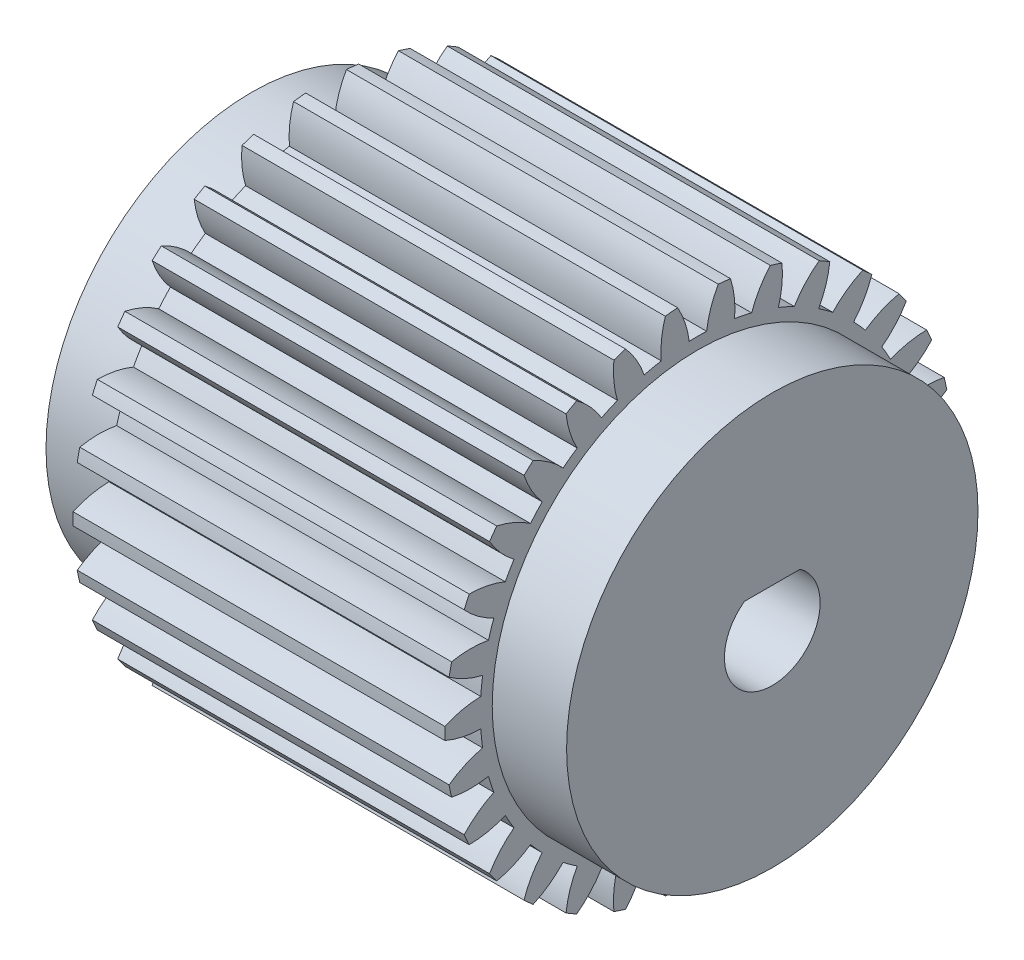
ISO-10303-21;
HEADER;
FILE_DESCRIPTION(('STEP AP214'),'2;1');
FILE_NAME('part.step','',(''),(''),'','','');
FILE_SCHEMA(('AUTOMOTIVE_DESIGN { 1 0 10303 214 1 1 1 1 }'));
ENDSEC;
DATA;
#1=APPLICATION_CONTEXT('core data for automotive mechanical design processes');
#2=APPLICATION_PROTOCOL_DEFINITION('international standard','automotive_design',2000,#1);
#3=PRODUCT_CONTEXT('',#1,'mechanical');
#4=PRODUCT('Part','Part','',(#3));
#5=PRODUCT_RELATED_PRODUCT_CATEGORY('part','',(#4));
#6=PRODUCT_DEFINITION_FORMATION('','',#4);
#7=PRODUCT_DEFINITION_CONTEXT('part definition',#1,'design');
#8=PRODUCT_DEFINITION('design','',#6,#7);
#9=PRODUCT_DEFINITION_SHAPE('','',#8);
#10=(LENGTH_UNIT() NAMED_UNIT(*) SI_UNIT(.MILLI.,.METRE.));
#11=(NAMED_UNIT(*) PLANE_ANGLE_UNIT() SI_UNIT($,.RADIAN.));
#12=(NAMED_UNIT(*) SI_UNIT($,.STERADIAN.) SOLID_ANGLE_UNIT());
#13=UNCERTAINTY_MEASURE_WITH_UNIT(LENGTH_MEASURE(1.E-05),#10,'distance_accuracy_value','');
#14=(GEOMETRIC_REPRESENTATION_CONTEXT(3) GLOBAL_UNCERTAINTY_ASSIGNED_CONTEXT((#13)) GLOBAL_UNIT_ASSIGNED_CONTEXT((#10,
#11,#12)) REPRESENTATION_CONTEXT('',''));
#15=CARTESIAN_POINT('',(0.,0.,0.));
#16=DIRECTION('',(0.,0.,1.));
#17=DIRECTION('',(1.,0.,0.));
#18=AXIS2_PLACEMENT_3D('',#15,#16,#17);
#19=CARTESIAN_POINT('',(-4.700011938,2.46155281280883,-1.7582328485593));
#20=DIRECTION('',(0.,1.,0.));
#21=DIRECTION('',(1.,0.,0.));
#22=AXIS2_PLACEMENT_3D('',#19,#20,#21);
#23=PLANE('',#22);
#24=DIRECTION('',(0.,0.,1.));
#25=VECTOR('',#24,1.);
#26=CARTESIAN_POINT('',(28.200011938,2.46155281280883,-1.7582328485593));
#27=LINE('',#26,#25);
#28=CARTESIAN_POINT('',(28.200011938,2.46155281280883,-1.7582328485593));
#29=VERTEX_POINT('',#28);
#30=CARTESIAN_POINT('',(28.200011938,2.46155281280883,1.7582328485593));
#31=VERTEX_POINT('',#30);
#32=EDGE_CURVE('E1074',#29,#31,#27,.T.);
#33=ORIENTED_EDGE('',*,*,#32,.T.);
#34=DIRECTION('',(1.,0.,0.));
#35=VECTOR('',#34,1.);
#36=CARTESIAN_POINT('',(-4.700011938,2.46155281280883,1.7582328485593));
#37=LINE('',#36,#35);
#38=CARTESIAN_POINT('',(-4.700011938,2.46155281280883,1.7582328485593));
#39=VERTEX_POINT('',#38);
#40=EDGE_CURVE('E11',#39,#31,#37,.T.);
#41=ORIENTED_EDGE('',*,*,#40,.F.);
#42=DIRECTION('',(0.,0.,1.));
#43=VECTOR('',#42,1.);
#44=CARTESIAN_POINT('',(-4.700011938,2.46155281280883,-1.7582328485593));
#45=LINE('',#44,#43);
#46=CARTESIAN_POINT('',(-4.700011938,2.46155281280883,-1.7582328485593));
#47=VERTEX_POINT('',#46);
#48=EDGE_CURVE('E1389',#47,#39,#45,.T.);
#49=ORIENTED_EDGE('',*,*,#48,.F.);
#50=DIRECTION('',(1.,0.,0.));
#51=VECTOR('',#50,1.);
#52=CARTESIAN_POINT('',(-4.700011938,2.46155281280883,-1.7582328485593));
#53=LINE('',#52,#51);
#54=EDGE_CURVE('E26',#47,#29,#53,.T.);
#55=ORIENTED_EDGE('',*,*,#54,.T.);
#56=EDGE_LOOP('',(#33,#41,#49,#55));
#57=FACE_BOUND('',#56,.T.);
#58=ADVANCED_FACE('F16',(#57),#23,.F.);
#59=CARTESIAN_POINT('',(-4.700011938,0.,0.));
#60=DIRECTION('',(1.,0.,0.));
#61=DIRECTION('',(0.,-1.,0.));
#62=AXIS2_PLACEMENT_3D('',#59,#60,#61);
#63=CYLINDRICAL_SURFACE('',#62,3.025);
#64=CARTESIAN_POINT('',(28.200011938,0.,0.));
#65=DIRECTION('',(1.,0.,0.));
#66=DIRECTION('',(0.,0.,-1.));
#67=AXIS2_PLACEMENT_3D('',#64,#65,#66);
#68=CIRCLE('',#67,3.025);
#69=EDGE_CURVE('E1393',#31,#29,#68,.T.);
#70=ORIENTED_EDGE('',*,*,#69,.T.);
#71=ORIENTED_EDGE('',*,*,#54,.F.);
#72=CARTESIAN_POINT('',(-4.700011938,0.,0.));
#73=DIRECTION('',(1.,0.,0.));
#74=DIRECTION('',(0.,0.,-1.));
#75=AXIS2_PLACEMENT_3D('',#72,#73,#74);
#76=CIRCLE('',#75,3.025);
#77=EDGE_CURVE('E1394',#39,#47,#76,.T.);
#78=ORIENTED_EDGE('',*,*,#77,.F.);
#79=ORIENTED_EDGE('',*,*,#40,.T.);
#80=EDGE_LOOP('',(#70,#71,#78,#79));
#81=FACE_BOUND('',#80,.T.);
#82=ADVANCED_FACE('F3516',(#81),#63,.F.);
#83=CARTESIAN_POINT('',(28.200011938,0.,0.));
#84=DIRECTION('',(1.,0.,0.));
#85=DIRECTION('',(0.,1.,0.));
#86=AXIS2_PLACEMENT_3D('',#83,#84,#85);
#87=PLANE('',#86);
#88=ORIENTED_EDGE('',*,*,#69,.F.);
#89=ORIENTED_EDGE('',*,*,#32,.F.);
#90=EDGE_LOOP('',(#88,#89));
#91=FACE_BOUND('',#90,.T.);
#92=CARTESIAN_POINT('',(28.200011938,0.,0.));
#93=DIRECTION('',(1.,0.,0.));
#94=DIRECTION('',(0.,0.,-1.));
#95=AXIS2_PLACEMENT_3D('',#92,#93,#94);
#96=CIRCLE('',#95,13.);
#97=CARTESIAN_POINT('',(28.200011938,0.,13.));
#98=VERTEX_POINT('',#97);
#99=EDGE_CURVE('E1094',#98,#98,#96,.T.);
#100=ORIENTED_EDGE('',*,*,#99,.T.);
#101=EDGE_LOOP('',(#100));
#102=FACE_BOUND('',#101,.T.);
#103=ADVANCED_FACE('F3519',(#91,#102),#87,.T.);
#104=CARTESIAN_POINT('',(-4.700011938,0.,0.));
#105=DIRECTION('',(-1.,0.,0.));
#106=DIRECTION('',(0.,0.,1.));
#107=AXIS2_PLACEMENT_3D('',#104,#105,#106);
#108=PLANE('',#107);
#109=ORIENTED_EDGE('',*,*,#77,.T.);
#110=ORIENTED_EDGE('',*,*,#48,.T.);
#111=EDGE_LOOP('',(#109,#110));
#112=FACE_BOUND('',#111,.T.);
#113=CARTESIAN_POINT('',(-4.700011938,0.,0.));
#114=DIRECTION('',(1.,0.,0.));
#115=DIRECTION('',(0.,0.,1.));
#116=AXIS2_PLACEMENT_3D('',#113,#114,#115);
#117=CIRCLE('',#116,13.);
#118=CARTESIAN_POINT('',(-4.700011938,0.,13.));
#119=VERTEX_POINT('',#118);
#120=EDGE_CURVE('E1705',#119,#119,#117,.T.);
#121=ORIENTED_EDGE('',*,*,#120,.F.);
#122=EDGE_LOOP('',(#121));
#123=FACE_BOUND('',#122,.T.);
#124=ADVANCED_FACE('F3522',(#112,#123),#108,.T.);
#125=CARTESIAN_POINT('',(-41.4695645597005,0.,0.));
#126=DIRECTION('',(1.,0.,0.));
#127=DIRECTION('',(0.,0.,-1.));
#128=AXIS2_PLACEMENT_3D('',#125,#126,#127);
#129=CYLINDRICAL_SURFACE('',#128,13.);
#130=CARTESIAN_POINT('',(0.,0.,0.));
#131=DIRECTION('',(1.,0.,0.));
#132=DIRECTION('',(0.,0.,-1.));
#133=AXIS2_PLACEMENT_3D('',#130,#131,#132);
#134=CIRCLE('',#133,13.);
#135=CARTESIAN_POINT('',(0.,0.,13.));
#136=VERTEX_POINT('',#135);
#137=EDGE_CURVE('E1381',#136,#136,#134,.T.);
#138=ORIENTED_EDGE('',*,*,#137,.F.);
#139=DIRECTION('',(-1.,0.,0.));
#140=VECTOR('',#139,1.);
#141=CARTESIAN_POINT('',(-41.4695645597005,0.,13.));
#142=LINE('',#141,#140);
#143=EDGE_CURVE('E1701',#136,#119,#142,.T.);
#144=ORIENTED_EDGE('',*,*,#143,.T.);
#145=ORIENTED_EDGE('',*,*,#120,.T.);
#146=ORIENTED_EDGE('',*,*,#143,.F.);
#147=EDGE_LOOP('',(#138,#144,#145,#146));
#148=FACE_BOUND('',#147,.T.);
#149=ADVANCED_FACE('F3525',(#148),#129,.T.);
#150=CARTESIAN_POINT('',(-41.4695645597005,0.,0.));
#151=DIRECTION('',(1.,0.,0.));
#152=DIRECTION('',(0.,0.,-1.));
#153=AXIS2_PLACEMENT_3D('',#150,#151,#152);
#154=CYLINDRICAL_SURFACE('',#153,13.);
#155=ORIENTED_EDGE('',*,*,#99,.F.);
#156=DIRECTION('',(-1.,0.,0.));
#157=VECTOR('',#156,1.);
#158=CARTESIAN_POINT('',(-41.4695645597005,0.,13.));
#159=LINE('',#158,#157);
#160=CARTESIAN_POINT('',(23.5,0.,13.));
#161=VERTEX_POINT('',#160);
#162=EDGE_CURVE('E1706',#98,#161,#159,.T.);
#163=ORIENTED_EDGE('',*,*,#162,.T.);
#164=CARTESIAN_POINT('',(23.5,0.,0.));
#165=DIRECTION('',(-1.,0.,0.));
#166=DIRECTION('',(0.,0.,1.));
#167=AXIS2_PLACEMENT_3D('',#164,#165,#166);
#168=CIRCLE('',#167,13.);
#169=EDGE_CURVE('E1275',#161,#161,#168,.T.);
#170=ORIENTED_EDGE('',*,*,#169,.F.);
#171=ORIENTED_EDGE('',*,*,#162,.F.);
#172=EDGE_LOOP('',(#155,#163,#170,#171));
#173=FACE_BOUND('',#172,.T.);
#174=ADVANCED_FACE('F3612',(#173),#154,.T.);
#175=CARTESIAN_POINT('',(23.5,0.,0.));
#176=DIRECTION('',(-1.,0.,0.));
#177=DIRECTION('',(0.,0.,1.));
#178=AXIS2_PLACEMENT_3D('',#175,#176,#177);
#179=CYLINDRICAL_SURFACE('',#178,13.7498);
#180=CARTESIAN_POINT('',(0.,0.,-3.1485231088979E-13));
#181=DIRECTION('',(-1.,0.,0.));
#182=DIRECTION('',(0.,0.,1.));
#183=AXIS2_PLACEMENT_3D('',#180,#181,#182);
#184=CIRCLE('',#183,13.7498000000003);
#185=CARTESIAN_POINT('',(0.,-1.98394746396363,13.6059160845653));
#186=VERTEX_POINT('',#185);
#187=CARTESIAN_POINT('',(0.,-0.888235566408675,13.7210800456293));
#188=VERTEX_POINT('',#187);
#189=EDGE_CURVE('E1377',#186,#188,#184,.T.);
#190=ORIENTED_EDGE('',*,*,#189,.F.);
#191=DIRECTION('',(-1.,0.,0.));
#192=VECTOR('',#191,1.);
#193=CARTESIAN_POINT('',(23.5,-1.98394746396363,13.6059160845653));
#194=LINE('',#193,#192);
#195=CARTESIAN_POINT('',(23.5,-1.98394746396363,13.6059160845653));
#196=VERTEX_POINT('',#195);
#197=EDGE_CURVE('E1091',#196,#186,#194,.T.);
#198=ORIENTED_EDGE('',*,*,#197,.F.);
#199=CARTESIAN_POINT('',(23.5,0.,-3.1485231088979E-13));
#200=DIRECTION('',(-1.,0.,0.));
#201=DIRECTION('',(0.,0.,1.));
#202=AXIS2_PLACEMENT_3D('',#199,#200,#201);
#203=CIRCLE('',#202,13.7498000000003);
#204=CARTESIAN_POINT('',(23.5,-0.888235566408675,13.7210800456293));
#205=VERTEX_POINT('',#204);
#206=EDGE_CURVE('E1470',#196,#205,#203,.T.);
#207=ORIENTED_EDGE('',*,*,#206,.T.);
#208=DIRECTION('',(-1.,0.,0.));
#209=VECTOR('',#208,1.);
#210=CARTESIAN_POINT('',(23.5,-0.888235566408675,13.7210800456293));
#211=LINE('',#210,#209);
#212=EDGE_CURVE('E1095',#205,#188,#211,.T.);
#213=ORIENTED_EDGE('',*,*,#212,.T.);
#214=EDGE_LOOP('',(#190,#198,#207,#213));
#215=FACE_BOUND('',#214,.T.);
#216=ADVANCED_FACE('F3608',(#215),#179,.T.);
#217=CARTESIAN_POINT('',(23.5,-7.82494077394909,12.2337655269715));
#218=DIRECTION('',(-1.,0.,0.));
#219=DIRECTION('',(0.,0.,1.));
#220=AXIS2_PLACEMENT_3D('',#217,#218,#219);
#221=CYLINDRICAL_SURFACE('',#220,6.);
#222=DIRECTION('',(1.,0.,0.));
#223=VECTOR('',#222,1.);
#224=CARTESIAN_POINT('',(23.5,-2.94625985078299,15.7263966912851));
#225=LINE('',#224,#223);
#226=CARTESIAN_POINT('',(0.,-2.94625985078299,15.7263966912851));
#227=VERTEX_POINT('',#226);
#228=CARTESIAN_POINT('',(23.5,-2.94625985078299,15.7263966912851));
#229=VERTEX_POINT('',#228);
#230=EDGE_CURVE('E1820',#227,#229,#225,.T.);
#231=ORIENTED_EDGE('',*,*,#230,.T.);
#232=CARTESIAN_POINT('',(23.5,-7.82494077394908,12.2337655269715));
#233=DIRECTION('',(-1.,0.,0.));
#234=DIRECTION('',(0.,-1.,0.));
#235=AXIS2_PLACEMENT_3D('',#232,#233,#234);
#236=CIRCLE('',#235,6.);
#237=EDGE_CURVE('E1105',#229,#196,#236,.T.);
#238=ORIENTED_EDGE('',*,*,#237,.T.);
#239=ORIENTED_EDGE('',*,*,#197,.T.);
#240=CARTESIAN_POINT('',(0.,-7.82494077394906,12.2337655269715));
#241=DIRECTION('',(1.,0.,0.));
#242=DIRECTION('',(0.,0.,-1.));
#243=AXIS2_PLACEMENT_3D('',#240,#241,#242);
#244=CIRCLE('',#243,6.);
#245=EDGE_CURVE('E1382',#186,#227,#244,.T.);
#246=ORIENTED_EDGE('',*,*,#245,.T.);
#247=EDGE_LOOP('',(#231,#238,#239,#246));
#248=FACE_BOUND('',#247,.T.);
#249=ADVANCED_FACE('F3611',(#248),#221,.T.);
#250=CARTESIAN_POINT('',(23.5,5.11040416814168,13.5933250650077));
#251=DIRECTION('',(-1.,0.,0.));
#252=DIRECTION('',(0.,0.,1.));
#253=AXIS2_PLACEMENT_3D('',#250,#251,#252);
#254=CYLINDRICAL_SURFACE('',#253,6.);
#255=DIRECTION('',(-1.,0.,0.));
#256=VECTOR('',#255,1.);
#257=CARTESIAN_POINT('',(23.5,-0.387824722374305,15.9952990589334));
#258=LINE('',#257,#256);
#259=CARTESIAN_POINT('',(23.5,-0.387824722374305,15.9952990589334));
#260=VERTEX_POINT('',#259);
#261=CARTESIAN_POINT('',(0.,-0.387824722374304,15.9952990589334));
#262=VERTEX_POINT('',#261);
#263=EDGE_CURVE('E1279',#260,#262,#258,.T.);
#264=ORIENTED_EDGE('',*,*,#263,.T.);
#265=CARTESIAN_POINT('',(0.,5.11040416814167,13.5933250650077));
#266=DIRECTION('',(-1.,0.,0.));
#267=DIRECTION('',(0.,0.,1.));
#268=AXIS2_PLACEMENT_3D('',#265,#266,#267);
#269=CIRCLE('',#268,6.);
#270=EDGE_CURVE('E1501',#188,#262,#269,.T.);
#271=ORIENTED_EDGE('',*,*,#270,.F.);
#272=ORIENTED_EDGE('',*,*,#212,.F.);
#273=CARTESIAN_POINT('',(23.5,5.11040416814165,13.5933250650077));
#274=DIRECTION('',(-1.,0.,0.));
#275=DIRECTION('',(0.,-1.,0.));
#276=AXIS2_PLACEMENT_3D('',#273,#274,#275);
#277=CIRCLE('',#276,6.);
#278=EDGE_CURVE('E1938',#205,#260,#277,.T.);
#279=ORIENTED_EDGE('',*,*,#278,.T.);
#280=EDGE_LOOP('',(#264,#271,#272,#279));
#281=FACE_BOUND('',#280,.T.);
#282=ADVANCED_FACE('F3604',(#281),#254,.T.);
#283=CARTESIAN_POINT('',(23.5,0.,0.));
#284=DIRECTION('',(-1.,0.,0.));
#285=DIRECTION('',(0.,0.,1.));
#286=AXIS2_PLACEMENT_3D('',#283,#284,#285);
#287=CYLINDRICAL_SURFACE('',#286,13.7498);
#288=CARTESIAN_POINT('',(0.,0.,-1.14925430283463E-12));
#289=DIRECTION('',(-1.,0.,0.));
#290=DIRECTION('',(0.,0.,1.));
#291=AXIS2_PLACEMENT_3D('',#288,#289,#290);
#292=CIRCLE('',#291,13.7498000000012);
#293=CARTESIAN_POINT('',(0.,0.888235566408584,13.7210800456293));
#294=VERTEX_POINT('',#293);
#295=CARTESIAN_POINT('',(0.,1.98394746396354,13.6059160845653));
#296=VERTEX_POINT('',#295);
#297=EDGE_CURVE('E1580',#294,#296,#292,.T.);
#298=ORIENTED_EDGE('',*,*,#297,.F.);
#299=DIRECTION('',(-1.,0.,0.));
#300=VECTOR('',#299,1.);
#301=CARTESIAN_POINT('',(23.5,0.888235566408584,13.7210800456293));
#302=LINE('',#301,#300);
#303=CARTESIAN_POINT('',(23.5,0.888235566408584,13.7210800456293));
#304=VERTEX_POINT('',#303);
#305=EDGE_CURVE('E1271',#304,#294,#302,.T.);
#306=ORIENTED_EDGE('',*,*,#305,.F.);
#307=CARTESIAN_POINT('',(23.5,0.,-1.14925430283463E-12));
#308=DIRECTION('',(-1.,0.,0.));
#309=DIRECTION('',(0.,0.,1.));
#310=AXIS2_PLACEMENT_3D('',#307,#308,#309);
#311=CIRCLE('',#310,13.7498000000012);
#312=CARTESIAN_POINT('',(23.5,1.98394746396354,13.6059160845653));
#313=VERTEX_POINT('',#312);
#314=EDGE_CURVE('E1065',#304,#313,#311,.T.);
#315=ORIENTED_EDGE('',*,*,#314,.T.);
#316=DIRECTION('',(-1.,0.,0.));
#317=VECTOR('',#316,1.);
#318=CARTESIAN_POINT('',(23.5,1.98394746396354,13.6059160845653));
#319=LINE('',#318,#317);
#320=EDGE_CURVE('E1274',#313,#296,#319,.T.);
#321=ORIENTED_EDGE('',*,*,#320,.T.);
#322=EDGE_LOOP('',(#298,#306,#315,#321));
#323=FACE_BOUND('',#322,.T.);
#324=ADVANCED_FACE('F3600',(#323),#287,.T.);
#325=CARTESIAN_POINT('',(23.5,-5.11040416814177,13.5933250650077));
#326=DIRECTION('',(-1.,0.,0.));
#327=DIRECTION('',(0.,0.,1.));
#328=AXIS2_PLACEMENT_3D('',#325,#326,#327);
#329=CYLINDRICAL_SURFACE('',#328,6.);
#330=DIRECTION('',(1.,0.,0.));
#331=VECTOR('',#330,1.);
#332=CARTESIAN_POINT('',(23.5,0.387824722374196,15.9952990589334));
#333=LINE('',#332,#331);
#334=CARTESIAN_POINT('',(0.,0.387824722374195,15.9952990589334));
#335=VERTEX_POINT('',#334);
#336=CARTESIAN_POINT('',(23.5,0.387824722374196,15.9952990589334));
#337=VERTEX_POINT('',#336);
#338=EDGE_CURVE('E1631',#335,#337,#333,.T.);
#339=ORIENTED_EDGE('',*,*,#338,.T.);
#340=CARTESIAN_POINT('',(23.5,-5.11040416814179,13.5933250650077));
#341=DIRECTION('',(-1.,0.,0.));
#342=DIRECTION('',(0.,0.,1.));
#343=AXIS2_PLACEMENT_3D('',#340,#341,#342);
#344=CIRCLE('',#343,6.);
#345=EDGE_CURVE('E1060',#337,#304,#344,.T.);
#346=ORIENTED_EDGE('',*,*,#345,.T.);
#347=ORIENTED_EDGE('',*,*,#305,.T.);
#348=CARTESIAN_POINT('',(0.,-5.11040416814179,13.5933250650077));
#349=DIRECTION('',(1.,0.,0.));
#350=DIRECTION('',(0.,0.,-1.));
#351=AXIS2_PLACEMENT_3D('',#348,#349,#350);
#352=CIRCLE('',#351,6.);
#353=EDGE_CURVE('E1585',#294,#335,#352,.T.);
#354=ORIENTED_EDGE('',*,*,#353,.T.);
#355=EDGE_LOOP('',(#339,#346,#347,#354));
#356=FACE_BOUND('',#355,.T.);
#357=ADVANCED_FACE('F3603',(#356),#329,.T.);
#358=CARTESIAN_POINT('',(23.5,7.82494077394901,12.2337655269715));
#359=DIRECTION('',(-1.,0.,0.));
#360=DIRECTION('',(0.,0.,1.));
#361=AXIS2_PLACEMENT_3D('',#358,#359,#360);
#362=CYLINDRICAL_SURFACE('',#361,6.);
#363=DIRECTION('',(-1.,0.,0.));
#364=VECTOR('',#363,1.);
#365=CARTESIAN_POINT('',(23.5,2.94625985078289,15.7263966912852));
#366=LINE('',#365,#364);
#367=CARTESIAN_POINT('',(23.5,2.94625985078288,15.7263966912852));
#368=VERTEX_POINT('',#367);
#369=CARTESIAN_POINT('',(0.,2.94625985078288,15.7263966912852));
#370=VERTEX_POINT('',#369);
#371=EDGE_CURVE('E1347',#368,#370,#366,.T.);
#372=ORIENTED_EDGE('',*,*,#371,.T.);
#373=CARTESIAN_POINT('',(0.,7.82494077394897,12.2337655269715));
#374=DIRECTION('',(-1.,0.,0.));
#375=DIRECTION('',(0.,0.,1.));
#376=AXIS2_PLACEMENT_3D('',#373,#374,#375);
#377=CIRCLE('',#376,6.);
#378=EDGE_CURVE('E1584',#296,#370,#377,.T.);
#379=ORIENTED_EDGE('',*,*,#378,.F.);
#380=ORIENTED_EDGE('',*,*,#320,.F.);
#381=CARTESIAN_POINT('',(23.5,7.82494077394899,12.2337655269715));
#382=DIRECTION('',(-1.,0.,0.));
#383=DIRECTION('',(0.,0.,1.));
#384=AXIS2_PLACEMENT_3D('',#381,#382,#383);
#385=CIRCLE('',#384,6.);
#386=EDGE_CURVE('E1688',#313,#368,#385,.T.);
#387=ORIENTED_EDGE('',*,*,#386,.T.);
#388=EDGE_LOOP('',(#372,#379,#380,#387));
#389=FACE_BOUND('',#388,.T.);
#390=ADVANCED_FACE('F3829',(#389),#362,.T.);
#391=CARTESIAN_POINT('',(23.5,0.,0.));
#392=DIRECTION('',(-1.,0.,0.));
#393=DIRECTION('',(0.,0.,1.));
#394=AXIS2_PLACEMENT_3D('',#391,#392,#393);
#395=CYLINDRICAL_SURFACE('',#394,13.7498);
#396=CARTESIAN_POINT('',(0.,-3.29597460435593E-13,-1.02088476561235E-12));
#397=DIRECTION('',(-1.,0.,0.));
#398=DIRECTION('',(0.,0.,1.));
#399=AXIS2_PLACEMENT_3D('',#396,#397,#398);
#400=CIRCLE('',#399,13.7498000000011);
#401=CARTESIAN_POINT('',(0.,3.7215984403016,13.2365669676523));
#402=VERTEX_POINT('',#401);
#403=CARTESIAN_POINT('',(0.,4.76942247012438,12.8961083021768));
#404=VERTEX_POINT('',#403);
#405=EDGE_CURVE('E1406',#402,#404,#400,.T.);
#406=ORIENTED_EDGE('',*,*,#405,.F.);
#407=DIRECTION('',(-1.,0.,0.));
#408=VECTOR('',#407,1.);
#409=CARTESIAN_POINT('',(23.5,3.7215984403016,13.2365669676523));
#410=LINE('',#409,#408);
#411=CARTESIAN_POINT('',(23.5,3.7215984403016,13.2365669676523));
#412=VERTEX_POINT('',#411);
#413=EDGE_CURVE('E1471',#412,#402,#410,.T.);
#414=ORIENTED_EDGE('',*,*,#413,.F.);
#415=CARTESIAN_POINT('',(23.5,-3.29597460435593E-13,-1.02088476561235E-12));
#416=DIRECTION('',(-1.,0.,0.));
#417=DIRECTION('',(0.,0.,1.));
#418=AXIS2_PLACEMENT_3D('',#415,#416,#417);
#419=CIRCLE('',#418,13.7498000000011);
#420=CARTESIAN_POINT('',(23.5,4.76942247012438,12.8961083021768));
#421=VERTEX_POINT('',#420);
#422=EDGE_CURVE('E1399',#412,#421,#419,.T.);
#423=ORIENTED_EDGE('',*,*,#422,.T.);
#424=DIRECTION('',(-1.,0.,0.));
#425=VECTOR('',#424,1.);
#426=CARTESIAN_POINT('',(23.5,4.76942247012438,12.8961083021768));
#427=LINE('',#426,#425);
#428=EDGE_CURVE('E1474',#421,#404,#427,.T.);
#429=ORIENTED_EDGE('',*,*,#428,.T.);
#430=EDGE_LOOP('',(#406,#414,#423,#429));
#431=FACE_BOUND('',#430,.T.);
#432=ADVANCED_FACE('F3832',(#431),#395,.T.);
#433=CARTESIAN_POINT('',(23.5,-2.17251837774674,14.3587910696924));
#434=DIRECTION('',(-1.,0.,0.));
#435=DIRECTION('',(0.,0.,1.));
#436=AXIS2_PLACEMENT_3D('',#433,#434,#435);
#437=CYLINDRICAL_SURFACE('',#436,6.);
#438=DIRECTION('',(1.,0.,0.));
#439=VECTOR('',#438,1.);
#440=CARTESIAN_POINT('',(23.5,3.70495949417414,15.5651301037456));
#441=LINE('',#440,#439);
#442=CARTESIAN_POINT('',(0.,3.70495949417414,15.5651301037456));
#443=VERTEX_POINT('',#442);
#444=CARTESIAN_POINT('',(23.5,3.70495949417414,15.5651301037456));
#445=VERTEX_POINT('',#444);
#446=EDGE_CURVE('E1351',#443,#445,#441,.T.);
#447=ORIENTED_EDGE('',*,*,#446,.T.);
#448=CARTESIAN_POINT('',(23.5,-2.17251837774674,14.3587910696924));
#449=DIRECTION('',(-1.,0.,0.));
#450=DIRECTION('',(0.,-1.,0.));
#451=AXIS2_PLACEMENT_3D('',#448,#449,#450);
#452=CIRCLE('',#451,6.);
#453=EDGE_CURVE('E2023',#445,#412,#452,.T.);
#454=ORIENTED_EDGE('',*,*,#453,.T.);
#455=ORIENTED_EDGE('',*,*,#413,.T.);
#456=CARTESIAN_POINT('',(0.,-2.17251837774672,14.3587910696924));
#457=DIRECTION('',(1.,0.,0.));
#458=DIRECTION('',(0.,0.,-1.));
#459=AXIS2_PLACEMENT_3D('',#456,#457,#458);
#460=CIRCLE('',#459,6.);
#461=EDGE_CURVE('E1411',#402,#443,#460,.T.);
#462=ORIENTED_EDGE('',*,*,#461,.T.);
#463=EDGE_LOOP('',(#447,#454,#455,#462));
#464=FACE_BOUND('',#463,.T.);
#465=ADVANCED_FACE('F3969',(#464),#437,.T.);
#466=CARTESIAN_POINT('',(23.5,10.197489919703,10.3395317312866));
#467=DIRECTION('',(-1.,0.,0.));
#468=DIRECTION('',(0.,0.,1.));
#469=AXIS2_PLACEMENT_3D('',#466,#467,#468);
#470=CYLINDRICAL_SURFACE('',#469,6.);
#471=DIRECTION('',(-1.,0.,0.));
#472=VECTOR('',#471,1.);
#473=CARTESIAN_POINT('',(23.5,6.15157873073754,14.7701753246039));
#474=LINE('',#473,#472);
#475=CARTESIAN_POINT('',(23.5,6.15157873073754,14.7701753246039));
#476=VERTEX_POINT('',#475);
#477=CARTESIAN_POINT('',(0.,6.15157873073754,14.7701753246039));
#478=VERTEX_POINT('',#477);
#479=EDGE_CURVE('E1874',#476,#478,#474,.T.);
#480=ORIENTED_EDGE('',*,*,#479,.T.);
#481=CARTESIAN_POINT('',(0.,10.197489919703,10.3395317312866));
#482=DIRECTION('',(-1.,0.,0.));
#483=DIRECTION('',(0.,0.,1.));
#484=AXIS2_PLACEMENT_3D('',#481,#482,#483);
#485=CIRCLE('',#484,6.);
#486=EDGE_CURVE('E1410',#404,#478,#485,.T.);
#487=ORIENTED_EDGE('',*,*,#486,.F.);
#488=ORIENTED_EDGE('',*,*,#428,.F.);
#489=CARTESIAN_POINT('',(23.5,10.197489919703,10.3395317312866));
#490=DIRECTION('',(-1.,0.,0.));
#491=DIRECTION('',(0.,-1.,0.));
#492=AXIS2_PLACEMENT_3D('',#489,#490,#491);
#493=CIRCLE('',#492,6.);
#494=EDGE_CURVE('E1395',#421,#476,#493,.T.);
#495=ORIENTED_EDGE('',*,*,#494,.T.);
#496=EDGE_LOOP('',(#480,#487,#488,#495));
#497=FACE_BOUND('',#496,.T.);
#498=ADVANCED_FACE('F3694',(#497),#470,.T.);
#499=CARTESIAN_POINT('',(23.5,0.,0.));
#500=DIRECTION('',(-1.,0.,0.));
#501=DIRECTION('',(0.,0.,1.));
#502=AXIS2_PLACEMENT_3D('',#499,#500,#501);
#503=CYLINDRICAL_SURFACE('',#502,13.7498);
#504=CARTESIAN_POINT('',(0.,-1.81712284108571E-13,-3.42607886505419E-13));
#505=DIRECTION('',(-1.,0.,0.));
#506=DIRECTION('',(0.,0.,1.));
#507=AXIS2_PLACEMENT_3D('',#504,#505,#506);
#508=CIRCLE('',#507,13.7498000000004);
#509=CARTESIAN_POINT('',(0.,6.39230960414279,12.1735523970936));
#510=VERTEX_POINT('',#509);
#511=CARTESIAN_POINT('',(0.,7.34645082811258,11.6226787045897));
#512=VERTEX_POINT('',#511);
#513=EDGE_CURVE('E1371',#510,#512,#508,.T.);
#514=ORIENTED_EDGE('',*,*,#513,.F.);
#515=DIRECTION('',(-1.,0.,0.));
#516=VECTOR('',#515,1.);
#517=CARTESIAN_POINT('',(23.5,6.39230960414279,12.1735523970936));
#518=LINE('',#517,#516);
#519=CARTESIAN_POINT('',(23.5,6.39230960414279,12.1735523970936));
#520=VERTEX_POINT('',#519);
#521=EDGE_CURVE('E1475',#520,#510,#518,.T.);
#522=ORIENTED_EDGE('',*,*,#521,.F.);
#523=CARTESIAN_POINT('',(23.5,-1.81712284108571E-13,-3.42607886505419E-13));
#524=DIRECTION('',(-1.,0.,0.));
#525=DIRECTION('',(0.,0.,1.));
#526=AXIS2_PLACEMENT_3D('',#523,#524,#525);
#527=CIRCLE('',#526,13.7498000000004);
#528=CARTESIAN_POINT('',(23.5,7.34645082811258,11.6226787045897));
#529=VERTEX_POINT('',#528);
#530=EDGE_CURVE('E1578',#520,#529,#527,.T.);
#531=ORIENTED_EDGE('',*,*,#530,.T.);
#532=DIRECTION('',(-1.,0.,0.));
#533=VECTOR('',#532,1.);
#534=CARTESIAN_POINT('',(23.5,7.34645082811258,11.6226787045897));
#535=LINE('',#534,#533);
#536=EDGE_CURVE('E1078',#529,#512,#535,.T.);
#537=ORIENTED_EDGE('',*,*,#536,.T.);
#538=EDGE_LOOP('',(#514,#522,#531,#537));
#539=FACE_BOUND('',#538,.T.);
#540=ADVANCED_FACE('F3692',(#539),#503,.T.);
#541=CARTESIAN_POINT('',(23.5,0.860316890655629,14.4967090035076));
#542=DIRECTION('',(-1.,0.,0.));
#543=DIRECTION('',(0.,0.,1.));
#544=AXIS2_PLACEMENT_3D('',#541,#542,#543);
#545=CYLINDRICAL_SURFACE('',#544,6.);
#546=DIRECTION('',(1.,0.,0.));
#547=VECTOR('',#546,1.);
#548=CARTESIAN_POINT('',(23.5,6.86016975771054,14.4546902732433));
#549=LINE('',#548,#547);
#550=CARTESIAN_POINT('',(0.,6.86016975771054,14.4546902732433));
#551=VERTEX_POINT('',#550);
#552=CARTESIAN_POINT('',(23.5,6.86016975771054,14.4546902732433));
#553=VERTEX_POINT('',#552);
#554=EDGE_CURVE('E1878',#551,#553,#549,.T.);
#555=ORIENTED_EDGE('',*,*,#554,.T.);
#556=CARTESIAN_POINT('',(23.5,0.860316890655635,14.4967090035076));
#557=DIRECTION('',(-1.,0.,0.));
#558=DIRECTION('',(0.,-1.,0.));
#559=AXIS2_PLACEMENT_3D('',#556,#557,#558);
#560=CIRCLE('',#559,6.);
#561=EDGE_CURVE('E2041',#553,#520,#560,.T.);
#562=ORIENTED_EDGE('',*,*,#561,.T.);
#563=ORIENTED_EDGE('',*,*,#521,.T.);
#564=CARTESIAN_POINT('',(0.,0.860316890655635,14.4967090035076));
#565=DIRECTION('',(1.,0.,0.));
#566=DIRECTION('',(0.,0.,-1.));
#567=AXIS2_PLACEMENT_3D('',#564,#565,#566);
#568=CIRCLE('',#567,6.);
#569=EDGE_CURVE('E1376',#510,#551,#568,.T.);
#570=ORIENTED_EDGE('',*,*,#569,.T.);
#571=EDGE_LOOP('',(#555,#562,#563,#570));
#572=FACE_BOUND('',#571,.T.);
#573=ADVANCED_FACE('F3652',(#572),#545,.T.);
#574=CARTESIAN_POINT('',(23.5,12.1243598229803,7.99341078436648));
#575=DIRECTION('',(-1.,0.,0.));
#576=DIRECTION('',(0.,0.,1.));
#577=AXIS2_PLACEMENT_3D('',#574,#575,#576);
#578=CYLINDRICAL_SURFACE('',#577,6.);
#579=DIRECTION('',(-1.,0.,0.));
#580=VECTOR('',#579,1.);
#581=CARTESIAN_POINT('',(23.5,9.08804410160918,13.1684264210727));
#582=LINE('',#581,#580);
#583=CARTESIAN_POINT('',(23.5,9.08804410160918,13.1684264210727));
#584=VERTEX_POINT('',#583);
#585=CARTESIAN_POINT('',(0.,9.08804410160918,13.1684264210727));
#586=VERTEX_POINT('',#585);
#587=EDGE_CURVE('E2047',#584,#586,#582,.T.);
#588=ORIENTED_EDGE('',*,*,#587,.T.);
#589=CARTESIAN_POINT('',(0.,12.1243598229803,7.9934107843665));
#590=DIRECTION('',(-1.,0.,0.));
#591=DIRECTION('',(0.,0.,1.));
#592=AXIS2_PLACEMENT_3D('',#589,#590,#591);
#593=CIRCLE('',#592,6.);
#594=EDGE_CURVE('E1375',#512,#586,#593,.T.);
#595=ORIENTED_EDGE('',*,*,#594,.F.);
#596=ORIENTED_EDGE('',*,*,#536,.F.);
#597=CARTESIAN_POINT('',(23.5,12.1243598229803,7.99341078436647));
#598=DIRECTION('',(-1.,0.,0.));
#599=DIRECTION('',(0.,0.,1.));
#600=AXIS2_PLACEMENT_3D('',#597,#598,#599);
#601=CIRCLE('',#600,6.);
#602=EDGE_CURVE('E1574',#529,#584,#601,.T.);
#603=ORIENTED_EDGE('',*,*,#602,.T.);
#604=EDGE_LOOP('',(#588,#595,#596,#603));
#605=FACE_BOUND('',#604,.T.);
#606=ADVANCED_FACE('F3648',(#605),#578,.T.);
#607=CARTESIAN_POINT('',(23.5,0.,0.));
#608=DIRECTION('',(-1.,0.,0.));
#609=DIRECTION('',(0.,0.,1.));
#610=AXIS2_PLACEMENT_3D('',#607,#608,#609);
#611=CYLINDRICAL_SURFACE('',#610,13.7498);
#612=CARTESIAN_POINT('',(0.,-2.0868723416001E-12,-9.66240976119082E-13));
#613=DIRECTION('',(-1.,0.,0.));
#614=DIRECTION('',(0.,0.,1.));
#615=AXIS2_PLACEMENT_3D('',#612,#613,#614);
#616=CIRCLE('',#615,13.7498000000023);
#617=CARTESIAN_POINT('',(0.,12.326921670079,6.09130545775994));
#618=VERTEX_POINT('',#617);
#619=CARTESIAN_POINT('',(0.,12.7750427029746,5.08480913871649));
#620=VERTEX_POINT('',#619);
#621=EDGE_CURVE('E1343',#618,#620,#616,.T.);
#622=ORIENTED_EDGE('',*,*,#621,.F.);
#623=DIRECTION('',(-1.,0.,0.));
#624=VECTOR('',#623,1.);
#625=CARTESIAN_POINT('',(23.5,12.326921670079,6.09130545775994));
#626=LINE('',#625,#624);
#627=CARTESIAN_POINT('',(23.5,12.326921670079,6.09130545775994));
#628=VERTEX_POINT('',#627);
#629=EDGE_CURVE('E1075',#628,#618,#626,.T.);
#630=ORIENTED_EDGE('',*,*,#629,.F.);
#631=CARTESIAN_POINT('',(23.5,-2.0868723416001E-12,-9.66240976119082E-13));
#632=DIRECTION('',(-1.,0.,0.));
#633=DIRECTION('',(0.,0.,1.));
#634=AXIS2_PLACEMENT_3D('',#631,#632,#633);
#635=CIRCLE('',#634,13.7498000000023);
#636=CARTESIAN_POINT('',(23.5,12.7750427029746,5.08480913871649));
#637=VERTEX_POINT('',#636);
#638=EDGE_CURVE('E2063',#628,#637,#635,.T.);
#639=ORIENTED_EDGE('',*,*,#638,.T.);
#640=DIRECTION('',(-1.,0.,0.));
#641=VECTOR('',#640,1.);
#642=CARTESIAN_POINT('',(23.5,12.7750427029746,5.08480913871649));
#643=LINE('',#642,#641);
#644=EDGE_CURVE('E1079',#637,#620,#643,.T.);
#645=ORIENTED_EDGE('',*,*,#644,.T.);
#646=EDGE_LOOP('',(#622,#630,#639,#645));
#647=FACE_BOUND('',#646,.T.);
#648=ADVANCED_FACE('F3651',(#647),#611,.T.);
#649=CARTESIAN_POINT('',(23.5,9.21696274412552,11.2224023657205));
#650=DIRECTION('',(-1.,0.,0.));
#651=DIRECTION('',(0.,0.,1.));
#652=AXIS2_PLACEMENT_3D('',#649,#650,#651);
#653=CYLINDRICAL_SURFACE('',#652,6.);
#654=DIRECTION('',(1.,0.,0.));
#655=VECTOR('',#654,1.);
#656=CARTESIAN_POINT('',(23.5,14.0462476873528,7.66178346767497));
#657=LINE('',#656,#655);
#658=CARTESIAN_POINT('',(0.,14.0462476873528,7.66178346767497));
#659=VERTEX_POINT('',#658);
#660=CARTESIAN_POINT('',(23.5,14.0462476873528,7.66178346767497));
#661=VERTEX_POINT('',#660);
#662=EDGE_CURVE('E1041',#659,#661,#657,.T.);
#663=ORIENTED_EDGE('',*,*,#662,.T.);
#664=CARTESIAN_POINT('',(23.5,9.21696274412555,11.2224023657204));
#665=DIRECTION('',(-1.,0.,0.));
#666=DIRECTION('',(0.,0.,1.));
#667=AXIS2_PLACEMENT_3D('',#664,#665,#666);
#668=CIRCLE('',#667,6.);
#669=EDGE_CURVE('E1931',#661,#628,#668,.T.);
#670=ORIENTED_EDGE('',*,*,#669,.T.);
#671=ORIENTED_EDGE('',*,*,#629,.T.);
#672=CARTESIAN_POINT('',(0.,9.21696274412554,11.2224023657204));
#673=DIRECTION('',(1.,0.,0.));
#674=DIRECTION('',(0.,0.,-1.));
#675=AXIS2_PLACEMENT_3D('',#672,#673,#674);
#676=CIRCLE('',#675,6.);
#677=EDGE_CURVE('E1346',#618,#659,#676,.T.);
#678=ORIENTED_EDGE('',*,*,#677,.T.);
#679=EDGE_LOOP('',(#663,#670,#671,#678));
#680=FACE_BOUND('',#679,.T.);
#681=ADVANCED_FACE('F3677',(#680),#653,.T.);
#682=CARTESIAN_POINT('',(23.5,14.5072221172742,-0.659714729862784));
#683=DIRECTION('',(-1.,0.,0.));
#684=DIRECTION('',(0.,0.,1.));
#685=AXIS2_PLACEMENT_3D('',#682,#683,#684);
#686=CYLINDRICAL_SURFACE('',#685,6.);
#687=DIRECTION('',(-1.,0.,0.));
#688=VECTOR('',#687,1.);
#689=CARTESIAN_POINT('',(23.5,15.0925889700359,5.31166246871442));
#690=LINE('',#689,#688);
#691=CARTESIAN_POINT('',(23.5,15.0925889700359,5.31166246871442));
#692=VERTEX_POINT('',#691);
#693=CARTESIAN_POINT('',(0.,15.0925889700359,5.31166246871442));
#694=VERTEX_POINT('',#693);
#695=EDGE_CURVE('E1048',#692,#694,#690,.T.);
#696=ORIENTED_EDGE('',*,*,#695,.T.);
#697=CARTESIAN_POINT('',(0.,14.5072221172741,-0.659714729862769));
#698=DIRECTION('',(-1.,0.,0.));
#699=DIRECTION('',(0.,0.,1.));
#700=AXIS2_PLACEMENT_3D('',#697,#698,#699);
#701=CIRCLE('',#700,6.);
#702=EDGE_CURVE('E1031',#620,#694,#701,.T.);
#703=ORIENTED_EDGE('',*,*,#702,.F.);
#704=ORIENTED_EDGE('',*,*,#644,.F.);
#705=CARTESIAN_POINT('',(23.5,14.5072221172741,-0.659714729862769));
#706=DIRECTION('',(-1.,0.,0.));
#707=DIRECTION('',(0.,0.,1.));
#708=AXIS2_PLACEMENT_3D('',#705,#706,#707);
#709=CIRCLE('',#708,6.);
#710=EDGE_CURVE('E1442',#637,#692,#709,.T.);
#711=ORIENTED_EDGE('',*,*,#710,.T.);
#712=EDGE_LOOP('',(#696,#703,#704,#711));
#713=FACE_BOUND('',#712,.T.);
#714=ADVANCED_FACE('F3660',(#713),#686,.T.);
#715=CARTESIAN_POINT('',(23.5,0.,0.));
#716=DIRECTION('',(-1.,0.,0.));
#717=DIRECTION('',(0.,0.,1.));
#718=AXIS2_PLACEMENT_3D('',#715,#716,#717);
#719=CYLINDRICAL_SURFACE('',#718,13.7498);
#720=CARTESIAN_POINT('',(0.,-8.70831184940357E-13,-9.84455572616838E-13));
#721=DIRECTION('',(-1.,0.,0.));
#722=DIRECTION('',(0.,0.,1.));
#723=AXIS2_PLACEMENT_3D('',#720,#721,#722);
#724=CIRCLE('',#723,13.7498000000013);
#725=CARTESIAN_POINT('',(0.,8.78364616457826,10.5784951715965));
#726=VERTEX_POINT('',#725);
#727=CARTESIAN_POINT('',(0.,9.60240403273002,9.84128227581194));
#728=VERTEX_POINT('',#727);
#729=EDGE_CURVE('E2298',#726,#728,#724,.T.);
#730=ORIENTED_EDGE('',*,*,#729,.F.);
#731=DIRECTION('',(-1.,0.,0.));
#732=VECTOR('',#731,1.);
#733=CARTESIAN_POINT('',(23.5,8.78364616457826,10.5784951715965));
#734=LINE('',#733,#732);
#735=CARTESIAN_POINT('',(23.5,8.78364616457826,10.5784951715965));
#736=VERTEX_POINT('',#735);
#737=EDGE_CURVE('E1917',#736,#726,#734,.T.);
#738=ORIENTED_EDGE('',*,*,#737,.F.);
#739=CARTESIAN_POINT('',(23.5,-8.70831184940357E-13,-9.84455572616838E-13));
#740=DIRECTION('',(-1.,0.,0.));
#741=DIRECTION('',(0.,0.,1.));
#742=AXIS2_PLACEMENT_3D('',#739,#740,#741);
#743=CIRCLE('',#742,13.7498000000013);
#744=CARTESIAN_POINT('',(23.5,9.60240403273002,9.84128227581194));
#745=VERTEX_POINT('',#744);
#746=EDGE_CURVE('E2051',#736,#745,#743,.T.);
#747=ORIENTED_EDGE('',*,*,#746,.T.);
#748=DIRECTION('',(-1.,0.,0.));
#749=VECTOR('',#748,1.);
#750=CARTESIAN_POINT('',(23.5,9.60240403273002,9.84128227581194));
#751=LINE('',#750,#749);
#752=EDGE_CURVE('E1920',#745,#728,#751,.T.);
#753=ORIENTED_EDGE('',*,*,#752,.T.);
#754=EDGE_LOOP('',(#730,#738,#747,#753));
#755=FACE_BOUND('',#754,.T.);
#756=ADVANCED_FACE('F3580',(#755),#719,.T.);
#757=CARTESIAN_POINT('',(23.5,3.85555218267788,14.0010511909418));
#758=DIRECTION('',(-1.,0.,0.));
#759=DIRECTION('',(0.,0.,1.));
#760=AXIS2_PLACEMENT_3D('',#757,#758,#759);
#761=CYLINDRICAL_SURFACE('',#760,6.);
#762=DIRECTION('',(1.,0.,0.));
#763=VECTOR('',#762,1.);
#764=CARTESIAN_POINT('',(23.5,9.71555768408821,12.7125111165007));
#765=LINE('',#764,#763);
#766=CARTESIAN_POINT('',(0.,9.71555768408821,12.7125111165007));
#767=VERTEX_POINT('',#766);
#768=CARTESIAN_POINT('',(23.5,9.71555768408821,12.7125111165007));
#769=VERTEX_POINT('',#768);
#770=EDGE_CURVE('E2118',#767,#769,#765,.T.);
#771=ORIENTED_EDGE('',*,*,#770,.T.);
#772=CARTESIAN_POINT('',(23.5,3.8555521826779,14.0010511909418));
#773=DIRECTION('',(-1.,0.,0.));
#774=DIRECTION('',(0.,-1.,0.));
#775=AXIS2_PLACEMENT_3D('',#772,#773,#774);
#776=CIRCLE('',#775,6.);
#777=EDGE_CURVE('E2068',#769,#736,#776,.T.);
#778=ORIENTED_EDGE('',*,*,#777,.T.);
#779=ORIENTED_EDGE('',*,*,#737,.T.);
#780=CARTESIAN_POINT('',(0.,3.85555218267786,14.0010511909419));
#781=DIRECTION('',(1.,0.,0.));
#782=DIRECTION('',(0.,0.,-1.));
#783=AXIS2_PLACEMENT_3D('',#780,#781,#782);
#784=CIRCLE('',#783,6.);
#785=EDGE_CURVE('E2054',#726,#767,#784,.T.);
#786=ORIENTED_EDGE('',*,*,#785,.T.);
#787=EDGE_LOOP('',(#771,#778,#779,#786));
#788=FACE_BOUND('',#787,.T.);
#789=ADVANCED_FACE('F3576',(#788),#761,.T.);
#790=CARTESIAN_POINT('',(23.5,13.5213370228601,5.29793942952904));
#791=DIRECTION('',(-1.,0.,0.));
#792=DIRECTION('',(0.,0.,1.));
#793=AXIS2_PLACEMENT_3D('',#790,#791,#792);
#794=CYLINDRICAL_SURFACE('',#793,6.);
#795=DIRECTION('',(-1.,0.,0.));
#796=VECTOR('',#795,1.);
#797=CARTESIAN_POINT('',(23.5,11.6273183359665,10.99115409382));
#798=LINE('',#797,#796);
#799=CARTESIAN_POINT('',(23.5,11.6273183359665,10.99115409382));
#800=VERTEX_POINT('',#799);
#801=CARTESIAN_POINT('',(0.,11.6273183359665,10.99115409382));
#802=VERTEX_POINT('',#801);
#803=EDGE_CURVE('E1621',#800,#802,#798,.T.);
#804=ORIENTED_EDGE('',*,*,#803,.T.);
#805=CARTESIAN_POINT('',(0.,13.5213370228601,5.29793942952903));
#806=DIRECTION('',(-1.,0.,0.));
#807=DIRECTION('',(0.,0.,1.));
#808=AXIS2_PLACEMENT_3D('',#805,#806,#807);
#809=CIRCLE('',#808,6.);
#810=EDGE_CURVE('E2089',#728,#802,#809,.T.);
#811=ORIENTED_EDGE('',*,*,#810,.F.);
#812=ORIENTED_EDGE('',*,*,#752,.F.);
#813=CARTESIAN_POINT('',(23.5,13.5213370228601,5.29793942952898));
#814=DIRECTION('',(-1.,0.,0.));
#815=DIRECTION('',(0.,0.,1.));
#816=AXIS2_PLACEMENT_3D('',#813,#814,#815);
#817=CIRCLE('',#816,6.);
#818=EDGE_CURVE('E1519',#745,#800,#817,.T.);
#819=ORIENTED_EDGE('',*,*,#818,.T.);
#820=EDGE_LOOP('',(#804,#811,#812,#819));
#821=FACE_BOUND('',#820,.T.);
#822=ADVANCED_FACE('F3579',(#821),#794,.T.);
#823=CARTESIAN_POINT('',(23.5,0.,0.));
#824=DIRECTION('',(-1.,0.,0.));
#825=DIRECTION('',(0.,0.,1.));
#826=AXIS2_PLACEMENT_3D('',#823,#824,#825);
#827=CYLINDRICAL_SURFACE('',#826,13.7498);
#828=CARTESIAN_POINT('',(0.,-2.15973072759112E-13,-1.43548367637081E-13));
#829=DIRECTION('',(-1.,0.,0.));
#830=DIRECTION('',(0.,0.,1.));
#831=AXIS2_PLACEMENT_3D('',#828,#829,#830);
#832=CIRCLE('',#831,13.7498000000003);
#833=CARTESIAN_POINT('',(0.,10.791095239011,8.52110694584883));
#834=VERTEX_POINT('',#833);
#835=CARTESIAN_POINT('',(0.,11.4386861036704,7.6297745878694));
#836=VERTEX_POINT('',#835);
#837=EDGE_CURVE('E2088',#834,#836,#832,.T.);
#838=ORIENTED_EDGE('',*,*,#837,.F.);
#839=DIRECTION('',(-1.,0.,0.));
#840=VECTOR('',#839,1.);
#841=CARTESIAN_POINT('',(23.5,10.791095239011,8.52110694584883));
#842=LINE('',#841,#840);
#843=CARTESIAN_POINT('',(23.5,10.791095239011,8.52110694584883));
#844=VERTEX_POINT('',#843);
#845=EDGE_CURVE('E1807',#844,#834,#842,.T.);
#846=ORIENTED_EDGE('',*,*,#845,.F.);
#847=CARTESIAN_POINT('',(23.5,-2.15973072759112E-13,-1.43548367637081E-13));
#848=DIRECTION('',(-1.,0.,0.));
#849=DIRECTION('',(0.,0.,1.));
#850=AXIS2_PLACEMENT_3D('',#847,#848,#849);
#851=CIRCLE('',#850,13.7498000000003);
#852=CARTESIAN_POINT('',(23.5,11.4386861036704,7.6297745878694));
#853=VERTEX_POINT('',#852);
#854=EDGE_CURVE('E1510',#844,#853,#851,.T.);
#855=ORIENTED_EDGE('',*,*,#854,.T.);
#856=DIRECTION('',(-1.,0.,0.));
#857=VECTOR('',#856,1.);
#858=CARTESIAN_POINT('',(23.5,11.4386861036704,7.6297745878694));
#859=LINE('',#858,#857);
#860=EDGE_CURVE('E1162',#853,#836,#859,.T.);
#861=ORIENTED_EDGE('',*,*,#860,.T.);
#862=EDGE_LOOP('',(#838,#846,#855,#861));
#863=FACE_BOUND('',#862,.T.);
#864=ADVANCED_FACE('F3696',(#863),#827,.T.);
#865=CARTESIAN_POINT('',(23.5,6.68228134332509,12.8934802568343));
#866=DIRECTION('',(-1.,0.,0.));
#867=DIRECTION('',(0.,0.,1.));
#868=AXIS2_PLACEMENT_3D('',#865,#866,#867);
#869=CYLINDRICAL_SURFACE('',#868,6.);
#870=DIRECTION('',(1.,0.,0.));
#871=VECTOR('',#870,1.);
#872=CARTESIAN_POINT('',(23.5,12.146329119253,10.4147342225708));
#873=LINE('',#872,#871);
#874=CARTESIAN_POINT('',(0.,12.146329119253,10.4147342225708));
#875=VERTEX_POINT('',#874);
#876=CARTESIAN_POINT('',(23.5,12.146329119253,10.4147342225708));
#877=VERTEX_POINT('',#876);
#878=EDGE_CURVE('E1071',#875,#877,#873,.T.);
#879=ORIENTED_EDGE('',*,*,#878,.T.);
#880=CARTESIAN_POINT('',(23.5,6.68228134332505,12.8934802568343));
#881=DIRECTION('',(-1.,0.,0.));
#882=DIRECTION('',(0.,-1.,0.));
#883=AXIS2_PLACEMENT_3D('',#880,#881,#882);
#884=CIRCLE('',#883,6.);
#885=EDGE_CURVE('E1506',#877,#844,#884,.T.);
#886=ORIENTED_EDGE('',*,*,#885,.T.);
#887=ORIENTED_EDGE('',*,*,#845,.T.);
#888=CARTESIAN_POINT('',(0.,6.68228134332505,12.8934802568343));
#889=DIRECTION('',(1.,0.,0.));
#890=DIRECTION('',(0.,0.,-1.));
#891=AXIS2_PLACEMENT_3D('',#888,#889,#890);
#892=CIRCLE('',#891,6.);
#893=EDGE_CURVE('E2085',#834,#875,#892,.T.);
#894=ORIENTED_EDGE('',*,*,#893,.T.);
#895=EDGE_LOOP('',(#879,#886,#887,#894));
#896=FACE_BOUND('',#895,.T.);
#897=ADVANCED_FACE('F3698',(#896),#869,.T.);
#898=CARTESIAN_POINT('',(23.5,14.3273669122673,2.37092269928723));
#899=DIRECTION('',(-1.,0.,0.));
#900=DIRECTION('',(0.,0.,1.));
#901=AXIS2_PLACEMENT_3D('',#898,#899,#900);
#902=CYLINDRICAL_SURFACE('',#901,6.);
#903=DIRECTION('',(-1.,0.,0.));
#904=VECTOR('',#903,1.);
#905=CARTESIAN_POINT('',(23.5,13.6584229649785,8.33351559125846));
#906=LINE('',#905,#904);
#907=CARTESIAN_POINT('',(23.5,13.6584229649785,8.33351559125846));
#908=VERTEX_POINT('',#907);
#909=CARTESIAN_POINT('',(0.,13.6584229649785,8.33351559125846));
#910=VERTEX_POINT('',#909);
#911=EDGE_CURVE('E1625',#908,#910,#906,.T.);
#912=ORIENTED_EDGE('',*,*,#911,.T.);
#913=CARTESIAN_POINT('',(0.,14.3273669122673,2.37092269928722));
#914=DIRECTION('',(-1.,0.,0.));
#915=DIRECTION('',(0.,0.,1.));
#916=AXIS2_PLACEMENT_3D('',#913,#914,#915);
#917=CIRCLE('',#916,6.);
#918=EDGE_CURVE('E2037',#836,#910,#917,.T.);
#919=ORIENTED_EDGE('',*,*,#918,.F.);
#920=ORIENTED_EDGE('',*,*,#860,.F.);
#921=CARTESIAN_POINT('',(23.5,14.3273669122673,2.37092269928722));
#922=DIRECTION('',(-1.,0.,0.));
#923=DIRECTION('',(0.,0.,1.));
#924=AXIS2_PLACEMENT_3D('',#921,#922,#923);
#925=CIRCLE('',#924,6.);
#926=EDGE_CURVE('E1522',#853,#908,#925,.T.);
#927=ORIENTED_EDGE('',*,*,#926,.T.);
#928=EDGE_LOOP('',(#912,#919,#920,#927));
#929=FACE_BOUND('',#928,.T.);
#930=ADVANCED_FACE('F3703',(#929),#902,.T.);
#931=CARTESIAN_POINT('',(23.5,0.,0.));
#932=DIRECTION('',(-1.,0.,0.));
#933=DIRECTION('',(0.,0.,1.));
#934=AXIS2_PLACEMENT_3D('',#931,#932,#933);
#935=CYLINDRICAL_SURFACE('',#934,13.7498);
#936=CARTESIAN_POINT('',(0.,2.38524477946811E-13,0.));
#937=DIRECTION('',(-1.,0.,0.));
#938=DIRECTION('',(0.,0.,1.));
#939=AXIS2_PLACEMENT_3D('',#936,#937,#938);
#940=CIRCLE('',#939,13.7498000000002);
#941=CARTESIAN_POINT('',(0.,-13.7387604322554,-0.550873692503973));
#942=VERTEX_POINT('',#941);
#943=CARTESIAN_POINT('',(0.,-13.7387604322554,0.550873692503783));
#944=VERTEX_POINT('',#943);
#945=EDGE_CURVE('E1216',#942,#944,#940,.T.);
#946=ORIENTED_EDGE('',*,*,#945,.F.);
#947=DIRECTION('',(-1.,0.,0.));
#948=VECTOR('',#947,1.);
#949=CARTESIAN_POINT('',(23.5,-13.7387604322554,-0.550873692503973));
#950=LINE('',#949,#948);
#951=CARTESIAN_POINT('',(23.5,-13.7387604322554,-0.550873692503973));
#952=VERTEX_POINT('',#951);
#953=EDGE_CURVE('E1159',#952,#942,#950,.T.);
#954=ORIENTED_EDGE('',*,*,#953,.F.);
#955=CARTESIAN_POINT('',(23.5,2.38524477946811E-13,0.));
#956=DIRECTION('',(-1.,0.,0.));
#957=DIRECTION('',(0.,0.,1.));
#958=AXIS2_PLACEMENT_3D('',#955,#956,#957);
#959=CIRCLE('',#958,13.7498000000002);
#960=CARTESIAN_POINT('',(23.5,-13.7387604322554,0.550873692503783));
#961=VERTEX_POINT('',#960);
#962=EDGE_CURVE('E1487',#952,#961,#959,.T.);
#963=ORIENTED_EDGE('',*,*,#962,.T.);
#964=DIRECTION('',(-1.,0.,0.));
#965=VECTOR('',#964,1.);
#966=CARTESIAN_POINT('',(23.5,-13.7387604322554,0.550873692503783));
#967=LINE('',#966,#965);
#968=EDGE_CURVE('E1148',#961,#944,#967,.T.);
#969=ORIENTED_EDGE('',*,*,#968,.T.);
#970=EDGE_LOOP('',(#946,#954,#963,#969));
#971=FACE_BOUND('',#970,.T.);
#972=ADVANCED_FACE('F3852',(#971),#935,.T.);
#973=CARTESIAN_POINT('',(23.5,-12.984676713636,-6.50329821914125));
#974=DIRECTION('',(-1.,0.,0.));
#975=DIRECTION('',(0.,0.,1.));
#976=AXIS2_PLACEMENT_3D('',#973,#974,#975);
#977=CYLINDRICAL_SURFACE('',#976,6.);
#978=DIRECTION('',(1.,0.,0.));
#979=VECTOR('',#978,1.);
#980=CARTESIAN_POINT('',(23.5,-15.9482138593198,-1.28626385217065));
#981=LINE('',#980,#979);
#982=CARTESIAN_POINT('',(0.,-15.9482138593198,-1.28626385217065));
#983=VERTEX_POINT('',#982);
#984=CARTESIAN_POINT('',(23.5,-15.9482138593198,-1.28626385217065));
#985=VERTEX_POINT('',#984);
#986=EDGE_CURVE('E1639',#983,#985,#981,.T.);
#987=ORIENTED_EDGE('',*,*,#986,.T.);
#988=CARTESIAN_POINT('',(23.5,-12.984676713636,-6.50329821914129));
#989=DIRECTION('',(-1.,0.,0.));
#990=DIRECTION('',(0.,0.,1.));
#991=AXIS2_PLACEMENT_3D('',#988,#989,#990);
#992=CIRCLE('',#991,6.);
#993=EDGE_CURVE('E1549',#985,#952,#992,.T.);
#994=ORIENTED_EDGE('',*,*,#993,.T.);
#995=ORIENTED_EDGE('',*,*,#953,.T.);
#996=CARTESIAN_POINT('',(0.,-12.984676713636,-6.50329821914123));
#997=DIRECTION('',(1.,0.,0.));
#998=DIRECTION('',(0.,0.,-1.));
#999=AXIS2_PLACEMENT_3D('',#996,#997,#998);
#1000=CIRCLE('',#999,6.);
#1001=EDGE_CURVE('E1591',#942,#983,#1000,.T.);
#1002=ORIENTED_EDGE('',*,*,#1001,.T.);
#1003=EDGE_LOOP('',(#987,#994,#995,#1002));
#1004=FACE_BOUND('',#1003,.T.);
#1005=ADVANCED_FACE('F3827',(#1004),#977,.T.);
#1006=CARTESIAN_POINT('',(23.5,-12.9846767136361,6.50329821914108));
#1007=DIRECTION('',(-1.,0.,0.));
#1008=DIRECTION('',(0.,0.,1.));
#1009=AXIS2_PLACEMENT_3D('',#1006,#1007,#1008);
#1010=CYLINDRICAL_SURFACE('',#1009,6.);
#1011=DIRECTION('',(-1.,0.,0.));
#1012=VECTOR('',#1011,1.);
#1013=CARTESIAN_POINT('',(23.5,-15.9482138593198,1.28626385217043));
#1014=LINE('',#1013,#1012);
#1015=CARTESIAN_POINT('',(23.5,-15.9482138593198,1.28626385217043));
#1016=VERTEX_POINT('',#1015);
#1017=CARTESIAN_POINT('',(0.,-15.9482138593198,1.28626385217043));
#1018=VERTEX_POINT('',#1017);
#1019=EDGE_CURVE('E1070',#1016,#1018,#1014,.T.);
#1020=ORIENTED_EDGE('',*,*,#1019,.T.);
#1021=CARTESIAN_POINT('',(0.,-12.9846767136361,6.50329821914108));
#1022=DIRECTION('',(-1.,0.,0.));
#1023=DIRECTION('',(0.,0.,1.));
#1024=AXIS2_PLACEMENT_3D('',#1021,#1022,#1023);
#1025=CIRCLE('',#1024,6.);
#1026=EDGE_CURVE('E1212',#944,#1018,#1025,.T.);
#1027=ORIENTED_EDGE('',*,*,#1026,.F.);
#1028=ORIENTED_EDGE('',*,*,#968,.F.);
#1029=CARTESIAN_POINT('',(23.5,-12.9846767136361,6.50329821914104));
#1030=DIRECTION('',(-1.,0.,0.));
#1031=DIRECTION('',(0.,0.,1.));
#1032=AXIS2_PLACEMENT_3D('',#1029,#1030,#1031);
#1033=CIRCLE('',#1032,6.);
#1034=EDGE_CURVE('E1483',#961,#1016,#1033,.T.);
#1035=ORIENTED_EDGE('',*,*,#1034,.T.);
#1036=EDGE_LOOP('',(#1020,#1027,#1028,#1035));
#1037=FACE_BOUND('',#1036,.T.);
#1038=ADVANCED_FACE('F3823',(#1037),#1010,.T.);
#1039=CARTESIAN_POINT('',(23.5,0.,0.));
#1040=DIRECTION('',(-1.,0.,0.));
#1041=DIRECTION('',(0.,0.,1.));
#1042=AXIS2_PLACEMENT_3D('',#1039,#1040,#1041);
#1043=CYLINDRICAL_SURFACE('',#1042,13.7498);
#1044=CARTESIAN_POINT('',(0.,1.41206490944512E-12,-3.23959609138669E-13));
#1045=DIRECTION('',(-1.,0.,0.));
#1046=DIRECTION('',(0.,0.,1.));
#1047=AXIS2_PLACEMENT_3D('',#1044,#1045,#1046);
#1048=CIRCLE('',#1047,13.7498000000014);
#1049=CARTESIAN_POINT('',(0.,-13.5530686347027,2.31761313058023));
#1050=VERTEX_POINT('',#1049);
#1051=CARTESIAN_POINT('',(0.,-13.3240024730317,3.39528469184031));
#1052=VERTEX_POINT('',#1051);
#1053=EDGE_CURVE('E1597',#1050,#1052,#1048,.T.);
#1054=ORIENTED_EDGE('',*,*,#1053,.F.);
#1055=DIRECTION('',(-1.,0.,0.));
#1056=VECTOR('',#1055,1.);
#1057=CARTESIAN_POINT('',(23.5,-13.5530686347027,2.31761313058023));
#1058=LINE('',#1057,#1056);
#1059=CARTESIAN_POINT('',(23.5,-13.5530686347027,2.31761313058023));
#1060=VERTEX_POINT('',#1059);
#1061=EDGE_CURVE('E1145',#1060,#1050,#1058,.T.);
#1062=ORIENTED_EDGE('',*,*,#1061,.F.);
#1063=CARTESIAN_POINT('',(23.5,1.41206490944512E-12,-3.23959609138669E-13));
#1064=DIRECTION('',(-1.,0.,0.));
#1065=DIRECTION('',(0.,0.,1.));
#1066=AXIS2_PLACEMENT_3D('',#1063,#1064,#1065);
#1067=CIRCLE('',#1066,13.7498000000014);
#1068=CARTESIAN_POINT('',(23.5,-13.3240024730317,3.39528469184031));
#1069=VERTEX_POINT('',#1068);
#1070=EDGE_CURVE('E1086',#1060,#1069,#1067,.T.);
#1071=ORIENTED_EDGE('',*,*,#1070,.T.);
#1072=DIRECTION('',(-1.,0.,0.));
#1073=VECTOR('',#1072,1.);
#1074=CARTESIAN_POINT('',(23.5,-13.3240024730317,3.39528469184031));
#1075=LINE('',#1074,#1073);
#1076=EDGE_CURVE('E655',#1069,#1052,#1075,.T.);
#1077=ORIENTED_EDGE('',*,*,#1076,.T.);
#1078=EDGE_LOOP('',(#1054,#1062,#1071,#1077));
#1079=FACE_BOUND('',#1078,.T.);
#1080=ADVANCED_FACE('F3826',(#1079),#1043,.T.);
#1081=CARTESIAN_POINT('',(23.5,-14.0530421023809,-3.6615194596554));
#1082=DIRECTION('',(-1.,0.,0.));
#1083=DIRECTION('',(0.,0.,1.));
#1084=AXIS2_PLACEMENT_3D('',#1081,#1082,#1083);
#1085=CYLINDRICAL_SURFACE('',#1084,6.);
#1086=DIRECTION('',(1.,0.,0.));
#1087=VECTOR('',#1086,1.);
#1088=CARTESIAN_POINT('',(23.5,-15.8671364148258,2.05766420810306));
#1089=LINE('',#1088,#1087);
#1090=CARTESIAN_POINT('',(0.,-15.8671364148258,2.05766420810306));
#1091=VERTEX_POINT('',#1090);
#1092=CARTESIAN_POINT('',(23.5,-15.8671364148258,2.05766420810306));
#1093=VERTEX_POINT('',#1092);
#1094=EDGE_CURVE('E1640',#1091,#1093,#1089,.T.);
#1095=ORIENTED_EDGE('',*,*,#1094,.T.);
#1096=CARTESIAN_POINT('',(23.5,-14.0530421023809,-3.66151945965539));
#1097=DIRECTION('',(-1.,0.,0.));
#1098=DIRECTION('',(0.,0.,1.));
#1099=AXIS2_PLACEMENT_3D('',#1096,#1097,#1098);
#1100=CIRCLE('',#1099,6.);
#1101=EDGE_CURVE('E1088',#1093,#1060,#1100,.T.);
#1102=ORIENTED_EDGE('',*,*,#1101,.T.);
#1103=ORIENTED_EDGE('',*,*,#1061,.T.);
#1104=CARTESIAN_POINT('',(0.,-14.0530421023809,-3.6615194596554));
#1105=DIRECTION('',(1.,0.,0.));
#1106=DIRECTION('',(0.,0.,-1.));
#1107=AXIS2_PLACEMENT_3D('',#1104,#1105,#1106);
#1108=CIRCLE('',#1107,6.);
#1109=EDGE_CURVE('E1215',#1050,#1091,#1108,.T.);
#1110=ORIENTED_EDGE('',*,*,#1109,.T.);
#1111=EDGE_LOOP('',(#1095,#1102,#1103,#1110));
#1112=FACE_BOUND('',#1111,.T.);
#1113=ADVANCED_FACE('F3879',(#1112),#1085,.T.);
#1114=CARTESIAN_POINT('',(23.5,-11.3488186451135,9.06085164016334));
#1115=DIRECTION('',(-1.,0.,0.));
#1116=DIRECTION('',(0.,0.,1.));
#1117=AXIS2_PLACEMENT_3D('',#1114,#1115,#1116);
#1118=CYLINDRICAL_SURFACE('',#1117,6.);
#1119=DIRECTION('',(-1.,0.,0.));
#1120=VECTOR('',#1119,1.);
#1121=CARTESIAN_POINT('',(23.5,-15.3322778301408,4.57397600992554));
#1122=LINE('',#1121,#1120);
#1123=CARTESIAN_POINT('',(23.5,-15.3322778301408,4.57397600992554));
#1124=VERTEX_POINT('',#1123);
#1125=CARTESIAN_POINT('',(0.,-15.3322778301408,4.57397600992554));
#1126=VERTEX_POINT('',#1125);
#1127=EDGE_CURVE('E645',#1124,#1126,#1122,.T.);
#1128=ORIENTED_EDGE('',*,*,#1127,.T.);
#1129=CARTESIAN_POINT('',(0.,-11.3488186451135,9.06085164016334));
#1130=DIRECTION('',(-1.,0.,0.));
#1131=DIRECTION('',(0.,0.,1.));
#1132=AXIS2_PLACEMENT_3D('',#1129,#1130,#1131);
#1133=CIRCLE('',#1132,6.);
#1134=EDGE_CURVE('E1789',#1052,#1126,#1133,.T.);
#1135=ORIENTED_EDGE('',*,*,#1134,.F.);
#1136=ORIENTED_EDGE('',*,*,#1076,.F.);
#1137=CARTESIAN_POINT('',(23.5,-11.3488186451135,9.06085164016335));
#1138=DIRECTION('',(-1.,0.,0.));
#1139=DIRECTION('',(0.,0.,1.));
#1140=AXIS2_PLACEMENT_3D('',#1137,#1138,#1139);
#1141=CIRCLE('',#1140,6.);
#1142=EDGE_CURVE('E1089',#1069,#1124,#1141,.T.);
#1143=ORIENTED_EDGE('',*,*,#1142,.T.);
#1144=EDGE_LOOP('',(#1128,#1135,#1136,#1143));
#1145=FACE_BOUND('',#1144,.T.);
#1146=ADVANCED_FACE('F3876',(#1145),#1118,.T.);
#1147=CARTESIAN_POINT('',(23.5,0.,0.));
#1148=DIRECTION('',(-1.,0.,0.));
#1149=DIRECTION('',(0.,0.,1.));
#1150=AXIS2_PLACEMENT_3D('',#1147,#1148,#1149);
#1151=CYLINDRICAL_SURFACE('',#1150,13.7498);
#1152=CARTESIAN_POINT('',(0.,2.27248775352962E-13,-1.56125112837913E-13));
#1153=DIRECTION('',(-1.,0.,0.));
#1154=DIRECTION('',(0.,0.,1.));
#1155=AXIS2_PLACEMENT_3D('',#1152,#1153,#1154);
#1156=CIRCLE('',#1155,13.7498000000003);
#1157=CARTESIAN_POINT('',(0.,-11.4386861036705,7.62977458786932));
#1158=VERTEX_POINT('',#1157);
#1159=CARTESIAN_POINT('',(0.,-10.7910952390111,8.52110694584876));
#1160=VERTEX_POINT('',#1159);
#1161=EDGE_CURVE('E1316',#1158,#1160,#1156,.T.);
#1162=ORIENTED_EDGE('',*,*,#1161,.F.);
#1163=DIRECTION('',(-1.,0.,0.));
#1164=VECTOR('',#1163,1.);
#1165=CARTESIAN_POINT('',(23.5,-11.4386861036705,7.62977458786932));
#1166=LINE('',#1165,#1164);
#1167=CARTESIAN_POINT('',(23.5,-11.4386861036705,7.62977458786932));
#1168=VERTEX_POINT('',#1167);
#1169=EDGE_CURVE('E1503',#1168,#1158,#1166,.T.);
#1170=ORIENTED_EDGE('',*,*,#1169,.F.);
#1171=CARTESIAN_POINT('',(23.5,2.27248775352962E-13,-1.56125112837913E-13));
#1172=DIRECTION('',(-1.,0.,0.));
#1173=DIRECTION('',(0.,0.,1.));
#1174=AXIS2_PLACEMENT_3D('',#1171,#1172,#1173);
#1175=CIRCLE('',#1174,13.7498000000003);
#1176=CARTESIAN_POINT('',(23.5,-10.7910952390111,8.52110694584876));
#1177=VERTEX_POINT('',#1176);
#1178=EDGE_CURVE('E1080',#1168,#1177,#1175,.T.);
#1179=ORIENTED_EDGE('',*,*,#1178,.T.);
#1180=DIRECTION('',(-1.,0.,0.));
#1181=VECTOR('',#1180,1.);
#1182=CARTESIAN_POINT('',(23.5,-10.7910952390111,8.52110694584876));
#1183=LINE('',#1182,#1181);
#1184=EDGE_CURVE('E1505',#1177,#1160,#1183,.T.);
#1185=ORIENTED_EDGE('',*,*,#1184,.T.);
#1186=EDGE_LOOP('',(#1162,#1170,#1179,#1185));
#1187=FACE_BOUND('',#1186,.T.);
#1188=ADVANCED_FACE('F3646',(#1187),#1151,.T.);
#1189=CARTESIAN_POINT('',(23.5,-14.3273669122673,2.37092269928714));
#1190=DIRECTION('',(-1.,0.,0.));
#1191=DIRECTION('',(0.,0.,1.));
#1192=AXIS2_PLACEMENT_3D('',#1189,#1190,#1191);
#1193=CYLINDRICAL_SURFACE('',#1192,6.);
#1194=DIRECTION('',(1.,0.,0.));
#1195=VECTOR('',#1194,1.);
#1196=CARTESIAN_POINT('',(23.5,-13.6584229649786,8.33351559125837));
#1197=LINE('',#1196,#1195);
#1198=CARTESIAN_POINT('',(0.,-13.6584229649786,8.33351559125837));
#1199=VERTEX_POINT('',#1198);
#1200=CARTESIAN_POINT('',(23.5,-13.6584229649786,8.33351559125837));
#1201=VERTEX_POINT('',#1200);
#1202=EDGE_CURVE('E1264',#1199,#1201,#1197,.T.);
#1203=ORIENTED_EDGE('',*,*,#1202,.T.);
#1204=CARTESIAN_POINT('',(23.5,-14.3273669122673,2.37092269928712));
#1205=DIRECTION('',(-1.,0.,0.));
#1206=DIRECTION('',(0.,0.,1.));
#1207=AXIS2_PLACEMENT_3D('',#1204,#1205,#1206);
#1208=CIRCLE('',#1207,6.);
#1209=EDGE_CURVE('E1084',#1201,#1168,#1208,.T.);
#1210=ORIENTED_EDGE('',*,*,#1209,.T.);
#1211=ORIENTED_EDGE('',*,*,#1169,.T.);
#1212=CARTESIAN_POINT('',(0.,-14.3273669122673,2.37092269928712));
#1213=DIRECTION('',(1.,0.,0.));
#1214=DIRECTION('',(0.,0.,-1.));
#1215=AXIS2_PLACEMENT_3D('',#1212,#1213,#1214);
#1216=CIRCLE('',#1215,6.);
#1217=EDGE_CURVE('E1321',#1158,#1199,#1216,.T.);
#1218=ORIENTED_EDGE('',*,*,#1217,.T.);
#1219=EDGE_LOOP('',(#1203,#1210,#1211,#1218));
#1220=FACE_BOUND('',#1219,.T.);
#1221=ADVANCED_FACE('F3642',(#1220),#1193,.T.);
#1222=CARTESIAN_POINT('',(23.5,-6.68228134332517,12.8934802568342));
#1223=DIRECTION('',(-1.,0.,0.));
#1224=DIRECTION('',(0.,0.,1.));
#1225=AXIS2_PLACEMENT_3D('',#1222,#1223,#1224);
#1226=CYLINDRICAL_SURFACE('',#1225,6.);
#1227=DIRECTION('',(-1.,0.,0.));
#1228=VECTOR('',#1227,1.);
#1229=CARTESIAN_POINT('',(23.5,-12.1463291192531,10.4147342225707));
#1230=LINE('',#1229,#1228);
#1231=CARTESIAN_POINT('',(23.5,-12.1463291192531,10.4147342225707));
#1232=VERTEX_POINT('',#1231);
#1233=CARTESIAN_POINT('',(0.,-12.1463291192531,10.4147342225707));
#1234=VERTEX_POINT('',#1233);
#1235=EDGE_CURVE('E1461',#1232,#1234,#1230,.T.);
#1236=ORIENTED_EDGE('',*,*,#1235,.T.);
#1237=CARTESIAN_POINT('',(0.,-6.68228134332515,12.8934802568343));
#1238=DIRECTION('',(-1.,0.,0.));
#1239=DIRECTION('',(0.,0.,1.));
#1240=AXIS2_PLACEMENT_3D('',#1237,#1238,#1239);
#1241=CIRCLE('',#1240,6.);
#1242=EDGE_CURVE('E1320',#1160,#1234,#1241,.T.);
#1243=ORIENTED_EDGE('',*,*,#1242,.F.);
#1244=ORIENTED_EDGE('',*,*,#1184,.F.);
#1245=CARTESIAN_POINT('',(23.5,-6.68228134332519,12.8934802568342));
#1246=DIRECTION('',(-1.,0.,0.));
#1247=DIRECTION('',(0.,0.,1.));
#1248=AXIS2_PLACEMENT_3D('',#1245,#1246,#1247);
#1249=CIRCLE('',#1248,6.);
#1250=EDGE_CURVE('E1085',#1177,#1232,#1249,.T.);
#1251=ORIENTED_EDGE('',*,*,#1250,.T.);
#1252=EDGE_LOOP('',(#1236,#1243,#1244,#1251));
#1253=FACE_BOUND('',#1252,.T.);
#1254=ADVANCED_FACE('F3645',(#1253),#1226,.T.);
#1255=CARTESIAN_POINT('',(23.5,0.,0.));
#1256=DIRECTION('',(-1.,0.,0.));
#1257=DIRECTION('',(0.,0.,1.));
#1258=AXIS2_PLACEMENT_3D('',#1255,#1256,#1257);
#1259=CYLINDRICAL_SURFACE('',#1258,13.7498);
#1260=CARTESIAN_POINT('',(0.,2.34187669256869E-13,-1.2793585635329E-13));
#1261=DIRECTION('',(-1.,0.,0.));
#1262=DIRECTION('',(0.,0.,1.));
#1263=AXIS2_PLACEMENT_3D('',#1260,#1261,#1262);
#1264=CIRCLE('',#1263,13.7498000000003);
#1265=CARTESIAN_POINT('',(0.,-12.7750427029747,5.0848091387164));
#1266=VERTEX_POINT('',#1265);
#1267=CARTESIAN_POINT('',(0.,-12.3269216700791,6.09130545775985));
#1268=VERTEX_POINT('',#1267);
#1269=EDGE_CURVE('E1788',#1266,#1268,#1264,.T.);
#1270=ORIENTED_EDGE('',*,*,#1269,.F.);
#1271=DIRECTION('',(-1.,0.,0.));
#1272=VECTOR('',#1271,1.);
#1273=CARTESIAN_POINT('',(23.5,-12.7750427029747,5.0848091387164));
#1274=LINE('',#1273,#1272);
#1275=CARTESIAN_POINT('',(23.5,-12.7750427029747,5.0848091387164));
#1276=VERTEX_POINT('',#1275);
#1277=EDGE_CURVE('E1451',#1276,#1266,#1274,.T.);
#1278=ORIENTED_EDGE('',*,*,#1277,.F.);
#1279=CARTESIAN_POINT('',(23.5,2.34187669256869E-13,-1.2793585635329E-13));
#1280=DIRECTION('',(-1.,0.,0.));
#1281=DIRECTION('',(0.,0.,1.));
#1282=AXIS2_PLACEMENT_3D('',#1279,#1280,#1281);
#1283=CIRCLE('',#1282,13.7498000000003);
#1284=CARTESIAN_POINT('',(23.5,-12.3269216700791,6.09130545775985));
#1285=VERTEX_POINT('',#1284);
#1286=EDGE_CURVE('E1366',#1276,#1285,#1283,.T.);
#1287=ORIENTED_EDGE('',*,*,#1286,.T.);
#1288=DIRECTION('',(-1.,0.,0.));
#1289=VECTOR('',#1288,1.);
#1290=CARTESIAN_POINT('',(23.5,-12.3269216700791,6.09130545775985));
#1291=LINE('',#1290,#1289);
#1292=EDGE_CURVE('E1419',#1285,#1268,#1291,.T.);
#1293=ORIENTED_EDGE('',*,*,#1292,.T.);
#1294=EDGE_LOOP('',(#1270,#1278,#1287,#1293));
#1295=FACE_BOUND('',#1294,.T.);
#1296=ADVANCED_FACE('F3837',(#1295),#1259,.T.);
#1297=CARTESIAN_POINT('',(23.5,-14.5072221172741,-0.659714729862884));
#1298=DIRECTION('',(-1.,0.,0.));
#1299=DIRECTION('',(0.,0.,1.));
#1300=AXIS2_PLACEMENT_3D('',#1297,#1298,#1299);
#1301=CYLINDRICAL_SURFACE('',#1300,6.);
#1302=DIRECTION('',(1.,0.,0.));
#1303=VECTOR('',#1302,1.);
#1304=CARTESIAN_POINT('',(23.5,-15.092588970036,5.31166246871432));
#1305=LINE('',#1304,#1303);
#1306=CARTESIAN_POINT('',(0.,-15.092588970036,5.31166246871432));
#1307=VERTEX_POINT('',#1306);
#1308=CARTESIAN_POINT('',(23.5,-15.092588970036,5.31166246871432));
#1309=VERTEX_POINT('',#1308);
#1310=EDGE_CURVE('E1355',#1307,#1309,#1305,.T.);
#1311=ORIENTED_EDGE('',*,*,#1310,.T.);
#1312=CARTESIAN_POINT('',(23.5,-14.5072221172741,-0.659714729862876));
#1313=DIRECTION('',(-1.,0.,0.));
#1314=DIRECTION('',(0.,0.,1.));
#1315=AXIS2_PLACEMENT_3D('',#1312,#1313,#1314);
#1316=CIRCLE('',#1315,6.);
#1317=EDGE_CURVE('E1816',#1309,#1276,#1316,.T.);
#1318=ORIENTED_EDGE('',*,*,#1317,.T.);
#1319=ORIENTED_EDGE('',*,*,#1277,.T.);
#1320=CARTESIAN_POINT('',(0.,-14.5072221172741,-0.659714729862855));
#1321=DIRECTION('',(1.,0.,0.));
#1322=DIRECTION('',(0.,0.,-1.));
#1323=AXIS2_PLACEMENT_3D('',#1320,#1321,#1322);
#1324=CIRCLE('',#1323,6.);
#1325=EDGE_CURVE('E1785',#1266,#1307,#1324,.T.);
#1326=ORIENTED_EDGE('',*,*,#1325,.T.);
#1327=EDGE_LOOP('',(#1311,#1318,#1319,#1326));
#1328=FACE_BOUND('',#1327,.T.);
#1329=ADVANCED_FACE('F3834',(#1328),#1301,.T.);
#1330=CARTESIAN_POINT('',(23.5,-9.2169627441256,11.2224023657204));
#1331=DIRECTION('',(-1.,0.,0.));
#1332=DIRECTION('',(0.,0.,1.));
#1333=AXIS2_PLACEMENT_3D('',#1330,#1331,#1332);
#1334=CYLINDRICAL_SURFACE('',#1333,6.);
#1335=DIRECTION('',(-1.,0.,0.));
#1336=VECTOR('',#1335,1.);
#1337=CARTESIAN_POINT('',(23.5,-14.0462476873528,7.66178346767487));
#1338=LINE('',#1337,#1336);
#1339=CARTESIAN_POINT('',(23.5,-14.0462476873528,7.66178346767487));
#1340=VERTEX_POINT('',#1339);
#1341=CARTESIAN_POINT('',(0.,-14.0462476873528,7.66178346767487));
#1342=VERTEX_POINT('',#1341);
#1343=EDGE_CURVE('E1174',#1340,#1342,#1338,.T.);
#1344=ORIENTED_EDGE('',*,*,#1343,.T.);
#1345=CARTESIAN_POINT('',(0.,-9.2169627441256,11.2224023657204));
#1346=DIRECTION('',(-1.,0.,0.));
#1347=DIRECTION('',(0.,0.,1.));
#1348=AXIS2_PLACEMENT_3D('',#1345,#1346,#1347);
#1349=CIRCLE('',#1348,6.);
#1350=EDGE_CURVE('E1494',#1268,#1342,#1349,.T.);
#1351=ORIENTED_EDGE('',*,*,#1350,.F.);
#1352=ORIENTED_EDGE('',*,*,#1292,.F.);
#1353=CARTESIAN_POINT('',(23.5,-9.2169627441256,11.2224023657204));
#1354=DIRECTION('',(-1.,0.,0.));
#1355=DIRECTION('',(0.,0.,1.));
#1356=AXIS2_PLACEMENT_3D('',#1353,#1354,#1355);
#1357=CIRCLE('',#1356,6.);
#1358=EDGE_CURVE('E1362',#1285,#1340,#1357,.T.);
#1359=ORIENTED_EDGE('',*,*,#1358,.T.);
#1360=EDGE_LOOP('',(#1344,#1351,#1352,#1359));
#1361=FACE_BOUND('',#1360,.T.);
#1362=ADVANCED_FACE('F3836',(#1361),#1334,.T.);
#1363=CARTESIAN_POINT('',(23.5,0.,0.));
#1364=DIRECTION('',(-1.,0.,0.));
#1365=DIRECTION('',(0.,0.,1.));
#1366=AXIS2_PLACEMENT_3D('',#1363,#1364,#1365);
#1367=CYLINDRICAL_SURFACE('',#1366,13.7498);
#1368=CARTESIAN_POINT('',(0.,0.,0.));
#1369=DIRECTION('',(-1.,0.,0.));
#1370=DIRECTION('',(0.,0.,1.));
#1371=AXIS2_PLACEMENT_3D('',#1368,#1369,#1370);
#1372=CIRCLE('',#1371,13.7498);
#1373=CARTESIAN_POINT('',(0.,-7.34645082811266,11.6226787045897));
#1374=VERTEX_POINT('',#1373);
#1375=CARTESIAN_POINT('',(0.,-6.39230960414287,12.1735523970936));
#1376=VERTEX_POINT('',#1375);
#1377=EDGE_CURVE('E1405',#1374,#1376,#1372,.T.);
#1378=ORIENTED_EDGE('',*,*,#1377,.F.);
#1379=DIRECTION('',(-1.,0.,0.));
#1380=VECTOR('',#1379,1.);
#1381=CARTESIAN_POINT('',(23.5,-7.34645082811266,11.6226787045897));
#1382=LINE('',#1381,#1380);
#1383=CARTESIAN_POINT('',(23.5,-7.34645082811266,11.6226787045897));
#1384=VERTEX_POINT('',#1383);
#1385=EDGE_CURVE('E1416',#1384,#1374,#1382,.T.);
#1386=ORIENTED_EDGE('',*,*,#1385,.F.);
#1387=CARTESIAN_POINT('',(23.5,0.,0.));
#1388=DIRECTION('',(-1.,0.,0.));
#1389=DIRECTION('',(0.,0.,1.));
#1390=AXIS2_PLACEMENT_3D('',#1387,#1388,#1389);
#1391=CIRCLE('',#1390,13.7498);
#1392=CARTESIAN_POINT('',(23.5,-6.39230960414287,12.1735523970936));
#1393=VERTEX_POINT('',#1392);
#1394=EDGE_CURVE('E1121',#1384,#1393,#1391,.T.);
#1395=ORIENTED_EDGE('',*,*,#1394,.T.);
#1396=DIRECTION('',(-1.,0.,0.));
#1397=VECTOR('',#1396,1.);
#1398=CARTESIAN_POINT('',(23.5,-6.39230960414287,12.1735523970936));
#1399=LINE('',#1398,#1397);
#1400=EDGE_CURVE('E1420',#1393,#1376,#1399,.T.);
#1401=ORIENTED_EDGE('',*,*,#1400,.T.);
#1402=EDGE_LOOP('',(#1378,#1386,#1395,#1401));
#1403=FACE_BOUND('',#1402,.T.);
#1404=ADVANCED_FACE('F3640',(#1403),#1367,.T.);
#1405=CARTESIAN_POINT('',(23.5,-12.1243598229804,7.9934107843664));
#1406=DIRECTION('',(-1.,0.,0.));
#1407=DIRECTION('',(0.,0.,1.));
#1408=AXIS2_PLACEMENT_3D('',#1405,#1406,#1407);
#1409=CYLINDRICAL_SURFACE('',#1408,6.);
#1410=DIRECTION('',(1.,0.,0.));
#1411=VECTOR('',#1410,1.);
#1412=CARTESIAN_POINT('',(23.5,-9.08804410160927,13.1684264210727));
#1413=LINE('',#1412,#1411);
#1414=CARTESIAN_POINT('',(0.,-9.08804410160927,13.1684264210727));
#1415=VERTEX_POINT('',#1414);
#1416=CARTESIAN_POINT('',(23.5,-9.08804410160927,13.1684264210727));
#1417=VERTEX_POINT('',#1416);
#1418=EDGE_CURVE('E1233',#1415,#1417,#1413,.T.);
#1419=ORIENTED_EDGE('',*,*,#1418,.T.);
#1420=CARTESIAN_POINT('',(23.5,-12.1243598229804,7.99341078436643));
#1421=DIRECTION('',(-1.,0.,0.));
#1422=DIRECTION('',(0.,0.,1.));
#1423=AXIS2_PLACEMENT_3D('',#1420,#1421,#1422);
#1424=CIRCLE('',#1423,6.);
#1425=EDGE_CURVE('E1296',#1417,#1384,#1424,.T.);
#1426=ORIENTED_EDGE('',*,*,#1425,.T.);
#1427=ORIENTED_EDGE('',*,*,#1385,.T.);
#1428=CARTESIAN_POINT('',(0.,-12.1243598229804,7.9934107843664));
#1429=DIRECTION('',(1.,0.,0.));
#1430=DIRECTION('',(0.,0.,-1.));
#1431=AXIS2_PLACEMENT_3D('',#1428,#1429,#1430);
#1432=CIRCLE('',#1431,6.);
#1433=EDGE_CURVE('E1911',#1374,#1415,#1432,.T.);
#1434=ORIENTED_EDGE('',*,*,#1433,.T.);
#1435=EDGE_LOOP('',(#1419,#1426,#1427,#1434));
#1436=FACE_BOUND('',#1435,.T.);
#1437=ADVANCED_FACE('F3636',(#1436),#1409,.T.);
#1438=CARTESIAN_POINT('',(23.5,-0.860316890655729,14.4967090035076));
#1439=DIRECTION('',(-1.,0.,0.));
#1440=DIRECTION('',(0.,0.,1.));
#1441=AXIS2_PLACEMENT_3D('',#1438,#1439,#1440);
#1442=CYLINDRICAL_SURFACE('',#1441,6.);
#1443=DIRECTION('',(-1.,0.,0.));
#1444=VECTOR('',#1443,1.);
#1445=CARTESIAN_POINT('',(23.5,-6.86016975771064,14.4546902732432));
#1446=LINE('',#1445,#1444);
#1447=CARTESIAN_POINT('',(23.5,-6.86016975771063,14.4546902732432));
#1448=VERTEX_POINT('',#1447);
#1449=CARTESIAN_POINT('',(0.,-6.86016975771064,14.4546902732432));
#1450=VERTEX_POINT('',#1449);
#1451=EDGE_CURVE('E1158',#1448,#1450,#1446,.T.);
#1452=ORIENTED_EDGE('',*,*,#1451,.T.);
#1453=CARTESIAN_POINT('',(0.,-0.860316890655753,14.4967090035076));
#1454=DIRECTION('',(-1.,0.,0.));
#1455=DIRECTION('',(0.,0.,1.));
#1456=AXIS2_PLACEMENT_3D('',#1453,#1454,#1455);
#1457=CIRCLE('',#1456,6.);
#1458=EDGE_CURVE('E1401',#1376,#1450,#1457,.T.);
#1459=ORIENTED_EDGE('',*,*,#1458,.F.);
#1460=ORIENTED_EDGE('',*,*,#1400,.F.);
#1461=CARTESIAN_POINT('',(23.5,-0.860316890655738,14.4967090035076));
#1462=DIRECTION('',(-1.,0.,0.));
#1463=DIRECTION('',(0.,0.,1.));
#1464=AXIS2_PLACEMENT_3D('',#1461,#1462,#1463);
#1465=CIRCLE('',#1464,6.);
#1466=EDGE_CURVE('E1117',#1393,#1448,#1465,.T.);
#1467=ORIENTED_EDGE('',*,*,#1466,.T.);
#1468=EDGE_LOOP('',(#1452,#1459,#1460,#1467));
#1469=FACE_BOUND('',#1468,.T.);
#1470=ADVANCED_FACE('F3639',(#1469),#1442,.T.);
#1471=CARTESIAN_POINT('',(23.5,0.,0.));
#1472=DIRECTION('',(-1.,0.,0.));
#1473=DIRECTION('',(0.,0.,1.));
#1474=AXIS2_PLACEMENT_3D('',#1471,#1472,#1473);
#1475=CYLINDRICAL_SURFACE('',#1474,13.7498);
#1476=CARTESIAN_POINT('',(0.,8.65627014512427E-13,-9.85322934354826E-13));
#1477=DIRECTION('',(-1.,0.,0.));
#1478=DIRECTION('',(0.,0.,1.));
#1479=AXIS2_PLACEMENT_3D('',#1476,#1477,#1478);
#1480=CIRCLE('',#1479,13.7498000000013);
#1481=CARTESIAN_POINT('',(0.,-9.60240403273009,9.84128227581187));
#1482=VERTEX_POINT('',#1481);
#1483=CARTESIAN_POINT('',(0.,-8.78364616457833,10.5784951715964));
#1484=VERTEX_POINT('',#1483);
#1485=EDGE_CURVE('E1994',#1482,#1484,#1480,.T.);
#1486=ORIENTED_EDGE('',*,*,#1485,.F.);
#1487=DIRECTION('',(-1.,0.,0.));
#1488=VECTOR('',#1487,1.);
#1489=CARTESIAN_POINT('',(23.5,-9.60240403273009,9.84128227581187));
#1490=LINE('',#1489,#1488);
#1491=CARTESIAN_POINT('',(23.5,-9.60240403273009,9.84128227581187));
#1492=VERTEX_POINT('',#1491);
#1493=EDGE_CURVE('E1678',#1492,#1482,#1490,.T.);
#1494=ORIENTED_EDGE('',*,*,#1493,.F.);
#1495=CARTESIAN_POINT('',(23.5,8.65627014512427E-13,-9.85322934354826E-13));
#1496=DIRECTION('',(-1.,0.,0.));
#1497=DIRECTION('',(0.,0.,1.));
#1498=AXIS2_PLACEMENT_3D('',#1495,#1496,#1497);
#1499=CIRCLE('',#1498,13.7498000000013);
#1500=CARTESIAN_POINT('',(23.5,-8.78364616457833,10.5784951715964));
#1501=VERTEX_POINT('',#1500);
#1502=EDGE_CURVE('E1669',#1492,#1501,#1499,.T.);
#1503=ORIENTED_EDGE('',*,*,#1502,.T.);
#1504=DIRECTION('',(-1.,0.,0.));
#1505=VECTOR('',#1504,1.);
#1506=CARTESIAN_POINT('',(23.5,-8.78364616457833,10.5784951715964));
#1507=LINE('',#1506,#1505);
#1508=EDGE_CURVE('E1325',#1501,#1484,#1507,.T.);
#1509=ORIENTED_EDGE('',*,*,#1508,.T.);
#1510=EDGE_LOOP('',(#1486,#1494,#1503,#1509));
#1511=FACE_BOUND('',#1510,.T.);
#1512=ADVANCED_FACE('F3625',(#1511),#1475,.T.);
#1513=CARTESIAN_POINT('',(23.5,-13.5213370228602,5.29793942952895));
#1514=DIRECTION('',(-1.,0.,0.));
#1515=DIRECTION('',(0.,0.,1.));
#1516=AXIS2_PLACEMENT_3D('',#1513,#1514,#1515);
#1517=CYLINDRICAL_SURFACE('',#1516,6.);
#1518=DIRECTION('',(1.,0.,0.));
#1519=VECTOR('',#1518,1.);
#1520=CARTESIAN_POINT('',(23.5,-11.6273183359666,10.9911540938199));
#1521=LINE('',#1520,#1519);
#1522=CARTESIAN_POINT('',(0.,-11.6273183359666,10.9911540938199));
#1523=VERTEX_POINT('',#1522);
#1524=CARTESIAN_POINT('',(23.5,-11.6273183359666,10.9911540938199));
#1525=VERTEX_POINT('',#1524);
#1526=EDGE_CURVE('E1265',#1523,#1525,#1521,.T.);
#1527=ORIENTED_EDGE('',*,*,#1526,.T.);
#1528=CARTESIAN_POINT('',(23.5,-13.5213370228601,5.29793942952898));
#1529=DIRECTION('',(-1.,0.,0.));
#1530=DIRECTION('',(0.,0.,1.));
#1531=AXIS2_PLACEMENT_3D('',#1528,#1529,#1530);
#1532=CIRCLE('',#1531,6.);
#1533=EDGE_CURVE('E1664',#1525,#1492,#1532,.T.);
#1534=ORIENTED_EDGE('',*,*,#1533,.T.);
#1535=ORIENTED_EDGE('',*,*,#1493,.T.);
#1536=CARTESIAN_POINT('',(0.,-13.5213370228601,5.29793942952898));
#1537=DIRECTION('',(1.,0.,0.));
#1538=DIRECTION('',(0.,0.,-1.));
#1539=AXIS2_PLACEMENT_3D('',#1536,#1537,#1538);
#1540=CIRCLE('',#1539,6.);
#1541=EDGE_CURVE('E1604',#1482,#1523,#1540,.T.);
#1542=ORIENTED_EDGE('',*,*,#1541,.T.);
#1543=EDGE_LOOP('',(#1527,#1534,#1535,#1542));
#1544=FACE_BOUND('',#1543,.T.);
#1545=ADVANCED_FACE('F3621',(#1544),#1517,.T.);
#1546=CARTESIAN_POINT('',(23.5,-3.85555218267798,14.0010511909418));
#1547=DIRECTION('',(-1.,0.,0.));
#1548=DIRECTION('',(0.,0.,1.));
#1549=AXIS2_PLACEMENT_3D('',#1546,#1547,#1548);
#1550=CYLINDRICAL_SURFACE('',#1549,6.);
#1551=DIRECTION('',(-1.,0.,0.));
#1552=VECTOR('',#1551,1.);
#1553=CARTESIAN_POINT('',(23.5,-9.7155576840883,12.7125111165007));
#1554=LINE('',#1553,#1552);
#1555=CARTESIAN_POINT('',(23.5,-9.71555768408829,12.7125111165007));
#1556=VERTEX_POINT('',#1555);
#1557=CARTESIAN_POINT('',(0.,-9.7155576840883,12.7125111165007));
#1558=VERTEX_POINT('',#1557);
#1559=EDGE_CURVE('E1232',#1556,#1558,#1554,.T.);
#1560=ORIENTED_EDGE('',*,*,#1559,.T.);
#1561=CARTESIAN_POINT('',(0.,-3.85555218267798,14.0010511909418));
#1562=DIRECTION('',(-1.,0.,0.));
#1563=DIRECTION('',(0.,0.,1.));
#1564=AXIS2_PLACEMENT_3D('',#1561,#1562,#1563);
#1565=CIRCLE('',#1564,6.);
#1566=EDGE_CURVE('E1914',#1484,#1558,#1565,.T.);
#1567=ORIENTED_EDGE('',*,*,#1566,.F.);
#1568=ORIENTED_EDGE('',*,*,#1508,.F.);
#1569=CARTESIAN_POINT('',(23.5,-3.855552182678,14.0010511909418));
#1570=DIRECTION('',(-1.,0.,0.));
#1571=DIRECTION('',(0.,-1.,0.));
#1572=AXIS2_PLACEMENT_3D('',#1569,#1570,#1571);
#1573=CIRCLE('',#1572,6.);
#1574=EDGE_CURVE('E1415',#1501,#1556,#1573,.T.);
#1575=ORIENTED_EDGE('',*,*,#1574,.T.);
#1576=EDGE_LOOP('',(#1560,#1567,#1568,#1575));
#1577=FACE_BOUND('',#1576,.T.);
#1578=ADVANCED_FACE('F3624',(#1577),#1550,.T.);
#1579=CARTESIAN_POINT('',(23.5,0.,0.));
#1580=DIRECTION('',(-1.,0.,0.));
#1581=DIRECTION('',(0.,0.,1.));
#1582=AXIS2_PLACEMENT_3D('',#1579,#1580,#1581);
#1583=CYLINDRICAL_SURFACE('',#1582,13.7498);
#1584=CARTESIAN_POINT('',(0.,3.53666748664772E-13,-1.0174153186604E-12));
#1585=DIRECTION('',(-1.,0.,0.));
#1586=DIRECTION('',(0.,0.,1.));
#1587=AXIS2_PLACEMENT_3D('',#1584,#1585,#1586);
#1588=CIRCLE('',#1587,13.7498000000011);
#1589=CARTESIAN_POINT('',(0.,-4.76942247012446,12.8961083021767));
#1590=VERTEX_POINT('',#1589);
#1591=CARTESIAN_POINT('',(0.,-3.72159844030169,13.2365669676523));
#1592=VERTEX_POINT('',#1591);
#1593=EDGE_CURVE('E1444',#1590,#1592,#1588,.T.);
#1594=ORIENTED_EDGE('',*,*,#1593,.F.);
#1595=DIRECTION('',(-1.,0.,0.));
#1596=VECTOR('',#1595,1.);
#1597=CARTESIAN_POINT('',(23.5,-4.76942247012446,12.8961083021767));
#1598=LINE('',#1597,#1596);
#1599=CARTESIAN_POINT('',(23.5,-4.76942247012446,12.8961083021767));
#1600=VERTEX_POINT('',#1599);
#1601=EDGE_CURVE('E1322',#1600,#1590,#1598,.T.);
#1602=ORIENTED_EDGE('',*,*,#1601,.F.);
#1603=CARTESIAN_POINT('',(23.5,3.53666748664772E-13,-1.0174153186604E-12));
#1604=DIRECTION('',(-1.,0.,0.));
#1605=DIRECTION('',(0.,0.,1.));
#1606=AXIS2_PLACEMENT_3D('',#1603,#1604,#1605);
#1607=CIRCLE('',#1606,13.7498000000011);
#1608=CARTESIAN_POINT('',(23.5,-3.72159844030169,13.2365669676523));
#1609=VERTEX_POINT('',#1608);
#1610=EDGE_CURVE('E1833',#1600,#1609,#1607,.T.);
#1611=ORIENTED_EDGE('',*,*,#1610,.T.);
#1612=DIRECTION('',(-1.,0.,0.));
#1613=VECTOR('',#1612,1.);
#1614=CARTESIAN_POINT('',(23.5,-3.72159844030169,13.2365669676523));
#1615=LINE('',#1614,#1613);
#1616=EDGE_CURVE('E1326',#1609,#1592,#1615,.T.);
#1617=ORIENTED_EDGE('',*,*,#1616,.T.);
#1618=EDGE_LOOP('',(#1594,#1602,#1611,#1617));
#1619=FACE_BOUND('',#1618,.T.);
#1620=ADVANCED_FACE('F3684',(#1619),#1583,.T.);
#1621=CARTESIAN_POINT('',(23.5,-10.1974899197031,10.3395317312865));
#1622=DIRECTION('',(-1.,0.,0.));
#1623=DIRECTION('',(0.,0.,1.));
#1624=AXIS2_PLACEMENT_3D('',#1621,#1622,#1623);
#1625=CYLINDRICAL_SURFACE('',#1624,6.);
#1626=DIRECTION('',(1.,0.,0.));
#1627=VECTOR('',#1626,1.);
#1628=CARTESIAN_POINT('',(23.5,-6.15157873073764,14.7701753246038));
#1629=LINE('',#1628,#1627);
#1630=CARTESIAN_POINT('',(0.,-6.15157873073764,14.7701753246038));
#1631=VERTEX_POINT('',#1630);
#1632=CARTESIAN_POINT('',(23.5,-6.15157873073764,14.7701753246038));
#1633=VERTEX_POINT('',#1632);
#1634=EDGE_CURVE('E1153',#1631,#1633,#1629,.T.);
#1635=ORIENTED_EDGE('',*,*,#1634,.T.);
#1636=CARTESIAN_POINT('',(23.5,-10.1974899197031,10.3395317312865));
#1637=DIRECTION('',(-1.,0.,0.));
#1638=DIRECTION('',(0.,-1.,0.));
#1639=AXIS2_PLACEMENT_3D('',#1636,#1637,#1638);
#1640=CIRCLE('',#1639,6.);
#1641=EDGE_CURVE('E1841',#1633,#1600,#1640,.T.);
#1642=ORIENTED_EDGE('',*,*,#1641,.T.);
#1643=ORIENTED_EDGE('',*,*,#1601,.T.);
#1644=CARTESIAN_POINT('',(0.,-10.1974899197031,10.3395317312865));
#1645=DIRECTION('',(1.,0.,0.));
#1646=DIRECTION('',(0.,0.,-1.));
#1647=AXIS2_PLACEMENT_3D('',#1644,#1645,#1646);
#1648=CIRCLE('',#1647,6.);
#1649=EDGE_CURVE('E1404',#1590,#1631,#1648,.T.);
#1650=ORIENTED_EDGE('',*,*,#1649,.T.);
#1651=EDGE_LOOP('',(#1635,#1642,#1643,#1650));
#1652=FACE_BOUND('',#1651,.T.);
#1653=ADVANCED_FACE('F3846',(#1652),#1625,.T.);
#1654=CARTESIAN_POINT('',(23.5,2.17251837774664,14.3587910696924));
#1655=DIRECTION('',(-1.,0.,0.));
#1656=DIRECTION('',(0.,0.,1.));
#1657=AXIS2_PLACEMENT_3D('',#1654,#1655,#1656);
#1658=CYLINDRICAL_SURFACE('',#1657,6.);
#1659=DIRECTION('',(-1.,0.,0.));
#1660=VECTOR('',#1659,1.);
#1661=CARTESIAN_POINT('',(23.5,-3.70495949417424,15.5651301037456));
#1662=LINE('',#1661,#1660);
#1663=CARTESIAN_POINT('',(23.5,-3.70495949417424,15.5651301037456));
#1664=VERTEX_POINT('',#1663);
#1665=CARTESIAN_POINT('',(0.,-3.70495949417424,15.5651301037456));
#1666=VERTEX_POINT('',#1665);
#1667=EDGE_CURVE('E1352',#1664,#1666,#1662,.T.);
#1668=ORIENTED_EDGE('',*,*,#1667,.T.);
#1669=CARTESIAN_POINT('',(0.,2.17251837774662,14.3587910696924));
#1670=DIRECTION('',(-1.,0.,0.));
#1671=DIRECTION('',(0.,0.,1.));
#1672=AXIS2_PLACEMENT_3D('',#1669,#1670,#1671);
#1673=CIRCLE('',#1672,6.);
#1674=EDGE_CURVE('E1448',#1592,#1666,#1673,.T.);
#1675=ORIENTED_EDGE('',*,*,#1674,.F.);
#1676=ORIENTED_EDGE('',*,*,#1616,.F.);
#1677=CARTESIAN_POINT('',(23.5,2.17251837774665,14.3587910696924));
#1678=DIRECTION('',(-1.,0.,0.));
#1679=DIRECTION('',(0.,0.,1.));
#1680=AXIS2_PLACEMENT_3D('',#1677,#1678,#1679);
#1681=CIRCLE('',#1680,6.);
#1682=EDGE_CURVE('E1104',#1609,#1664,#1681,.T.);
#1683=ORIENTED_EDGE('',*,*,#1682,.T.);
#1684=EDGE_LOOP('',(#1668,#1675,#1676,#1683));
#1685=FACE_BOUND('',#1684,.T.);
#1686=ADVANCED_FACE('F3940',(#1685),#1658,.T.);
#1687=CARTESIAN_POINT('',(23.5,0.,0.));
#1688=DIRECTION('',(-1.,0.,0.));
#1689=DIRECTION('',(0.,0.,1.));
#1690=AXIS2_PLACEMENT_3D('',#1687,#1688,#1689);
#1691=CYLINDRICAL_SURFACE('',#1690,13.7498);
#1692=CARTESIAN_POINT('',(0.,0.,3.43475248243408E-13));
#1693=DIRECTION('',(-1.,0.,0.));
#1694=DIRECTION('',(0.,0.,1.));
#1695=AXIS2_PLACEMENT_3D('',#1692,#1693,#1694);
#1696=CIRCLE('',#1695,13.7498000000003);
#1697=CARTESIAN_POINT('',(0.,-0.888235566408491,-13.7210800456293));
#1698=VERTEX_POINT('',#1697);
#1699=CARTESIAN_POINT('',(0.,-1.98394746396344,-13.6059160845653));
#1700=VERTEX_POINT('',#1699);
#1701=EDGE_CURVE('E1466',#1698,#1700,#1696,.T.);
#1702=ORIENTED_EDGE('',*,*,#1701,.F.);
#1703=DIRECTION('',(-1.,0.,0.));
#1704=VECTOR('',#1703,1.);
#1705=CARTESIAN_POINT('',(23.5,-0.888235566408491,-13.7210800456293));
#1706=LINE('',#1705,#1704);
#1707=CARTESIAN_POINT('',(23.5,-0.888235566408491,-13.7210800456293));
#1708=VERTEX_POINT('',#1707);
#1709=EDGE_CURVE('E1197',#1708,#1698,#1706,.T.);
#1710=ORIENTED_EDGE('',*,*,#1709,.F.);
#1711=CARTESIAN_POINT('',(23.5,0.,3.43475248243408E-13));
#1712=DIRECTION('',(-1.,0.,0.));
#1713=DIRECTION('',(0.,0.,1.));
#1714=AXIS2_PLACEMENT_3D('',#1711,#1712,#1713);
#1715=CIRCLE('',#1714,13.7498000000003);
#1716=CARTESIAN_POINT('',(23.5,-1.98394746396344,-13.6059160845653));
#1717=VERTEX_POINT('',#1716);
#1718=EDGE_CURVE('E1143',#1708,#1717,#1715,.T.);
#1719=ORIENTED_EDGE('',*,*,#1718,.T.);
#1720=DIRECTION('',(-1.,0.,0.));
#1721=VECTOR('',#1720,1.);
#1722=CARTESIAN_POINT('',(23.5,-1.98394746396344,-13.6059160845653));
#1723=LINE('',#1722,#1721);
#1724=EDGE_CURVE('E1194',#1717,#1700,#1723,.T.);
#1725=ORIENTED_EDGE('',*,*,#1724,.T.);
#1726=EDGE_LOOP('',(#1702,#1710,#1719,#1725));
#1727=FACE_BOUND('',#1726,.T.);
#1728=ADVANCED_FACE('F3858',(#1727),#1691,.T.);
#1729=CARTESIAN_POINT('',(23.5,5.11040416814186,-13.5933250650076));
#1730=DIRECTION('',(-1.,0.,0.));
#1731=DIRECTION('',(0.,0.,1.));
#1732=AXIS2_PLACEMENT_3D('',#1729,#1730,#1731);
#1733=CYLINDRICAL_SURFACE('',#1732,6.);
#1734=DIRECTION('',(1.,0.,0.));
#1735=VECTOR('',#1734,1.);
#1736=CARTESIAN_POINT('',(23.5,-0.387824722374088,-15.9952990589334));
#1737=LINE('',#1736,#1735);
#1738=CARTESIAN_POINT('',(0.,-0.387824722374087,-15.9952990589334));
#1739=VERTEX_POINT('',#1738);
#1740=CARTESIAN_POINT('',(23.5,-0.387824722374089,-15.9952990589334));
#1741=VERTEX_POINT('',#1740);
#1742=EDGE_CURVE('E1234',#1739,#1741,#1737,.T.);
#1743=ORIENTED_EDGE('',*,*,#1742,.T.);
#1744=CARTESIAN_POINT('',(23.5,5.11040416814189,-13.5933250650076));
#1745=DIRECTION('',(-1.,0.,0.));
#1746=DIRECTION('',(0.,0.,1.));
#1747=AXIS2_PLACEMENT_3D('',#1744,#1745,#1746);
#1748=CIRCLE('',#1747,6.);
#1749=EDGE_CURVE('E1138',#1741,#1708,#1748,.T.);
#1750=ORIENTED_EDGE('',*,*,#1749,.T.);
#1751=ORIENTED_EDGE('',*,*,#1709,.T.);
#1752=CARTESIAN_POINT('',(0.,5.11040416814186,-13.5933250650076));
#1753=DIRECTION('',(1.,0.,0.));
#1754=DIRECTION('',(0.,0.,-1.));
#1755=AXIS2_PLACEMENT_3D('',#1752,#1753,#1754);
#1756=CIRCLE('',#1755,6.);
#1757=EDGE_CURVE('E2014',#1698,#1739,#1756,.T.);
#1758=ORIENTED_EDGE('',*,*,#1757,.T.);
#1759=EDGE_LOOP('',(#1743,#1750,#1751,#1758));
#1760=FACE_BOUND('',#1759,.T.);
#1761=ADVANCED_FACE('F3616',(#1760),#1733,.T.);
#1762=CARTESIAN_POINT('',(23.5,-7.82494077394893,-12.2337655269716));
#1763=DIRECTION('',(-1.,0.,0.));
#1764=DIRECTION('',(0.,0.,1.));
#1765=AXIS2_PLACEMENT_3D('',#1762,#1763,#1764);
#1766=CYLINDRICAL_SURFACE('',#1765,6.);
#1767=DIRECTION('',(-1.,0.,0.));
#1768=VECTOR('',#1767,1.);
#1769=CARTESIAN_POINT('',(23.5,-2.94625985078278,-15.7263966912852));
#1770=LINE('',#1769,#1768);
#1771=CARTESIAN_POINT('',(23.5,-2.94625985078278,-15.7263966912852));
#1772=VERTEX_POINT('',#1771);
#1773=CARTESIAN_POINT('',(0.,-2.94625985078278,-15.7263966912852));
#1774=VERTEX_POINT('',#1773);
#1775=EDGE_CURVE('E1626',#1772,#1774,#1770,.T.);
#1776=ORIENTED_EDGE('',*,*,#1775,.T.);
#1777=CARTESIAN_POINT('',(0.,-7.82494077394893,-12.2337655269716));
#1778=DIRECTION('',(-1.,0.,0.));
#1779=DIRECTION('',(0.,0.,1.));
#1780=AXIS2_PLACEMENT_3D('',#1777,#1778,#1779);
#1781=CIRCLE('',#1780,6.);
#1782=EDGE_CURVE('E1462',#1700,#1774,#1781,.T.);
#1783=ORIENTED_EDGE('',*,*,#1782,.F.);
#1784=ORIENTED_EDGE('',*,*,#1724,.F.);
#1785=CARTESIAN_POINT('',(23.5,-7.82494077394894,-12.2337655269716));
#1786=DIRECTION('',(-1.,0.,0.));
#1787=DIRECTION('',(0.,0.,1.));
#1788=AXIS2_PLACEMENT_3D('',#1785,#1786,#1787);
#1789=CIRCLE('',#1788,6.);
#1790=EDGE_CURVE('E1139',#1717,#1772,#1789,.T.);
#1791=ORIENTED_EDGE('',*,*,#1790,.T.);
#1792=EDGE_LOOP('',(#1776,#1783,#1784,#1791));
#1793=FACE_BOUND('',#1792,.T.);
#1794=ADVANCED_FACE('F3574',(#1793),#1766,.T.);
#1795=CARTESIAN_POINT('',(23.5,0.,0.));
#1796=DIRECTION('',(-1.,0.,0.));
#1797=DIRECTION('',(0.,0.,1.));
#1798=AXIS2_PLACEMENT_3D('',#1795,#1796,#1797);
#1799=CYLINDRICAL_SURFACE('',#1798,13.7498);
#1800=CARTESIAN_POINT('',(0.,3.03793448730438E-13,1.05384451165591E-12));
#1801=DIRECTION('',(-1.,0.,0.));
#1802=DIRECTION('',(0.,0.,1.));
#1803=AXIS2_PLACEMENT_3D('',#1800,#1801,#1802);
#1804=CIRCLE('',#1803,13.7498000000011);
#1805=CARTESIAN_POINT('',(0.,-3.72159844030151,-13.2365669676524));
#1806=VERTEX_POINT('',#1805);
#1807=CARTESIAN_POINT('',(0.,-4.76942247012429,-12.8961083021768));
#1808=VERTEX_POINT('',#1807);
#1809=EDGE_CURVE('E1173',#1806,#1808,#1804,.T.);
#1810=ORIENTED_EDGE('',*,*,#1809,.F.);
#1811=DIRECTION('',(-1.,0.,0.));
#1812=VECTOR('',#1811,1.);
#1813=CARTESIAN_POINT('',(23.5,-3.72159844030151,-13.2365669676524));
#1814=LINE('',#1813,#1812);
#1815=CARTESIAN_POINT('',(23.5,-3.72159844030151,-13.2365669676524));
#1816=VERTEX_POINT('',#1815);
#1817=EDGE_CURVE('E1198',#1816,#1806,#1814,.T.);
#1818=ORIENTED_EDGE('',*,*,#1817,.F.);
#1819=CARTESIAN_POINT('',(23.5,3.03793448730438E-13,1.05384451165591E-12));
#1820=DIRECTION('',(-1.,0.,0.));
#1821=DIRECTION('',(0.,0.,1.));
#1822=AXIS2_PLACEMENT_3D('',#1819,#1820,#1821);
#1823=CIRCLE('',#1822,13.7498000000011);
#1824=CARTESIAN_POINT('',(23.5,-4.76942247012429,-12.8961083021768));
#1825=VERTEX_POINT('',#1824);
#1826=EDGE_CURVE('E1327',#1816,#1825,#1823,.T.);
#1827=ORIENTED_EDGE('',*,*,#1826,.T.);
#1828=DIRECTION('',(-1.,0.,0.));
#1829=VECTOR('',#1828,1.);
#1830=CARTESIAN_POINT('',(23.5,-4.76942247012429,-12.8961083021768));
#1831=LINE('',#1830,#1829);
#1832=EDGE_CURVE('E1730',#1825,#1808,#1831,.T.);
#1833=ORIENTED_EDGE('',*,*,#1832,.T.);
#1834=EDGE_LOOP('',(#1810,#1818,#1827,#1833));
#1835=FACE_BOUND('',#1834,.T.);
#1836=ADVANCED_FACE('F3570',(#1835),#1799,.T.);
#1837=CARTESIAN_POINT('',(23.5,2.17251837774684,-14.3587910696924));
#1838=DIRECTION('',(-1.,0.,0.));
#1839=DIRECTION('',(0.,0.,1.));
#1840=AXIS2_PLACEMENT_3D('',#1837,#1838,#1839);
#1841=CYLINDRICAL_SURFACE('',#1840,6.);
#1842=DIRECTION('',(1.,0.,0.));
#1843=VECTOR('',#1842,1.);
#1844=CARTESIAN_POINT('',(23.5,-3.70495949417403,-15.5651301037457));
#1845=LINE('',#1844,#1843);
#1846=CARTESIAN_POINT('',(0.,-3.70495949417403,-15.5651301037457));
#1847=VERTEX_POINT('',#1846);
#1848=CARTESIAN_POINT('',(23.5,-3.70495949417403,-15.5651301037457));
#1849=VERTEX_POINT('',#1848);
#1850=EDGE_CURVE('E1630',#1847,#1849,#1845,.T.);
#1851=ORIENTED_EDGE('',*,*,#1850,.T.);
#1852=CARTESIAN_POINT('',(23.5,2.17251837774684,-14.3587910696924));
#1853=DIRECTION('',(-1.,0.,0.));
#1854=DIRECTION('',(0.,-1.,0.));
#1855=AXIS2_PLACEMENT_3D('',#1852,#1853,#1854);
#1856=CIRCLE('',#1855,6.);
#1857=EDGE_CURVE('E1331',#1849,#1816,#1856,.T.);
#1858=ORIENTED_EDGE('',*,*,#1857,.T.);
#1859=ORIENTED_EDGE('',*,*,#1817,.T.);
#1860=CARTESIAN_POINT('',(0.,2.17251837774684,-14.3587910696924));
#1861=DIRECTION('',(1.,0.,0.));
#1862=DIRECTION('',(0.,0.,-1.));
#1863=AXIS2_PLACEMENT_3D('',#1860,#1861,#1862);
#1864=CIRCLE('',#1863,6.);
#1865=EDGE_CURVE('E1465',#1806,#1847,#1864,.T.);
#1866=ORIENTED_EDGE('',*,*,#1865,.T.);
#1867=EDGE_LOOP('',(#1851,#1858,#1859,#1866));
#1868=FACE_BOUND('',#1867,.T.);
#1869=ADVANCED_FACE('F3573',(#1868),#1841,.T.);
#1870=CARTESIAN_POINT('',(23.5,-10.1974899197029,-10.3395317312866));
#1871=DIRECTION('',(-1.,0.,0.));
#1872=DIRECTION('',(0.,0.,1.));
#1873=AXIS2_PLACEMENT_3D('',#1870,#1871,#1872);
#1874=CYLINDRICAL_SURFACE('',#1873,6.);
#1875=DIRECTION('',(-1.,0.,0.));
#1876=VECTOR('',#1875,1.);
#1877=CARTESIAN_POINT('',(23.5,-6.15157873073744,-14.7701753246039));
#1878=LINE('',#1877,#1876);
#1879=CARTESIAN_POINT('',(23.5,-6.15157873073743,-14.7701753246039));
#1880=VERTEX_POINT('',#1879);
#1881=CARTESIAN_POINT('',(0.,-6.15157873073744,-14.7701753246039));
#1882=VERTEX_POINT('',#1881);
#1883=EDGE_CURVE('E1338',#1880,#1882,#1878,.T.);
#1884=ORIENTED_EDGE('',*,*,#1883,.T.);
#1885=CARTESIAN_POINT('',(0.,-10.1974899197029,-10.3395317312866));
#1886=DIRECTION('',(-1.,0.,0.));
#1887=DIRECTION('',(0.,0.,1.));
#1888=AXIS2_PLACEMENT_3D('',#1885,#1886,#1887);
#1889=CIRCLE('',#1888,6.);
#1890=EDGE_CURVE('E1169',#1808,#1882,#1889,.T.);
#1891=ORIENTED_EDGE('',*,*,#1890,.F.);
#1892=ORIENTED_EDGE('',*,*,#1832,.F.);
#1893=CARTESIAN_POINT('',(23.5,-10.1974899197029,-10.3395317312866));
#1894=DIRECTION('',(-1.,0.,0.));
#1895=DIRECTION('',(0.,0.,1.));
#1896=AXIS2_PLACEMENT_3D('',#1893,#1894,#1895);
#1897=CIRCLE('',#1896,6.);
#1898=EDGE_CURVE('E1332',#1825,#1880,#1897,.T.);
#1899=ORIENTED_EDGE('',*,*,#1898,.T.);
#1900=EDGE_LOOP('',(#1884,#1891,#1892,#1899));
#1901=FACE_BOUND('',#1900,.T.);
#1902=ADVANCED_FACE('F3634',(#1901),#1874,.T.);
#1903=CARTESIAN_POINT('',(23.5,0.,0.));
#1904=DIRECTION('',(-1.,0.,0.));
#1905=DIRECTION('',(0.,0.,1.));
#1906=AXIS2_PLACEMENT_3D('',#1903,#1904,#1905);
#1907=CYLINDRICAL_SURFACE('',#1906,13.7498);
#1908=CARTESIAN_POINT('',(0.,8.95984675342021E-13,1.00874170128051E-12));
#1909=DIRECTION('',(-1.,0.,0.));
#1910=DIRECTION('',(0.,0.,1.));
#1911=AXIS2_PLACEMENT_3D('',#1908,#1909,#1910);
#1912=CIRCLE('',#1911,13.7498000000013);
#1913=CARTESIAN_POINT('',(0.,-8.78364616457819,-10.5784951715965));
#1914=VERTEX_POINT('',#1913);
#1915=CARTESIAN_POINT('',(0.,-9.60240403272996,-9.841282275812));
#1916=VERTEX_POINT('',#1915);
#1917=EDGE_CURVE('E1481',#1914,#1916,#1912,.T.);
#1918=ORIENTED_EDGE('',*,*,#1917,.F.);
#1919=DIRECTION('',(-1.,0.,0.));
#1920=VECTOR('',#1919,1.);
#1921=CARTESIAN_POINT('',(23.5,-8.78364616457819,-10.5784951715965));
#1922=LINE('',#1921,#1920);
#1923=CARTESIAN_POINT('',(23.5,-8.78364616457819,-10.5784951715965));
#1924=VERTEX_POINT('',#1923);
#1925=EDGE_CURVE('E1727',#1924,#1914,#1922,.T.);
#1926=ORIENTED_EDGE('',*,*,#1925,.F.);
#1927=CARTESIAN_POINT('',(23.5,8.95984675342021E-13,1.00874170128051E-12));
#1928=DIRECTION('',(-1.,0.,0.));
#1929=DIRECTION('',(0.,0.,1.));
#1930=AXIS2_PLACEMENT_3D('',#1927,#1928,#1929);
#1931=CIRCLE('',#1930,13.7498000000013);
#1932=CARTESIAN_POINT('',(23.5,-9.60240403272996,-9.841282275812));
#1933=VERTEX_POINT('',#1932);
#1934=EDGE_CURVE('E1249',#1924,#1933,#1931,.T.);
#1935=ORIENTED_EDGE('',*,*,#1934,.T.);
#1936=DIRECTION('',(-1.,0.,0.));
#1937=VECTOR('',#1936,1.);
#1938=CARTESIAN_POINT('',(23.5,-9.60240403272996,-9.841282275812));
#1939=LINE('',#1938,#1937);
#1940=EDGE_CURVE('E1675',#1933,#1916,#1939,.T.);
#1941=ORIENTED_EDGE('',*,*,#1940,.T.);
#1942=EDGE_LOOP('',(#1918,#1926,#1935,#1941));
#1943=FACE_BOUND('',#1942,.T.);
#1944=ADVANCED_FACE('F4021',(#1943),#1907,.T.);
#1945=CARTESIAN_POINT('',(23.5,-3.85555218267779,-14.0010511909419));
#1946=DIRECTION('',(-1.,0.,0.));
#1947=DIRECTION('',(0.,0.,1.));
#1948=AXIS2_PLACEMENT_3D('',#1945,#1946,#1947);
#1949=CYLINDRICAL_SURFACE('',#1948,6.);
#1950=DIRECTION('',(1.,0.,0.));
#1951=VECTOR('',#1950,1.);
#1952=CARTESIAN_POINT('',(23.5,-9.71555768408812,-12.7125111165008));
#1953=LINE('',#1952,#1951);
#1954=CARTESIAN_POINT('',(0.,-9.71555768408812,-12.7125111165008));
#1955=VERTEX_POINT('',#1954);
#1956=CARTESIAN_POINT('',(23.5,-9.71555768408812,-12.7125111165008));
#1957=VERTEX_POINT('',#1956);
#1958=EDGE_CURVE('E1458',#1955,#1957,#1953,.T.);
#1959=ORIENTED_EDGE('',*,*,#1958,.T.);
#1960=CARTESIAN_POINT('',(23.5,-3.85555218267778,-14.0010511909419));
#1961=DIRECTION('',(-1.,0.,0.));
#1962=DIRECTION('',(0.,0.,1.));
#1963=AXIS2_PLACEMENT_3D('',#1960,#1961,#1962);
#1964=CIRCLE('',#1963,6.);
#1965=EDGE_CURVE('E1253',#1957,#1924,#1964,.T.);
#1966=ORIENTED_EDGE('',*,*,#1965,.T.);
#1967=ORIENTED_EDGE('',*,*,#1925,.T.);
#1968=CARTESIAN_POINT('',(0.,-3.85555218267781,-14.0010511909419));
#1969=DIRECTION('',(1.,0.,0.));
#1970=DIRECTION('',(0.,0.,-1.));
#1971=AXIS2_PLACEMENT_3D('',#1968,#1969,#1970);
#1972=CIRCLE('',#1971,6.);
#1973=EDGE_CURVE('E1478',#1914,#1955,#1972,.T.);
#1974=ORIENTED_EDGE('',*,*,#1973,.T.);
#1975=EDGE_LOOP('',(#1959,#1966,#1967,#1974));
#1976=FACE_BOUND('',#1975,.T.);
#1977=ADVANCED_FACE('F3842',(#1976),#1949,.T.);
#1978=CARTESIAN_POINT('',(23.5,-13.5213370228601,-5.29793942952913));
#1979=DIRECTION('',(-1.,0.,0.));
#1980=DIRECTION('',(0.,0.,1.));
#1981=AXIS2_PLACEMENT_3D('',#1978,#1979,#1980);
#1982=CYLINDRICAL_SURFACE('',#1981,6.);
#1983=DIRECTION('',(-1.,0.,0.));
#1984=VECTOR('',#1983,1.);
#1985=CARTESIAN_POINT('',(23.5,-11.6273183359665,-10.9911540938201));
#1986=LINE('',#1985,#1984);
#1987=CARTESIAN_POINT('',(23.5,-11.6273183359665,-10.9911540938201));
#1988=VERTEX_POINT('',#1987);
#1989=CARTESIAN_POINT('',(0.,-11.6273183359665,-10.9911540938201));
#1990=VERTEX_POINT('',#1989);
#1991=EDGE_CURVE('E19',#1988,#1990,#1986,.T.);
#1992=ORIENTED_EDGE('',*,*,#1991,.T.);
#1993=CARTESIAN_POINT('',(0.,-13.5213370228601,-5.29793942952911));
#1994=DIRECTION('',(-1.,0.,0.));
#1995=DIRECTION('',(0.,0.,1.));
#1996=AXIS2_PLACEMENT_3D('',#1993,#1994,#1995);
#1997=CIRCLE('',#1996,6.);
#1998=EDGE_CURVE('E1965',#1916,#1990,#1997,.T.);
#1999=ORIENTED_EDGE('',*,*,#1998,.F.);
#2000=ORIENTED_EDGE('',*,*,#1940,.F.);
#2001=CARTESIAN_POINT('',(23.5,-13.5213370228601,-5.29793942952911));
#2002=DIRECTION('',(-1.,0.,0.));
#2003=DIRECTION('',(0.,0.,1.));
#2004=AXIS2_PLACEMENT_3D('',#2001,#2002,#2003);
#2005=CIRCLE('',#2004,6.);
#2006=EDGE_CURVE('E1254',#1933,#1988,#2005,.T.);
#2007=ORIENTED_EDGE('',*,*,#2006,.T.);
#2008=EDGE_LOOP('',(#1992,#1999,#2000,#2007));
#2009=FACE_BOUND('',#2008,.T.);
#2010=ADVANCED_FACE('F3806',(#2009),#1982,.T.);
#2011=CARTESIAN_POINT('',(23.5,0.,0.));
#2012=DIRECTION('',(-1.,0.,0.));
#2013=DIRECTION('',(0.,0.,1.));
#2014=AXIS2_PLACEMENT_3D('',#2011,#2012,#2013);
#2015=CYLINDRICAL_SURFACE('',#2014,13.7498);
#2016=CARTESIAN_POINT('',(0.,5.26054894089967E-13,9.44556932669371E-13));
#2017=DIRECTION('',(-1.,0.,0.));
#2018=DIRECTION('',(0.,0.,1.));
#2019=AXIS2_PLACEMENT_3D('',#2016,#2017,#2018);
#2020=CIRCLE('',#2019,13.7498000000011);
#2021=CARTESIAN_POINT('',(0.,-6.3923096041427,-12.1735523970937));
#2022=VERTEX_POINT('',#2021);
#2023=CARTESIAN_POINT('',(0.,-7.3464508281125,-11.6226787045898));
#2024=VERTEX_POINT('',#2023);
#2025=EDGE_CURVE('E1689',#2022,#2024,#2020,.T.);
#2026=ORIENTED_EDGE('',*,*,#2025,.F.);
#2027=DIRECTION('',(-1.,0.,0.));
#2028=VECTOR('',#2027,1.);
#2029=CARTESIAN_POINT('',(23.5,-6.3923096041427,-12.1735523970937));
#2030=LINE('',#2029,#2028);
#2031=CARTESIAN_POINT('',(23.5,-6.3923096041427,-12.1735523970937));
#2032=VERTEX_POINT('',#2031);
#2033=EDGE_CURVE('E1662',#2032,#2022,#2030,.T.);
#2034=ORIENTED_EDGE('',*,*,#2033,.F.);
#2035=CARTESIAN_POINT('',(23.5,5.26054894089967E-13,9.44556932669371E-13));
#2036=DIRECTION('',(-1.,0.,0.));
#2037=DIRECTION('',(0.,0.,1.));
#2038=AXIS2_PLACEMENT_3D('',#2035,#2036,#2037);
#2039=CIRCLE('',#2038,13.7498000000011);
#2040=CARTESIAN_POINT('',(23.5,-7.3464508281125,-11.6226787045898));
#2041=VERTEX_POINT('',#2040);
#2042=EDGE_CURVE('E1607',#2032,#2041,#2039,.T.);
#2043=ORIENTED_EDGE('',*,*,#2042,.T.);
#2044=DIRECTION('',(-1.,0.,0.));
#2045=VECTOR('',#2044,1.);
#2046=CARTESIAN_POINT('',(23.5,-7.3464508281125,-11.6226787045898));
#2047=LINE('',#2046,#2045);
#2048=EDGE_CURVE('E797',#2041,#2024,#2047,.T.);
#2049=ORIENTED_EDGE('',*,*,#2048,.T.);
#2050=EDGE_LOOP('',(#2026,#2034,#2043,#2049));
#2051=FACE_BOUND('',#2050,.T.);
#2052=ADVANCED_FACE('F3803',(#2051),#2015,.T.);
#2053=CARTESIAN_POINT('',(23.5,-0.860316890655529,-14.4967090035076));
#2054=DIRECTION('',(-1.,0.,0.));
#2055=DIRECTION('',(0.,0.,1.));
#2056=AXIS2_PLACEMENT_3D('',#2053,#2054,#2055);
#2057=CYLINDRICAL_SURFACE('',#2056,6.);
#2058=DIRECTION('',(1.,0.,0.));
#2059=VECTOR('',#2058,1.);
#2060=CARTESIAN_POINT('',(23.5,-6.86016975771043,-14.4546902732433));
#2061=LINE('',#2060,#2059);
#2062=CARTESIAN_POINT('',(0.,-6.86016975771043,-14.4546902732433));
#2063=VERTEX_POINT('',#2062);
#2064=CARTESIAN_POINT('',(23.5,-6.86016975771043,-14.4546902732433));
#2065=VERTEX_POINT('',#2064);
#2066=EDGE_CURVE('E1259',#2063,#2065,#2061,.T.);
#2067=ORIENTED_EDGE('',*,*,#2066,.T.);
#2068=CARTESIAN_POINT('',(23.5,-0.860316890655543,-14.4967090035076));
#2069=DIRECTION('',(-1.,0.,0.));
#2070=DIRECTION('',(0.,-1.,0.));
#2071=AXIS2_PLACEMENT_3D('',#2068,#2069,#2070);
#2072=CIRCLE('',#2071,6.);
#2073=EDGE_CURVE('E1870',#2065,#2032,#2072,.T.);
#2074=ORIENTED_EDGE('',*,*,#2073,.T.);
#2075=ORIENTED_EDGE('',*,*,#2033,.T.);
#2076=CARTESIAN_POINT('',(0.,-0.860316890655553,-14.4967090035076));
#2077=DIRECTION('',(1.,0.,0.));
#2078=DIRECTION('',(0.,0.,-1.));
#2079=AXIS2_PLACEMENT_3D('',#2076,#2077,#2078);
#2080=CIRCLE('',#2079,6.);
#2081=EDGE_CURVE('E1172',#2022,#2063,#2080,.T.);
#2082=ORIENTED_EDGE('',*,*,#2081,.T.);
#2083=EDGE_LOOP('',(#2067,#2074,#2075,#2082));
#2084=FACE_BOUND('',#2083,.T.);
#2085=ADVANCED_FACE('F3805',(#2084),#2057,.T.);
#2086=CARTESIAN_POINT('',(23.5,-12.1243598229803,-7.99341078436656));
#2087=DIRECTION('',(-1.,0.,0.));
#2088=DIRECTION('',(0.,0.,1.));
#2089=AXIS2_PLACEMENT_3D('',#2086,#2087,#2088);
#2090=CYLINDRICAL_SURFACE('',#2089,6.);
#2091=DIRECTION('',(-1.,0.,0.));
#2092=VECTOR('',#2091,1.);
#2093=CARTESIAN_POINT('',(23.5,-9.08804410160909,-13.1684264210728));
#2094=LINE('',#2093,#2092);
#2095=CARTESIAN_POINT('',(23.5,-9.08804410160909,-13.1684264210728));
#2096=VERTEX_POINT('',#2095);
#2097=CARTESIAN_POINT('',(0.,-9.08804410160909,-13.1684264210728));
#2098=VERTEX_POINT('',#2097);
#2099=EDGE_CURVE('E787',#2096,#2098,#2094,.T.);
#2100=ORIENTED_EDGE('',*,*,#2099,.T.);
#2101=CARTESIAN_POINT('',(0.,-12.1243598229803,-7.99341078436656));
#2102=DIRECTION('',(-1.,0.,0.));
#2103=DIRECTION('',(0.,0.,1.));
#2104=AXIS2_PLACEMENT_3D('',#2101,#2102,#2103);
#2105=CIRCLE('',#2104,6.);
#2106=EDGE_CURVE('E1482',#2024,#2098,#2105,.T.);
#2107=ORIENTED_EDGE('',*,*,#2106,.F.);
#2108=ORIENTED_EDGE('',*,*,#2048,.F.);
#2109=CARTESIAN_POINT('',(23.5,-12.1243598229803,-7.99341078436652));
#2110=DIRECTION('',(-1.,0.,0.));
#2111=DIRECTION('',(0.,0.,1.));
#2112=AXIS2_PLACEMENT_3D('',#2109,#2110,#2111);
#2113=CIRCLE('',#2112,6.);
#2114=EDGE_CURVE('E1573',#2041,#2096,#2113,.T.);
#2115=ORIENTED_EDGE('',*,*,#2114,.T.);
#2116=EDGE_LOOP('',(#2100,#2107,#2108,#2115));
#2117=FACE_BOUND('',#2116,.T.);
#2118=ADVANCED_FACE('F3866',(#2117),#2090,.T.);
#2119=CARTESIAN_POINT('',(23.5,0.,0.));
#2120=DIRECTION('',(-1.,0.,0.));
#2121=DIRECTION('',(0.,0.,1.));
#2122=AXIS2_PLACEMENT_3D('',#2119,#2120,#2121);
#2123=CYLINDRICAL_SURFACE('',#2122,13.7498);
#2124=CARTESIAN_POINT('',(0.,8.99454122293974E-13,4.0766001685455E-13));
#2125=DIRECTION('',(-1.,0.,0.));
#2126=DIRECTION('',(0.,0.,1.));
#2127=AXIS2_PLACEMENT_3D('',#2124,#2125,#2126);
#2128=CIRCLE('',#2127,13.749800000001);
#2129=CARTESIAN_POINT('',(0.,-12.326921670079,-6.09130545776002));
#2130=VERTEX_POINT('',#2129);
#2131=CARTESIAN_POINT('',(0.,-12.7750427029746,-5.08480913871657));
#2132=VERTEX_POINT('',#2131);
#2133=EDGE_CURVE('E1099',#2130,#2132,#2128,.T.);
#2134=ORIENTED_EDGE('',*,*,#2133,.F.);
#2135=DIRECTION('',(-1.,0.,0.));
#2136=VECTOR('',#2135,1.);
#2137=CARTESIAN_POINT('',(23.5,-12.326921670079,-6.09130545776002));
#2138=LINE('',#2137,#2136);
#2139=CARTESIAN_POINT('',(23.5,-12.326921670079,-6.09130545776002));
#2140=VERTEX_POINT('',#2139);
#2141=EDGE_CURVE('E1663',#2140,#2130,#2138,.T.);
#2142=ORIENTED_EDGE('',*,*,#2141,.F.);
#2143=CARTESIAN_POINT('',(23.5,8.99454122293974E-13,4.0766001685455E-13));
#2144=DIRECTION('',(-1.,0.,0.));
#2145=DIRECTION('',(0.,0.,1.));
#2146=AXIS2_PLACEMENT_3D('',#2143,#2144,#2145);
#2147=CIRCLE('',#2146,13.749800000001);
#2148=CARTESIAN_POINT('',(23.5,-12.7750427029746,-5.08480913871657));
#2149=VERTEX_POINT('',#2148);
#2150=EDGE_CURVE('E1426',#2140,#2149,#2147,.T.);
#2151=ORIENTED_EDGE('',*,*,#2150,.T.);
#2152=DIRECTION('',(-1.,0.,0.));
#2153=VECTOR('',#2152,1.);
#2154=CARTESIAN_POINT('',(23.5,-12.7750427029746,-5.08480913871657));
#2155=LINE('',#2154,#2153);
#2156=EDGE_CURVE('E1951',#2149,#2132,#2155,.T.);
#2157=ORIENTED_EDGE('',*,*,#2156,.T.);
#2158=EDGE_LOOP('',(#2134,#2142,#2151,#2157));
#2159=FACE_BOUND('',#2158,.T.);
#2160=ADVANCED_FACE('F3668',(#2159),#2123,.T.);
#2161=CARTESIAN_POINT('',(23.5,-9.21696274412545,-11.2224023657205));
#2162=DIRECTION('',(-1.,0.,0.));
#2163=DIRECTION('',(0.,0.,1.));
#2164=AXIS2_PLACEMENT_3D('',#2161,#2162,#2163);
#2165=CYLINDRICAL_SURFACE('',#2164,6.);
#2166=DIRECTION('',(1.,0.,0.));
#2167=VECTOR('',#2166,1.);
#2168=CARTESIAN_POINT('',(23.5,-14.0462476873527,-7.66178346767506));
#2169=LINE('',#2168,#2167);
#2170=CARTESIAN_POINT('',(0.,-14.0462476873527,-7.66178346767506));
#2171=VERTEX_POINT('',#2170);
#2172=CARTESIAN_POINT('',(23.5,-14.0462476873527,-7.66178346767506));
#2173=VERTEX_POINT('',#2172);
#2174=EDGE_CURVE('E1648',#2171,#2173,#2169,.T.);
#2175=ORIENTED_EDGE('',*,*,#2174,.T.);
#2176=CARTESIAN_POINT('',(23.5,-9.21696274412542,-11.2224023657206));
#2177=DIRECTION('',(-1.,0.,0.));
#2178=DIRECTION('',(0.,0.,1.));
#2179=AXIS2_PLACEMENT_3D('',#2176,#2177,#2178);
#2180=CIRCLE('',#2179,6.);
#2181=EDGE_CURVE('E1430',#2173,#2140,#2180,.T.);
#2182=ORIENTED_EDGE('',*,*,#2181,.T.);
#2183=ORIENTED_EDGE('',*,*,#2141,.T.);
#2184=CARTESIAN_POINT('',(0.,-9.21696274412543,-11.2224023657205));
#2185=DIRECTION('',(1.,0.,0.));
#2186=DIRECTION('',(0.,0.,-1.));
#2187=AXIS2_PLACEMENT_3D('',#2184,#2185,#2186);
#2188=CIRCLE('',#2187,6.);
#2189=EDGE_CURVE('E1220',#2130,#2171,#2188,.T.);
#2190=ORIENTED_EDGE('',*,*,#2189,.T.);
#2191=EDGE_LOOP('',(#2175,#2182,#2183,#2190));
#2192=FACE_BOUND('',#2191,.T.);
#2193=ADVANCED_FACE('F2390',(#2192),#2165,.T.);
#2194=CARTESIAN_POINT('',(23.5,-14.5072221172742,0.659714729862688));
#2195=DIRECTION('',(-1.,0.,0.));
#2196=DIRECTION('',(0.,0.0974195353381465,-0.995243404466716));
#2197=AXIS2_PLACEMENT_3D('',#2194,#2195,#2196);
#2198=CYLINDRICAL_SURFACE('',#2197,6.);
#2199=DIRECTION('',(-1.,0.,0.));
#2200=VECTOR('',#2199,1.);
#2201=CARTESIAN_POINT('',(23.5,-15.0925889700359,-5.31166246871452));
#2202=LINE('',#2201,#2200);
#2203=CARTESIAN_POINT('',(23.5,-15.0925889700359,-5.31166246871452));
#2204=VERTEX_POINT('',#2203);
#2205=CARTESIAN_POINT('',(0.,-15.0925889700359,-5.31166246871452));
#2206=VERTEX_POINT('',#2205);
#2207=EDGE_CURVE('E1151',#2204,#2206,#2202,.T.);
#2208=ORIENTED_EDGE('',*,*,#2207,.T.);
#2209=CARTESIAN_POINT('',(0.,-14.5072221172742,0.659714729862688));
#2210=DIRECTION('',(-1.,0.,0.));
#2211=DIRECTION('',(0.,0.,1.));
#2212=AXIS2_PLACEMENT_3D('',#2209,#2210,#2211);
#2213=CIRCLE('',#2212,6.);
#2214=EDGE_CURVE('E1096',#2132,#2206,#2213,.T.);
#2215=ORIENTED_EDGE('',*,*,#2214,.F.);
#2216=ORIENTED_EDGE('',*,*,#2156,.F.);
#2217=CARTESIAN_POINT('',(23.5,-14.5072221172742,0.659714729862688));
#2218=DIRECTION('',(-1.,0.,0.));
#2219=DIRECTION('',(0.,0.,1.));
#2220=AXIS2_PLACEMENT_3D('',#2217,#2218,#2219);
#2221=CIRCLE('',#2220,6.);
#2222=EDGE_CURVE('E1387',#2149,#2204,#2221,.T.);
#2223=ORIENTED_EDGE('',*,*,#2222,.T.);
#2224=EDGE_LOOP('',(#2208,#2215,#2216,#2223));
#2225=FACE_BOUND('',#2224,.T.);
#2226=ADVANCED_FACE('F3561',(#2225),#2198,.T.);
#2227=CARTESIAN_POINT('',(23.5,0.,0.));
#2228=DIRECTION('',(-1.,0.,0.));
#2229=DIRECTION('',(0.,0.,1.));
#2230=AXIS2_PLACEMENT_3D('',#2227,#2228,#2229);
#2231=CYLINDRICAL_SURFACE('',#2230,13.7498);
#2232=CARTESIAN_POINT('',(0.,1.09287578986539E-12,7.65013052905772E-13));
#2233=DIRECTION('',(-1.,0.,0.));
#2234=DIRECTION('',(0.,0.,1.));
#2235=AXIS2_PLACEMENT_3D('',#2232,#2233,#2234);
#2236=CIRCLE('',#2235,13.7498000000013);
#2237=CARTESIAN_POINT('',(0.,-10.791095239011,-8.5211069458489));
#2238=VERTEX_POINT('',#2237);
#2239=CARTESIAN_POINT('',(0.,-11.4386861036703,-7.62977458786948));
#2240=VERTEX_POINT('',#2239);
#2241=EDGE_CURVE('E1221',#2238,#2240,#2236,.T.);
#2242=ORIENTED_EDGE('',*,*,#2241,.F.);
#2243=DIRECTION('',(-1.,0.,0.));
#2244=VECTOR('',#2243,1.);
#2245=CARTESIAN_POINT('',(23.5,-10.791095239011,-8.5211069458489));
#2246=LINE('',#2245,#2244);
#2247=CARTESIAN_POINT('',(23.5,-10.791095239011,-8.5211069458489));
#2248=VERTEX_POINT('',#2247);
#2249=EDGE_CURVE('E1830',#2248,#2238,#2246,.T.);
#2250=ORIENTED_EDGE('',*,*,#2249,.F.);
#2251=CARTESIAN_POINT('',(23.5,1.09287578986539E-12,7.65013052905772E-13));
#2252=DIRECTION('',(-1.,0.,0.));
#2253=DIRECTION('',(0.,0.,1.));
#2254=AXIS2_PLACEMENT_3D('',#2251,#2252,#2253);
#2255=CIRCLE('',#2254,13.7498000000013);
#2256=CARTESIAN_POINT('',(23.5,-11.4386861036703,-7.62977458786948));
#2257=VERTEX_POINT('',#2256);
#2258=EDGE_CURVE('E1699',#2248,#2257,#2255,.T.);
#2259=ORIENTED_EDGE('',*,*,#2258,.T.);
#2260=DIRECTION('',(-1.,0.,0.));
#2261=VECTOR('',#2260,1.);
#2262=CARTESIAN_POINT('',(23.5,-11.4386861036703,-7.62977458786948));
#2263=LINE('',#2262,#2261);
#2264=EDGE_CURVE('E1314',#2257,#2240,#2263,.T.);
#2265=ORIENTED_EDGE('',*,*,#2264,.T.);
#2266=EDGE_LOOP('',(#2242,#2250,#2259,#2265));
#2267=FACE_BOUND('',#2266,.T.);
#2268=ADVANCED_FACE('F2398',(#2267),#2231,.T.);
#2269=CARTESIAN_POINT('',(23.5,-6.68228134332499,-12.8934802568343));
#2270=DIRECTION('',(-1.,0.,0.));
#2271=DIRECTION('',(0.,0.,1.));
#2272=AXIS2_PLACEMENT_3D('',#2269,#2270,#2271);
#2273=CYLINDRICAL_SURFACE('',#2272,6.);
#2274=DIRECTION('',(1.,0.,0.));
#2275=VECTOR('',#2274,1.);
#2276=CARTESIAN_POINT('',(23.5,-12.1463291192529,-10.4147342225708));
#2277=LINE('',#2276,#2275);
#2278=CARTESIAN_POINT('',(0.,-12.1463291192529,-10.4147342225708));
#2279=VERTEX_POINT('',#2278);
#2280=CARTESIAN_POINT('',(23.5,-12.1463291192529,-10.4147342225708));
#2281=VERTEX_POINT('',#2280);
#2282=EDGE_CURVE('E1239',#2279,#2281,#2277,.T.);
#2283=ORIENTED_EDGE('',*,*,#2282,.T.);
#2284=CARTESIAN_POINT('',(23.5,-6.68228134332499,-12.8934802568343));
#2285=DIRECTION('',(-1.,0.,0.));
#2286=DIRECTION('',(0.,0.,1.));
#2287=AXIS2_PLACEMENT_3D('',#2284,#2285,#2286);
#2288=CIRCLE('',#2287,6.);
#2289=EDGE_CURVE('E1856',#2281,#2248,#2288,.T.);
#2290=ORIENTED_EDGE('',*,*,#2289,.T.);
#2291=ORIENTED_EDGE('',*,*,#2249,.T.);
#2292=CARTESIAN_POINT('',(0.,-6.682281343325,-12.8934802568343));
#2293=DIRECTION('',(1.,0.,0.));
#2294=DIRECTION('',(0.,0.,-1.));
#2295=AXIS2_PLACEMENT_3D('',#2292,#2293,#2294);
#2296=CIRCLE('',#2295,6.);
#2297=EDGE_CURVE('E1304',#2238,#2279,#2296,.T.);
#2298=ORIENTED_EDGE('',*,*,#2297,.T.);
#2299=EDGE_LOOP('',(#2283,#2290,#2291,#2298));
#2300=FACE_BOUND('',#2299,.T.);
#2301=ADVANCED_FACE('F4012',(#2300),#2273,.T.);
#2302=CARTESIAN_POINT('',(23.5,-14.3273669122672,-2.37092269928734));
#2303=DIRECTION('',(-1.,0.,0.));
#2304=DIRECTION('',(0.,0.,1.));
#2305=AXIS2_PLACEMENT_3D('',#2302,#2303,#2304);
#2306=CYLINDRICAL_SURFACE('',#2305,6.);
#2307=DIRECTION('',(-1.,0.,0.));
#2308=VECTOR('',#2307,1.);
#2309=CARTESIAN_POINT('',(23.5,-13.6584229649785,-8.33351559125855));
#2310=LINE('',#2309,#2308);
#2311=CARTESIAN_POINT('',(23.5,-13.6584229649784,-8.33351559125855));
#2312=VERTEX_POINT('',#2311);
#2313=CARTESIAN_POINT('',(0.,-13.6584229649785,-8.33351559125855));
#2314=VERTEX_POINT('',#2313);
#2315=EDGE_CURVE('E1565',#2312,#2314,#2310,.T.);
#2316=ORIENTED_EDGE('',*,*,#2315,.T.);
#2317=CARTESIAN_POINT('',(0.,-14.3273669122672,-2.37092269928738));
#2318=DIRECTION('',(-1.,0.,0.));
#2319=DIRECTION('',(0.,0.,1.));
#2320=AXIS2_PLACEMENT_3D('',#2317,#2318,#2319);
#2321=CIRCLE('',#2320,6.);
#2322=EDGE_CURVE('E1217',#2240,#2314,#2321,.T.);
#2323=ORIENTED_EDGE('',*,*,#2322,.F.);
#2324=ORIENTED_EDGE('',*,*,#2264,.F.);
#2325=CARTESIAN_POINT('',(23.5,-14.3273669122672,-2.37092269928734));
#2326=DIRECTION('',(-1.,0.,0.));
#2327=DIRECTION('',(0.,0.,1.));
#2328=AXIS2_PLACEMENT_3D('',#2325,#2326,#2327);
#2329=CIRCLE('',#2328,6.);
#2330=EDGE_CURVE('E1695',#2257,#2312,#2329,.T.);
#2331=ORIENTED_EDGE('',*,*,#2330,.T.);
#2332=EDGE_LOOP('',(#2316,#2323,#2324,#2331));
#2333=FACE_BOUND('',#2332,.T.);
#2334=ADVANCED_FACE('F2385',(#2333),#2306,.T.);
#2335=CARTESIAN_POINT('',(23.5,0.,0.));
#2336=DIRECTION('',(-1.,0.,0.));
#2337=DIRECTION('',(0.,0.,1.));
#2338=AXIS2_PLACEMENT_3D('',#2335,#2336,#2337);
#2339=CYLINDRICAL_SURFACE('',#2338,13.7498);
#2340=CARTESIAN_POINT('',(0.,2.15886336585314E-12,4.56665955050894E-13));
#2341=DIRECTION('',(-1.,0.,0.));
#2342=DIRECTION('',(0.,0.,1.));
#2343=AXIS2_PLACEMENT_3D('',#2340,#2341,#2342);
#2344=CIRCLE('',#2343,13.7498000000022);
#2345=CARTESIAN_POINT('',(0.,-13.3240024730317,-3.39528469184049));
#2346=VERTEX_POINT('',#2345);
#2347=CARTESIAN_POINT('',(0.,-13.5530686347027,-2.31761313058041));
#2348=VERTEX_POINT('',#2347);
#2349=EDGE_CURVE('E1613',#2346,#2348,#2344,.T.);
#2350=ORIENTED_EDGE('',*,*,#2349,.F.);
#2351=DIRECTION('',(-1.,0.,0.));
#2352=VECTOR('',#2351,1.);
#2353=CARTESIAN_POINT('',(23.5,-13.3240024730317,-3.39528469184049));
#2354=LINE('',#2353,#2352);
#2355=CARTESIAN_POINT('',(23.5,-13.3240024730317,-3.39528469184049));
#2356=VERTEX_POINT('',#2355);
#2357=EDGE_CURVE('E1310',#2356,#2346,#2354,.T.);
#2358=ORIENTED_EDGE('',*,*,#2357,.F.);
#2359=CARTESIAN_POINT('',(23.5,2.15886336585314E-12,4.56665955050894E-13));
#2360=DIRECTION('',(-1.,0.,0.));
#2361=DIRECTION('',(0.,0.,1.));
#2362=AXIS2_PLACEMENT_3D('',#2359,#2360,#2361);
#2363=CIRCLE('',#2362,13.7498000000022);
#2364=CARTESIAN_POINT('',(23.5,-13.5530686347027,-2.31761313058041));
#2365=VERTEX_POINT('',#2364);
#2366=EDGE_CURVE('E1247',#2356,#2365,#2363,.T.);
#2367=ORIENTED_EDGE('',*,*,#2366,.T.);
#2368=DIRECTION('',(-1.,0.,0.));
#2369=VECTOR('',#2368,1.);
#2370=CARTESIAN_POINT('',(23.5,-13.5530686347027,-2.31761313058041));
#2371=LINE('',#2370,#2369);
#2372=EDGE_CURVE('E1315',#2365,#2348,#2371,.T.);
#2373=ORIENTED_EDGE('',*,*,#2372,.T.);
#2374=EDGE_LOOP('',(#2350,#2358,#2367,#2373));
#2375=FACE_BOUND('',#2374,.T.);
#2376=ADVANCED_FACE('F4029',(#2375),#2339,.T.);
#2377=CARTESIAN_POINT('',(23.5,-11.3488186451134,-9.0608516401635));
#2378=DIRECTION('',(-1.,0.,0.));
#2379=DIRECTION('',(0.,0.,1.));
#2380=AXIS2_PLACEMENT_3D('',#2377,#2378,#2379);
#2381=CYLINDRICAL_SURFACE('',#2380,6.);
#2382=DIRECTION('',(1.,0.,0.));
#2383=VECTOR('',#2382,1.);
#2384=CARTESIAN_POINT('',(23.5,-15.3322778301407,-4.57397600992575));
#2385=LINE('',#2384,#2383);
#2386=CARTESIAN_POINT('',(0.,-15.3322778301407,-4.57397600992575));
#2387=VERTEX_POINT('',#2386);
#2388=CARTESIAN_POINT('',(23.5,-15.3322778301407,-4.57397600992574));
#2389=VERTEX_POINT('',#2388);
#2390=EDGE_CURVE('E1559',#2387,#2389,#2385,.T.);
#2391=ORIENTED_EDGE('',*,*,#2390,.T.);
#2392=CARTESIAN_POINT('',(23.5,-11.3488186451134,-9.06085164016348));
#2393=DIRECTION('',(-1.,0.,0.));
#2394=DIRECTION('',(0.,0.,1.));
#2395=AXIS2_PLACEMENT_3D('',#2392,#2393,#2394);
#2396=CIRCLE('',#2395,6.);
#2397=EDGE_CURVE('E1388',#2389,#2356,#2396,.T.);
#2398=ORIENTED_EDGE('',*,*,#2397,.T.);
#2399=ORIENTED_EDGE('',*,*,#2357,.T.);
#2400=CARTESIAN_POINT('',(0.,-11.3488186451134,-9.06085164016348));
#2401=DIRECTION('',(1.,0.,0.));
#2402=DIRECTION('',(0.,0.,-1.));
#2403=AXIS2_PLACEMENT_3D('',#2400,#2401,#2402);
#2404=CIRCLE('',#2403,6.);
#2405=EDGE_CURVE('E1058',#2346,#2387,#2404,.T.);
#2406=ORIENTED_EDGE('',*,*,#2405,.T.);
#2407=EDGE_LOOP('',(#2391,#2398,#2399,#2406));
#2408=FACE_BOUND('',#2407,.T.);
#2409=ADVANCED_FACE('F3787',(#2408),#2381,.T.);
#2410=CARTESIAN_POINT('',(23.5,-14.053042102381,3.66151945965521));
#2411=DIRECTION('',(-1.,0.,0.));
#2412=DIRECTION('',(0.,-0.111632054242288,-0.993749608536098));
#2413=AXIS2_PLACEMENT_3D('',#2410,#2411,#2412);
#2414=CYLINDRICAL_SURFACE('',#2413,6.);
#2415=DIRECTION('',(-1.,0.,0.));
#2416=VECTOR('',#2415,1.);
#2417=CARTESIAN_POINT('',(23.5,-15.8671364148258,-2.05766420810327));
#2418=LINE('',#2417,#2416);
#2419=CARTESIAN_POINT('',(23.5,-15.8671364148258,-2.05766420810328));
#2420=VERTEX_POINT('',#2419);
#2421=CARTESIAN_POINT('',(0.,-15.8671364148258,-2.05766420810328));
#2422=VERTEX_POINT('',#2421);
#2423=EDGE_CURVE('E1356',#2420,#2422,#2418,.T.);
#2424=ORIENTED_EDGE('',*,*,#2423,.T.);
#2425=CARTESIAN_POINT('',(0.,-14.053042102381,3.66151945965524));
#2426=DIRECTION('',(-1.,0.,0.));
#2427=DIRECTION('',(0.,0.,1.));
#2428=AXIS2_PLACEMENT_3D('',#2425,#2426,#2427);
#2429=CIRCLE('',#2428,6.);
#2430=EDGE_CURVE('E1594',#2348,#2422,#2429,.T.);
#2431=ORIENTED_EDGE('',*,*,#2430,.F.);
#2432=ORIENTED_EDGE('',*,*,#2372,.F.);
#2433=CARTESIAN_POINT('',(23.5,-14.053042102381,3.66151945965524));
#2434=DIRECTION('',(-1.,0.,0.));
#2435=DIRECTION('',(0.,0.,1.));
#2436=AXIS2_PLACEMENT_3D('',#2433,#2434,#2435);
#2437=CIRCLE('',#2436,6.);
#2438=EDGE_CURVE('E1243',#2365,#2420,#2437,.T.);
#2439=ORIENTED_EDGE('',*,*,#2438,.T.);
#2440=EDGE_LOOP('',(#2424,#2431,#2432,#2439));
#2441=FACE_BOUND('',#2440,.T.);
#2442=ADVANCED_FACE('F3780',(#2441),#2414,.T.);
#2443=CARTESIAN_POINT('',(23.5,0.,0.));
#2444=DIRECTION('',(-1.,0.,0.));
#2445=DIRECTION('',(0.,0.,1.));
#2446=AXIS2_PLACEMENT_3D('',#2443,#2444,#2445);
#2447=CYLINDRICAL_SURFACE('',#2446,13.7498);
#2448=CARTESIAN_POINT('',(0.,3.46944695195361E-13,-2.41126563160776E-13));
#2449=DIRECTION('',(-1.,0.,0.));
#2450=DIRECTION('',(0.,0.,1.));
#2451=AXIS2_PLACEMENT_3D('',#2448,#2449,#2450);
#2452=CIRCLE('',#2451,13.7497999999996);
#2453=CARTESIAN_POINT('',(0.,11.4386861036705,-7.62977458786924));
#2454=VERTEX_POINT('',#2453);
#2455=CARTESIAN_POINT('',(0.,10.7910952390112,-8.52110694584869));
#2456=VERTEX_POINT('',#2455);
#2457=EDGE_CURVE('E1927',#2454,#2456,#2452,.T.);
#2458=ORIENTED_EDGE('',*,*,#2457,.F.);
#2459=DIRECTION('',(-1.,0.,0.));
#2460=VECTOR('',#2459,1.);
#2461=CARTESIAN_POINT('',(23.5,11.4386861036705,-7.62977458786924));
#2462=LINE('',#2461,#2460);
#2463=CARTESIAN_POINT('',(23.5,11.4386861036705,-7.62977458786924));
#2464=VERTEX_POINT('',#2463);
#2465=EDGE_CURVE('E1659',#2464,#2454,#2462,.T.);
#2466=ORIENTED_EDGE('',*,*,#2465,.F.);
#2467=CARTESIAN_POINT('',(23.5,3.46944695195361E-13,-2.41126563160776E-13));
#2468=DIRECTION('',(-1.,0.,0.));
#2469=DIRECTION('',(0.,0.,1.));
#2470=AXIS2_PLACEMENT_3D('',#2467,#2468,#2469);
#2471=CIRCLE('',#2470,13.7497999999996);
#2472=CARTESIAN_POINT('',(23.5,10.7910952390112,-8.52110694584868));
#2473=VERTEX_POINT('',#2472);
#2474=EDGE_CURVE('E1540',#2464,#2473,#2471,.T.);
#2475=ORIENTED_EDGE('',*,*,#2474,.T.);
#2476=DIRECTION('',(-1.,0.,0.));
#2477=VECTOR('',#2476,1.);
#2478=CARTESIAN_POINT('',(23.5,10.7910952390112,-8.52110694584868));
#2479=LINE('',#2478,#2477);
#2480=EDGE_CURVE('E1656',#2473,#2456,#2479,.T.);
#2481=ORIENTED_EDGE('',*,*,#2480,.T.);
#2482=EDGE_LOOP('',(#2458,#2466,#2475,#2481));
#2483=FACE_BOUND('',#2482,.T.);
#2484=ADVANCED_FACE('F3778',(#2483),#2447,.T.);
#2485=CARTESIAN_POINT('',(23.5,14.3273669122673,-2.37092269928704));
#2486=DIRECTION('',(-1.,0.,0.));
#2487=DIRECTION('',(0.,0.,1.));
#2488=AXIS2_PLACEMENT_3D('',#2485,#2486,#2487);
#2489=CYLINDRICAL_SURFACE('',#2488,6.);
#2490=DIRECTION('',(1.,0.,0.));
#2491=VECTOR('',#2490,1.);
#2492=CARTESIAN_POINT('',(23.5,13.6584229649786,-8.33351559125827));
#2493=LINE('',#2492,#2491);
#2494=CARTESIAN_POINT('',(0.,13.6584229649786,-8.33351559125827));
#2495=VERTEX_POINT('',#2494);
#2496=CARTESIAN_POINT('',(23.5,13.6584229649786,-8.33351559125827));
#2497=VERTEX_POINT('',#2496);
#2498=EDGE_CURVE('E1126',#2495,#2497,#2493,.T.);
#2499=ORIENTED_EDGE('',*,*,#2498,.T.);
#2500=CARTESIAN_POINT('',(23.5,14.3273669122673,-2.37092269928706));
#2501=DIRECTION('',(-1.,0.,0.));
#2502=DIRECTION('',(0.,0.,1.));
#2503=AXIS2_PLACEMENT_3D('',#2500,#2501,#2502);
#2504=CIRCLE('',#2503,6.);
#2505=EDGE_CURVE('E1536',#2497,#2464,#2504,.T.);
#2506=ORIENTED_EDGE('',*,*,#2505,.T.);
#2507=ORIENTED_EDGE('',*,*,#2465,.T.);
#2508=CARTESIAN_POINT('',(0.,14.3273669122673,-2.37092269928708));
#2509=DIRECTION('',(1.,0.,0.));
#2510=DIRECTION('',(0.,0.,-1.));
#2511=AXIS2_PLACEMENT_3D('',#2508,#2509,#2510);
#2512=CIRCLE('',#2511,6.);
#2513=EDGE_CURVE('E1924',#2454,#2495,#2512,.T.);
#2514=ORIENTED_EDGE('',*,*,#2513,.T.);
#2515=EDGE_LOOP('',(#2499,#2506,#2507,#2514));
#2516=FACE_BOUND('',#2515,.T.);
#2517=ADVANCED_FACE('F3775',(#2516),#2489,.T.);
#2518=CARTESIAN_POINT('',(23.5,6.68228134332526,-12.8934802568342));
#2519=DIRECTION('',(-1.,0.,0.));
#2520=DIRECTION('',(0.,0.,1.));
#2521=AXIS2_PLACEMENT_3D('',#2518,#2519,#2520);
#2522=CYLINDRICAL_SURFACE('',#2521,6.);
#2523=DIRECTION('',(-1.,0.,0.));
#2524=VECTOR('',#2523,1.);
#2525=CARTESIAN_POINT('',(23.5,12.1463291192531,-10.4147342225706));
#2526=LINE('',#2525,#2524);
#2527=CARTESIAN_POINT('',(23.5,12.1463291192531,-10.4147342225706));
#2528=VERTEX_POINT('',#2527);
#2529=CARTESIAN_POINT('',(0.,12.1463291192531,-10.4147342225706));
#2530=VERTEX_POINT('',#2529);
#2531=EDGE_CURVE('E1560',#2528,#2530,#2526,.T.);
#2532=ORIENTED_EDGE('',*,*,#2531,.T.);
#2533=CARTESIAN_POINT('',(0.,6.68228134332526,-12.8934802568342));
#2534=DIRECTION('',(-1.,0.,0.));
#2535=DIRECTION('',(0.,0.,1.));
#2536=AXIS2_PLACEMENT_3D('',#2533,#2534,#2535);
#2537=CIRCLE('',#2536,6.);
#2538=EDGE_CURVE('E2059',#2456,#2530,#2537,.T.);
#2539=ORIENTED_EDGE('',*,*,#2538,.F.);
#2540=ORIENTED_EDGE('',*,*,#2480,.F.);
#2541=CARTESIAN_POINT('',(23.5,6.68228134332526,-12.8934802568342));
#2542=DIRECTION('',(-1.,0.,0.));
#2543=DIRECTION('',(0.,-1.,0.));
#2544=AXIS2_PLACEMENT_3D('',#2541,#2542,#2543);
#2545=CIRCLE('',#2544,6.);
#2546=EDGE_CURVE('E2067',#2473,#2528,#2545,.T.);
#2547=ORIENTED_EDGE('',*,*,#2546,.T.);
#2548=EDGE_LOOP('',(#2532,#2539,#2540,#2547));
#2549=FACE_BOUND('',#2548,.T.);
#2550=ADVANCED_FACE('F2351',(#2549),#2522,.T.);
#2551=CARTESIAN_POINT('',(23.5,0.,0.));
#2552=DIRECTION('',(-1.,0.,0.));
#2553=DIRECTION('',(0.,0.,1.));
#2554=AXIS2_PLACEMENT_3D('',#2551,#2552,#2553);
#2555=CYLINDRICAL_SURFACE('',#2554,13.7498);
#2556=CARTESIAN_POINT('',(0.,-8.39606162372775E-13,9.00321484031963E-13));
#2557=DIRECTION('',(-1.,0.,0.));
#2558=DIRECTION('',(0.,0.,1.));
#2559=AXIS2_PLACEMENT_3D('',#2556,#2557,#2558);
#2560=CIRCLE('',#2559,13.7498000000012);
#2561=CARTESIAN_POINT('',(0.,9.60240403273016,-9.84128227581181));
#2562=VERTEX_POINT('',#2561);
#2563=CARTESIAN_POINT('',(0.,8.7836461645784,-10.5784951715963));
#2564=VERTEX_POINT('',#2563);
#2565=EDGE_CURVE('E1800',#2562,#2564,#2560,.T.);
#2566=ORIENTED_EDGE('',*,*,#2565,.F.);
#2567=DIRECTION('',(-1.,0.,0.));
#2568=VECTOR('',#2567,1.);
#2569=CARTESIAN_POINT('',(23.5,9.60240403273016,-9.84128227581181));
#2570=LINE('',#2569,#2568);
#2571=CARTESIAN_POINT('',(23.5,9.60240403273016,-9.84128227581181));
#2572=VERTEX_POINT('',#2571);
#2573=EDGE_CURVE('E1600',#2572,#2562,#2570,.T.);
#2574=ORIENTED_EDGE('',*,*,#2573,.F.);
#2575=CARTESIAN_POINT('',(23.5,-8.39606162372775E-13,9.00321484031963E-13));
#2576=DIRECTION('',(-1.,0.,0.));
#2577=DIRECTION('',(0.,0.,1.));
#2578=AXIS2_PLACEMENT_3D('',#2575,#2576,#2577);
#2579=CIRCLE('',#2578,13.7498000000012);
#2580=CARTESIAN_POINT('',(23.5,8.7836461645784,-10.5784951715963));
#2581=VERTEX_POINT('',#2580);
#2582=EDGE_CURVE('E1168',#2572,#2581,#2579,.T.);
#2583=ORIENTED_EDGE('',*,*,#2582,.T.);
#2584=DIRECTION('',(-1.,0.,0.));
#2585=VECTOR('',#2584,1.);
#2586=CARTESIAN_POINT('',(23.5,8.7836461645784,-10.5784951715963));
#2587=LINE('',#2586,#2585);
#2588=EDGE_CURVE('E1598',#2581,#2564,#2587,.T.);
#2589=ORIENTED_EDGE('',*,*,#2588,.T.);
#2590=EDGE_LOOP('',(#2566,#2574,#2583,#2589));
#2591=FACE_BOUND('',#2590,.T.);
#2592=ADVANCED_FACE('F2347',(#2591),#2555,.T.);
#2593=CARTESIAN_POINT('',(23.5,13.5213370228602,-5.29793942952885));
#2594=DIRECTION('',(-1.,0.,0.));
#2595=DIRECTION('',(0.,0.,1.));
#2596=AXIS2_PLACEMENT_3D('',#2593,#2594,#2595);
#2597=CYLINDRICAL_SURFACE('',#2596,6.);
#2598=DIRECTION('',(1.,0.,0.));
#2599=VECTOR('',#2598,1.);
#2600=CARTESIAN_POINT('',(23.5,11.6273183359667,-10.9911540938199));
#2601=LINE('',#2600,#2599);
#2602=CARTESIAN_POINT('',(0.,11.6273183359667,-10.9911540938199));
#2603=VERTEX_POINT('',#2602);
#2604=CARTESIAN_POINT('',(23.5,11.6273183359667,-10.9911540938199));
#2605=VERTEX_POINT('',#2604);
#2606=EDGE_CURVE('E1564',#2603,#2605,#2601,.T.);
#2607=ORIENTED_EDGE('',*,*,#2606,.T.);
#2608=CARTESIAN_POINT('',(23.5,13.5213370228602,-5.29793942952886));
#2609=DIRECTION('',(-1.,0.,0.));
#2610=DIRECTION('',(0.,0.,1.));
#2611=AXIS2_PLACEMENT_3D('',#2608,#2609,#2610);
#2612=CIRCLE('',#2611,6.);
#2613=EDGE_CURVE('E1163',#2605,#2572,#2612,.T.);
#2614=ORIENTED_EDGE('',*,*,#2613,.T.);
#2615=ORIENTED_EDGE('',*,*,#2573,.T.);
#2616=CARTESIAN_POINT('',(0.,13.5213370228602,-5.29793942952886));
#2617=DIRECTION('',(1.,0.,0.));
#2618=DIRECTION('',(0.,0.,-1.));
#2619=AXIS2_PLACEMENT_3D('',#2616,#2617,#2618);
#2620=CIRCLE('',#2619,6.);
#2621=EDGE_CURVE('E1804',#2562,#2603,#2620,.T.);
#2622=ORIENTED_EDGE('',*,*,#2621,.T.);
#2623=EDGE_LOOP('',(#2607,#2614,#2615,#2622));
#2624=FACE_BOUND('',#2623,.T.);
#2625=ADVANCED_FACE('F2331',(#2624),#2597,.T.);
#2626=CARTESIAN_POINT('',(23.5,3.85555218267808,-14.0010511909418));
#2627=DIRECTION('',(-1.,0.,0.));
#2628=DIRECTION('',(0.,0.,1.));
#2629=AXIS2_PLACEMENT_3D('',#2626,#2627,#2628);
#2630=CYLINDRICAL_SURFACE('',#2629,6.);
#2631=DIRECTION('',(-1.,0.,0.));
#2632=VECTOR('',#2631,1.);
#2633=CARTESIAN_POINT('',(23.5,9.71555768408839,-12.7125111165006));
#2634=LINE('',#2633,#2632);
#2635=CARTESIAN_POINT('',(23.5,9.71555768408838,-12.7125111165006));
#2636=VERTEX_POINT('',#2635);
#2637=CARTESIAN_POINT('',(0.,9.71555768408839,-12.7125111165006));
#2638=VERTEX_POINT('',#2637);
#2639=EDGE_CURVE('E1110',#2636,#2638,#2634,.T.);
#2640=ORIENTED_EDGE('',*,*,#2639,.T.);
#2641=CARTESIAN_POINT('',(0.,3.85555218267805,-14.0010511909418));
#2642=DIRECTION('',(-1.,0.,0.));
#2643=DIRECTION('',(0.,0.,1.));
#2644=AXIS2_PLACEMENT_3D('',#2641,#2642,#2643);
#2645=CIRCLE('',#2644,6.);
#2646=EDGE_CURVE('E1717',#2564,#2638,#2645,.T.);
#2647=ORIENTED_EDGE('',*,*,#2646,.F.);
#2648=ORIENTED_EDGE('',*,*,#2588,.F.);
#2649=CARTESIAN_POINT('',(23.5,3.85555218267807,-14.0010511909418));
#2650=DIRECTION('',(-1.,0.,0.));
#2651=DIRECTION('',(0.,0.,1.));
#2652=AXIS2_PLACEMENT_3D('',#2649,#2650,#2651);
#2653=CIRCLE('',#2652,6.);
#2654=EDGE_CURVE('E1777',#2581,#2636,#2653,.T.);
#2655=ORIENTED_EDGE('',*,*,#2654,.T.);
#2656=EDGE_LOOP('',(#2640,#2647,#2648,#2655));
#2657=FACE_BOUND('',#2656,.T.);
#2658=ADVANCED_FACE('F3792',(#2657),#2630,.T.);
#2659=CARTESIAN_POINT('',(23.5,0.,0.));
#2660=DIRECTION('',(-1.,0.,0.));
#2661=DIRECTION('',(0.,0.,1.));
#2662=AXIS2_PLACEMENT_3D('',#2659,#2660,#2661);
#2663=CYLINDRICAL_SURFACE('',#2662,13.7498);
#2664=CARTESIAN_POINT('',(0.,-1.06251812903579E-12,4.75747913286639E-13));
#2665=DIRECTION('',(-1.,0.,0.));
#2666=DIRECTION('',(0.,0.,1.));
#2667=AXIS2_PLACEMENT_3D('',#2664,#2665,#2666);
#2668=CIRCLE('',#2667,13.7498000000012);
#2669=CARTESIAN_POINT('',(0.,12.7750427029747,-5.08480913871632));
#2670=VERTEX_POINT('',#2669);
#2671=CARTESIAN_POINT('',(0.,12.3269216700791,-6.09130545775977));
#2672=VERTEX_POINT('',#2671);
#2673=EDGE_CURVE('E1290',#2670,#2672,#2668,.T.);
#2674=ORIENTED_EDGE('',*,*,#2673,.F.);
#2675=DIRECTION('',(-1.,0.,0.));
#2676=VECTOR('',#2675,1.);
#2677=CARTESIAN_POINT('',(23.5,12.7750427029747,-5.08480913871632));
#2678=LINE('',#2677,#2676);
#2679=CARTESIAN_POINT('',(23.5,12.7750427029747,-5.08480913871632));
#2680=VERTEX_POINT('',#2679);
#2681=EDGE_CURVE('E1308',#2680,#2670,#2678,.T.);
#2682=ORIENTED_EDGE('',*,*,#2681,.F.);
#2683=CARTESIAN_POINT('',(23.5,-1.06251812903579E-12,4.75747913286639E-13));
#2684=DIRECTION('',(-1.,0.,0.));
#2685=DIRECTION('',(0.,0.,1.));
#2686=AXIS2_PLACEMENT_3D('',#2683,#2684,#2685);
#2687=CIRCLE('',#2686,13.7498000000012);
#2688=CARTESIAN_POINT('',(23.5,12.3269216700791,-6.09130545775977));
#2689=VERTEX_POINT('',#2688);
#2690=EDGE_CURVE('E1208',#2680,#2689,#2687,.T.);
#2691=ORIENTED_EDGE('',*,*,#2690,.T.);
#2692=DIRECTION('',(-1.,0.,0.));
#2693=VECTOR('',#2692,1.);
#2694=CARTESIAN_POINT('',(23.5,12.3269216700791,-6.09130545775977));
#2695=LINE('',#2694,#2693);
#2696=EDGE_CURVE('E1305',#2689,#2672,#2695,.T.);
#2697=ORIENTED_EDGE('',*,*,#2696,.T.);
#2698=EDGE_LOOP('',(#2674,#2682,#2691,#2697));
#2699=FACE_BOUND('',#2698,.T.);
#2700=ADVANCED_FACE('F3763',(#2699),#2663,.T.);
#2701=CARTESIAN_POINT('',(23.5,14.5072221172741,0.659714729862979));
#2702=DIRECTION('',(-1.,0.,0.));
#2703=DIRECTION('',(0.,-0.097419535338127,-0.995243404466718));
#2704=AXIS2_PLACEMENT_3D('',#2701,#2702,#2703);
#2705=CYLINDRICAL_SURFACE('',#2704,6.);
#2706=DIRECTION('',(1.,0.,0.));
#2707=VECTOR('',#2706,1.);
#2708=CARTESIAN_POINT('',(23.5,15.092588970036,-5.31166246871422));
#2709=LINE('',#2708,#2707);
#2710=CARTESIAN_POINT('',(0.,15.092588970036,-5.31166246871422));
#2711=VERTEX_POINT('',#2710);
#2712=CARTESIAN_POINT('',(23.5,15.092588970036,-5.31166246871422));
#2713=VERTEX_POINT('',#2712);
#2714=EDGE_CURVE('E1357',#2711,#2713,#2709,.T.);
#2715=ORIENTED_EDGE('',*,*,#2714,.T.);
#2716=CARTESIAN_POINT('',(23.5,14.5072221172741,0.659714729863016));
#2717=DIRECTION('',(-1.,0.,0.));
#2718=DIRECTION('',(0.,0.,1.));
#2719=AXIS2_PLACEMENT_3D('',#2716,#2717,#2718);
#2720=CIRCLE('',#2719,6.);
#2721=EDGE_CURVE('E1204',#2713,#2680,#2720,.T.);
#2722=ORIENTED_EDGE('',*,*,#2721,.T.);
#2723=ORIENTED_EDGE('',*,*,#2681,.T.);
#2724=CARTESIAN_POINT('',(0.,14.5072221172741,0.659714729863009));
#2725=DIRECTION('',(1.,0.,0.));
#2726=DIRECTION('',(0.,0.,-1.));
#2727=AXIS2_PLACEMENT_3D('',#2724,#2725,#2726);
#2728=CIRCLE('',#2727,6.);
#2729=EDGE_CURVE('E1295',#2670,#2711,#2728,.T.);
#2730=ORIENTED_EDGE('',*,*,#2729,.T.);
#2731=EDGE_LOOP('',(#2715,#2722,#2723,#2730));
#2732=FACE_BOUND('',#2731,.T.);
#2733=ADVANCED_FACE('F3759',(#2732),#2705,.T.);
#2734=CARTESIAN_POINT('',(23.5,9.21696274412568,-11.2224023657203));
#2735=DIRECTION('',(-1.,0.,0.));
#2736=DIRECTION('',(0.,0.,1.));
#2737=AXIS2_PLACEMENT_3D('',#2734,#2735,#2736);
#2738=CYLINDRICAL_SURFACE('',#2737,6.);
#2739=DIRECTION('',(-1.,0.,0.));
#2740=VECTOR('',#2739,1.);
#2741=CARTESIAN_POINT('',(23.5,14.0462476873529,-7.66178346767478));
#2742=LINE('',#2741,#2740);
#2743=CARTESIAN_POINT('',(23.5,14.0462476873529,-7.66178346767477));
#2744=VERTEX_POINT('',#2743);
#2745=CARTESIAN_POINT('',(0.,14.0462476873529,-7.66178346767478));
#2746=VERTEX_POINT('',#2745);
#2747=EDGE_CURVE('E1106',#2744,#2746,#2742,.T.);
#2748=ORIENTED_EDGE('',*,*,#2747,.T.);
#2749=CARTESIAN_POINT('',(0.,9.2169627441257,-11.2224023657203));
#2750=DIRECTION('',(-1.,0.,0.));
#2751=DIRECTION('',(0.,0.,1.));
#2752=AXIS2_PLACEMENT_3D('',#2749,#2750,#2751);
#2753=CIRCLE('',#2752,6.);
#2754=EDGE_CURVE('E1294',#2672,#2746,#2753,.T.);
#2755=ORIENTED_EDGE('',*,*,#2754,.F.);
#2756=ORIENTED_EDGE('',*,*,#2696,.F.);
#2757=CARTESIAN_POINT('',(23.5,9.21696274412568,-11.2224023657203));
#2758=DIRECTION('',(-1.,0.,0.));
#2759=DIRECTION('',(0.,0.,1.));
#2760=AXIS2_PLACEMENT_3D('',#2757,#2758,#2759);
#2761=CIRCLE('',#2760,6.);
#2762=EDGE_CURVE('E1869',#2689,#2744,#2761,.T.);
#2763=ORIENTED_EDGE('',*,*,#2762,.T.);
#2764=EDGE_LOOP('',(#2748,#2755,#2756,#2763));
#2765=FACE_BOUND('',#2764,.T.);
#2766=ADVANCED_FACE('F3769',(#2765),#2738,.T.);
#2767=CARTESIAN_POINT('',(23.5,0.,0.));
#2768=DIRECTION('',(-1.,0.,0.));
#2769=DIRECTION('',(0.,0.,1.));
#2770=AXIS2_PLACEMENT_3D('',#2767,#2768,#2769);
#2771=CYLINDRICAL_SURFACE('',#2770,13.7498);
#2772=CARTESIAN_POINT('',(0.,-1.42681005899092E-12,2.82326245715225E-13));
#2773=DIRECTION('',(-1.,0.,0.));
#2774=DIRECTION('',(0.,0.,1.));
#2775=AXIS2_PLACEMENT_3D('',#2772,#2773,#2774);
#2776=CIRCLE('',#2775,13.7498000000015);
#2777=CARTESIAN_POINT('',(0.,13.5530686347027,-2.31761313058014));
#2778=VERTEX_POINT('',#2777);
#2779=CARTESIAN_POINT('',(0.,13.3240024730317,-3.39528469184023));
#2780=VERTEX_POINT('',#2779);
#2781=EDGE_CURVE('E1758',#2778,#2780,#2776,.T.);
#2782=ORIENTED_EDGE('',*,*,#2781,.F.);
#2783=DIRECTION('',(-1.,0.,0.));
#2784=VECTOR('',#2783,1.);
#2785=CARTESIAN_POINT('',(23.5,13.5530686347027,-2.31761313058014));
#2786=LINE('',#2785,#2784);
#2787=CARTESIAN_POINT('',(23.5,13.5530686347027,-2.31761313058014));
#2788=VERTEX_POINT('',#2787);
#2789=EDGE_CURVE('E1309',#2788,#2778,#2786,.T.);
#2790=ORIENTED_EDGE('',*,*,#2789,.F.);
#2791=CARTESIAN_POINT('',(23.5,-1.42681005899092E-12,2.82326245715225E-13));
#2792=DIRECTION('',(-1.,0.,0.));
#2793=DIRECTION('',(0.,0.,1.));
#2794=AXIS2_PLACEMENT_3D('',#2791,#2792,#2793);
#2795=CIRCLE('',#2794,13.7498000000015);
#2796=CARTESIAN_POINT('',(23.5,13.3240024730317,-3.39528469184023));
#2797=VERTEX_POINT('',#2796);
#2798=EDGE_CURVE('E1131',#2788,#2797,#2795,.T.);
#2799=ORIENTED_EDGE('',*,*,#2798,.T.);
#2800=DIRECTION('',(-1.,0.,0.));
#2801=VECTOR('',#2800,1.);
#2802=CARTESIAN_POINT('',(23.5,13.3240024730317,-3.39528469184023));
#2803=LINE('',#2802,#2801);
#2804=EDGE_CURVE('E1115',#2797,#2780,#2803,.T.);
#2805=ORIENTED_EDGE('',*,*,#2804,.T.);
#2806=EDGE_LOOP('',(#2782,#2790,#2799,#2805));
#2807=FACE_BOUND('',#2806,.T.);
#2808=ADVANCED_FACE('F3690',(#2807),#2771,.T.);
#2809=CARTESIAN_POINT('',(23.5,14.0530421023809,3.66151945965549));
#2810=DIRECTION('',(-1.,0.,0.));
#2811=DIRECTION('',(0.,0.111632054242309,-0.993749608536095));
#2812=AXIS2_PLACEMENT_3D('',#2809,#2810,#2811);
#2813=CYLINDRICAL_SURFACE('',#2812,6.);
#2814=DIRECTION('',(1.,0.,0.));
#2815=VECTOR('',#2814,1.);
#2816=CARTESIAN_POINT('',(23.5,15.8671364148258,-2.05766420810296));
#2817=LINE('',#2816,#2815);
#2818=CARTESIAN_POINT('',(0.,15.8671364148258,-2.05766420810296));
#2819=VERTEX_POINT('',#2818);
#2820=CARTESIAN_POINT('',(23.5,15.8671364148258,-2.05766420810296));
#2821=VERTEX_POINT('',#2820);
#2822=EDGE_CURVE('E1289',#2819,#2821,#2817,.T.);
#2823=ORIENTED_EDGE('',*,*,#2822,.T.);
#2824=CARTESIAN_POINT('',(23.5,14.0530421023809,3.66151945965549));
#2825=DIRECTION('',(-1.,0.,0.));
#2826=DIRECTION('',(0.,0.,1.));
#2827=AXIS2_PLACEMENT_3D('',#2824,#2825,#2826);
#2828=CIRCLE('',#2827,6.);
#2829=EDGE_CURVE('E1425',#2821,#2788,#2828,.T.);
#2830=ORIENTED_EDGE('',*,*,#2829,.T.);
#2831=ORIENTED_EDGE('',*,*,#2789,.T.);
#2832=CARTESIAN_POINT('',(0.,14.0530421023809,3.6615194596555));
#2833=DIRECTION('',(1.,0.,0.));
#2834=DIRECTION('',(0.,0.,-1.));
#2835=AXIS2_PLACEMENT_3D('',#2832,#2833,#2834);
#2836=CIRCLE('',#2835,6.);
#2837=EDGE_CURVE('E1684',#2778,#2819,#2836,.T.);
#2838=ORIENTED_EDGE('',*,*,#2837,.T.);
#2839=EDGE_LOOP('',(#2823,#2830,#2831,#2838));
#2840=FACE_BOUND('',#2839,.T.);
#2841=ADVANCED_FACE('F3686',(#2840),#2813,.T.);
#2842=CARTESIAN_POINT('',(23.5,11.3488186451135,-9.06085164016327));
#2843=DIRECTION('',(-1.,0.,0.));
#2844=DIRECTION('',(0.,0.,1.));
#2845=AXIS2_PLACEMENT_3D('',#2842,#2843,#2844);
#2846=CYLINDRICAL_SURFACE('',#2845,6.);
#2847=DIRECTION('',(-1.,0.,0.));
#2848=VECTOR('',#2847,1.);
#2849=CARTESIAN_POINT('',(23.5,15.3322778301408,-4.57397600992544));
#2850=LINE('',#2849,#2848);
#2851=CARTESIAN_POINT('',(23.5,15.3322778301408,-4.57397600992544));
#2852=VERTEX_POINT('',#2851);
#2853=CARTESIAN_POINT('',(0.,15.3322778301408,-4.57397600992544));
#2854=VERTEX_POINT('',#2853);
#2855=EDGE_CURVE('E1649',#2852,#2854,#2850,.T.);
#2856=ORIENTED_EDGE('',*,*,#2855,.T.);
#2857=CARTESIAN_POINT('',(0.,11.3488186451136,-9.06085164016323));
#2858=DIRECTION('',(-1.,0.,0.));
#2859=DIRECTION('',(0.,0.,1.));
#2860=AXIS2_PLACEMENT_3D('',#2857,#2858,#2859);
#2861=CIRCLE('',#2860,6.);
#2862=EDGE_CURVE('E1762',#2780,#2854,#2861,.T.);
#2863=ORIENTED_EDGE('',*,*,#2862,.F.);
#2864=ORIENTED_EDGE('',*,*,#2804,.F.);
#2865=CARTESIAN_POINT('',(23.5,11.3488186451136,-9.06085164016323));
#2866=DIRECTION('',(-1.,0.,0.));
#2867=DIRECTION('',(0.,0.,1.));
#2868=AXIS2_PLACEMENT_3D('',#2865,#2866,#2867);
#2869=CIRCLE('',#2868,6.);
#2870=EDGE_CURVE('E1127',#2797,#2852,#2869,.T.);
#2871=ORIENTED_EDGE('',*,*,#2870,.T.);
#2872=EDGE_LOOP('',(#2856,#2863,#2864,#2871));
#2873=FACE_BOUND('',#2872,.T.);
#2874=ADVANCED_FACE('F3689',(#2873),#2846,.T.);
#2875=CARTESIAN_POINT('',(23.5,0.,0.));
#2876=DIRECTION('',(-1.,0.,0.));
#2877=DIRECTION('',(0.,0.,1.));
#2878=AXIS2_PLACEMENT_3D('',#2875,#2876,#2877);
#2879=CYLINDRICAL_SURFACE('',#2878,13.7498);
#2880=CARTESIAN_POINT('',(0.,-6.13224748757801E-13,1.05818132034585E-12));
#2881=DIRECTION('',(-1.,0.,0.));
#2882=DIRECTION('',(0.,0.,1.));
#2883=AXIS2_PLACEMENT_3D('',#2880,#2881,#2882);
#2884=CIRCLE('',#2883,13.7498000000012);
#2885=CARTESIAN_POINT('',(0.,7.34645082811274,-11.6226787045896));
#2886=VERTEX_POINT('',#2885);
#2887=CARTESIAN_POINT('',(0.,6.39230960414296,-12.1735523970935));
#2888=VERTEX_POINT('',#2887);
#2889=EDGE_CURVE('E1534',#2886,#2888,#2884,.T.);
#2890=ORIENTED_EDGE('',*,*,#2889,.F.);
#2891=DIRECTION('',(-1.,0.,0.));
#2892=VECTOR('',#2891,1.);
#2893=CARTESIAN_POINT('',(23.5,7.34645082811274,-11.6226787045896));
#2894=LINE('',#2893,#2892);
#2895=CARTESIAN_POINT('',(23.5,7.34645082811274,-11.6226787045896));
#2896=VERTEX_POINT('',#2895);
#2897=EDGE_CURVE('E1112',#2896,#2886,#2894,.T.);
#2898=ORIENTED_EDGE('',*,*,#2897,.F.);
#2899=CARTESIAN_POINT('',(23.5,-6.13224748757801E-13,1.05818132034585E-12));
#2900=DIRECTION('',(-1.,0.,0.));
#2901=DIRECTION('',(0.,0.,1.));
#2902=AXIS2_PLACEMENT_3D('',#2899,#2900,#2901);
#2903=CIRCLE('',#2902,13.7498000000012);
#2904=CARTESIAN_POINT('',(23.5,6.39230960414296,-12.1735523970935));
#2905=VERTEX_POINT('',#2904);
#2906=EDGE_CURVE('E1226',#2896,#2905,#2903,.T.);
#2907=ORIENTED_EDGE('',*,*,#2906,.T.);
#2908=DIRECTION('',(-1.,0.,0.));
#2909=VECTOR('',#2908,1.);
#2910=CARTESIAN_POINT('',(23.5,6.39230960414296,-12.1735523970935));
#2911=LINE('',#2910,#2909);
#2912=EDGE_CURVE('E1116',#2905,#2888,#2911,.T.);
#2913=ORIENTED_EDGE('',*,*,#2912,.T.);
#2914=EDGE_LOOP('',(#2890,#2898,#2907,#2913));
#2915=FACE_BOUND('',#2914,.T.);
#2916=ADVANCED_FACE('F3895',(#2915),#2879,.T.);
#2917=CARTESIAN_POINT('',(23.5,12.1243598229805,-7.99341078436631));
#2918=DIRECTION('',(-1.,0.,0.));
#2919=DIRECTION('',(0.,0.,1.));
#2920=AXIS2_PLACEMENT_3D('',#2917,#2918,#2919);
#2921=CYLINDRICAL_SURFACE('',#2920,6.);
#2922=DIRECTION('',(1.,0.,0.));
#2923=VECTOR('',#2922,1.);
#2924=CARTESIAN_POINT('',(23.5,9.08804410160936,-13.1684264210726));
#2925=LINE('',#2924,#2923);
#2926=CARTESIAN_POINT('',(0.,9.08804410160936,-13.1684264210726));
#2927=VERTEX_POINT('',#2926);
#2928=CARTESIAN_POINT('',(23.5,9.08804410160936,-13.1684264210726));
#2929=VERTEX_POINT('',#2928);
#2930=EDGE_CURVE('E1724',#2927,#2929,#2925,.T.);
#2931=ORIENTED_EDGE('',*,*,#2930,.T.);
#2932=CARTESIAN_POINT('',(23.5,12.1243598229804,-7.99341078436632));
#2933=DIRECTION('',(-1.,0.,0.));
#2934=DIRECTION('',(0.,0.,1.));
#2935=AXIS2_PLACEMENT_3D('',#2932,#2933,#2934);
#2936=CIRCLE('',#2935,6.);
#2937=EDGE_CURVE('E1569',#2929,#2896,#2936,.T.);
#2938=ORIENTED_EDGE('',*,*,#2937,.T.);
#2939=ORIENTED_EDGE('',*,*,#2897,.T.);
#2940=CARTESIAN_POINT('',(0.,12.1243598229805,-7.9934107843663));
#2941=DIRECTION('',(1.,0.,0.));
#2942=DIRECTION('',(0.,0.,-1.));
#2943=AXIS2_PLACEMENT_3D('',#2940,#2941,#2942);
#2944=CIRCLE('',#2943,6.);
#2945=EDGE_CURVE('E1715',#2886,#2927,#2944,.T.);
#2946=ORIENTED_EDGE('',*,*,#2945,.T.);
#2947=EDGE_LOOP('',(#2931,#2938,#2939,#2946));
#2948=FACE_BOUND('',#2947,.T.);
#2949=ADVANCED_FACE('F3801',(#2948),#2921,.T.);
#2950=CARTESIAN_POINT('',(23.5,0.860316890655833,-14.4967090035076));
#2951=DIRECTION('',(-1.,0.,0.));
#2952=DIRECTION('',(0.,0.,1.));
#2953=AXIS2_PLACEMENT_3D('',#2950,#2951,#2952);
#2954=CYLINDRICAL_SURFACE('',#2953,6.);
#2955=DIRECTION('',(-1.,0.,0.));
#2956=VECTOR('',#2955,1.);
#2957=CARTESIAN_POINT('',(23.5,6.86016975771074,-14.4546902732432));
#2958=LINE('',#2957,#2956);
#2959=CARTESIAN_POINT('',(23.5,6.86016975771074,-14.4546902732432));
#2960=VERTEX_POINT('',#2959);
#2961=CARTESIAN_POINT('',(0.,6.86016975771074,-14.4546902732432));
#2962=VERTEX_POINT('',#2961);
#2963=EDGE_CURVE('E2196',#2960,#2962,#2958,.T.);
#2964=ORIENTED_EDGE('',*,*,#2963,.T.);
#2965=CARTESIAN_POINT('',(0.,0.860316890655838,-14.4967090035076));
#2966=DIRECTION('',(-1.,0.,0.));
#2967=DIRECTION('',(0.,0.,1.));
#2968=AXIS2_PLACEMENT_3D('',#2965,#2966,#2967);
#2969=CIRCLE('',#2968,6.);
#2970=EDGE_CURVE('E1612',#2888,#2962,#2969,.T.);
#2971=ORIENTED_EDGE('',*,*,#2970,.F.);
#2972=ORIENTED_EDGE('',*,*,#2912,.F.);
#2973=CARTESIAN_POINT('',(23.5,0.860316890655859,-14.4967090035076));
#2974=DIRECTION('',(-1.,0.,0.));
#2975=DIRECTION('',(0.,-1.,0.));
#2976=AXIS2_PLACEMENT_3D('',#2973,#2974,#2975);
#2977=CIRCLE('',#2976,6.);
#2978=EDGE_CURVE('E1222',#2905,#2960,#2977,.T.);
#2979=ORIENTED_EDGE('',*,*,#2978,.T.);
#2980=EDGE_LOOP('',(#2964,#2971,#2972,#2979));
#2981=FACE_BOUND('',#2980,.T.);
#2982=ADVANCED_FACE('F3798',(#2981),#2954,.T.);
#2983=CARTESIAN_POINT('',(23.5,0.,0.));
#2984=DIRECTION('',(-1.,0.,0.));
#2985=DIRECTION('',(0.,0.,1.));
#2986=AXIS2_PLACEMENT_3D('',#2983,#2984,#2985);
#2987=CYLINDRICAL_SURFACE('',#2986,13.7498);
#2988=CARTESIAN_POINT('',(0.,-2.90132501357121E-13,8.52616588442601E-13));
#2989=DIRECTION('',(-1.,0.,0.));
#2990=DIRECTION('',(0.,0.,1.));
#2991=AXIS2_PLACEMENT_3D('',#2988,#2989,#2990);
#2992=CIRCLE('',#2991,13.7498000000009);
#2993=CARTESIAN_POINT('',(0.,4.76942247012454,-12.8961083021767));
#2994=VERTEX_POINT('',#2993);
#2995=CARTESIAN_POINT('',(0.,3.72159844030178,-13.2365669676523));
#2996=VERTEX_POINT('',#2995);
#2997=EDGE_CURVE('E1611',#2994,#2996,#2992,.T.);
#2998=ORIENTED_EDGE('',*,*,#2997,.F.);
#2999=DIRECTION('',(-1.,0.,0.));
#3000=VECTOR('',#2999,1.);
#3001=CARTESIAN_POINT('',(23.5,4.76942247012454,-12.8961083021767));
#3002=LINE('',#3001,#3000);
#3003=CARTESIAN_POINT('',(23.5,4.76942247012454,-12.8961083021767));
#3004=VERTEX_POINT('',#3003);
#3005=EDGE_CURVE('E1655',#3004,#2994,#3002,.T.);
#3006=ORIENTED_EDGE('',*,*,#3005,.F.);
#3007=CARTESIAN_POINT('',(23.5,-2.90132501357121E-13,8.52616588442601E-13));
#3008=DIRECTION('',(-1.,0.,0.));
#3009=DIRECTION('',(0.,0.,1.));
#3010=AXIS2_PLACEMENT_3D('',#3007,#3008,#3009);
#3011=CIRCLE('',#3010,13.7498000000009);
#3012=CARTESIAN_POINT('',(23.5,3.72159844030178,-13.2365669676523));
#3013=VERTEX_POINT('',#3012);
#3014=EDGE_CURVE('E2075',#3004,#3013,#3011,.T.);
#3015=ORIENTED_EDGE('',*,*,#3014,.T.);
#3016=DIRECTION('',(-1.,0.,0.));
#3017=VECTOR('',#3016,1.);
#3018=CARTESIAN_POINT('',(23.5,3.72159844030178,-13.2365669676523));
#3019=LINE('',#3018,#3017);
#3020=EDGE_CURVE('E2211',#3013,#2996,#3019,.T.);
#3021=ORIENTED_EDGE('',*,*,#3020,.T.);
#3022=EDGE_LOOP('',(#2998,#3006,#3015,#3021));
#3023=FACE_BOUND('',#3022,.T.);
#3024=ADVANCED_FACE('F3559',(#3023),#2987,.T.);
#3025=CARTESIAN_POINT('',(23.5,10.1974899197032,-10.3395317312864));
#3026=DIRECTION('',(-1.,0.,0.));
#3027=DIRECTION('',(0.,0.,1.));
#3028=AXIS2_PLACEMENT_3D('',#3025,#3026,#3027);
#3029=CYLINDRICAL_SURFACE('',#3028,6.);
#3030=DIRECTION('',(1.,0.,0.));
#3031=VECTOR('',#3030,1.);
#3032=CARTESIAN_POINT('',(23.5,6.15157873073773,-14.7701753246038));
#3033=LINE('',#3032,#3031);
#3034=CARTESIAN_POINT('',(0.,6.15157873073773,-14.7701753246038));
#3035=VERTEX_POINT('',#3034);
#3036=CARTESIAN_POINT('',(23.5,6.15157873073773,-14.7701753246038));
#3037=VERTEX_POINT('',#3036);
#3038=EDGE_CURVE('E2214',#3035,#3037,#3033,.T.);
#3039=ORIENTED_EDGE('',*,*,#3038,.T.);
#3040=CARTESIAN_POINT('',(23.5,10.1974899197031,-10.3395317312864));
#3041=DIRECTION('',(-1.,0.,0.));
#3042=DIRECTION('',(0.,-1.,0.));
#3043=AXIS2_PLACEMENT_3D('',#3040,#3041,#3042);
#3044=CIRCLE('',#3043,6.);
#3045=EDGE_CURVE('E1714',#3037,#3004,#3044,.T.);
#3046=ORIENTED_EDGE('',*,*,#3045,.T.);
#3047=ORIENTED_EDGE('',*,*,#3005,.T.);
#3048=CARTESIAN_POINT('',(0.,10.1974899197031,-10.3395317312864));
#3049=DIRECTION('',(1.,0.,0.));
#3050=DIRECTION('',(0.,0.,-1.));
#3051=AXIS2_PLACEMENT_3D('',#3048,#3049,#3050);
#3052=CIRCLE('',#3051,6.);
#3053=EDGE_CURVE('E1608',#2994,#3035,#3052,.T.);
#3054=ORIENTED_EDGE('',*,*,#3053,.T.);
#3055=EDGE_LOOP('',(#3039,#3046,#3047,#3054));
#3056=FACE_BOUND('',#3055,.T.);
#3057=ADVANCED_FACE('F4036',(#3056),#3029,.T.);
#3058=CARTESIAN_POINT('',(23.5,-2.17251837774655,-14.3587910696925));
#3059=DIRECTION('',(-1.,0.,0.));
#3060=DIRECTION('',(0.,0.,1.));
#3061=AXIS2_PLACEMENT_3D('',#3058,#3059,#3060);
#3062=CYLINDRICAL_SURFACE('',#3061,6.);
#3063=DIRECTION('',(-1.,0.,0.));
#3064=VECTOR('',#3063,1.);
#3065=CARTESIAN_POINT('',(23.5,3.70495949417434,-15.5651301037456));
#3066=LINE('',#3065,#3064);
#3067=CARTESIAN_POINT('',(23.5,3.70495949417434,-15.5651301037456));
#3068=VERTEX_POINT('',#3067);
#3069=CARTESIAN_POINT('',(0.,3.70495949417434,-15.5651301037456));
#3070=VERTEX_POINT('',#3069);
#3071=EDGE_CURVE('E1969',#3068,#3070,#3066,.T.);
#3072=ORIENTED_EDGE('',*,*,#3071,.T.);
#3073=CARTESIAN_POINT('',(0.,-2.17251837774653,-14.3587910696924));
#3074=DIRECTION('',(-1.,0.,0.));
#3075=DIRECTION('',(0.,0.,1.));
#3076=AXIS2_PLACEMENT_3D('',#3073,#3074,#3075);
#3077=CIRCLE('',#3076,6.);
#3078=EDGE_CURVE('E1189',#2996,#3070,#3077,.T.);
#3079=ORIENTED_EDGE('',*,*,#3078,.F.);
#3080=ORIENTED_EDGE('',*,*,#3020,.F.);
#3081=CARTESIAN_POINT('',(23.5,-2.17251837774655,-14.3587910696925));
#3082=DIRECTION('',(-1.,0.,0.));
#3083=DIRECTION('',(0.,-1.,0.));
#3084=AXIS2_PLACEMENT_3D('',#3081,#3082,#3083);
#3085=CIRCLE('',#3084,6.);
#3086=EDGE_CURVE('E1904',#3013,#3068,#3085,.T.);
#3087=ORIENTED_EDGE('',*,*,#3086,.T.);
#3088=EDGE_LOOP('',(#3072,#3079,#3080,#3087));
#3089=FACE_BOUND('',#3088,.T.);
#3090=ADVANCED_FACE('F4033',(#3089),#3062,.T.);
#3091=CARTESIAN_POINT('',(23.5,0.,0.));
#3092=DIRECTION('',(-1.,0.,0.));
#3093=DIRECTION('',(0.,0.,1.));
#3094=AXIS2_PLACEMENT_3D('',#3091,#3092,#3093);
#3095=CYLINDRICAL_SURFACE('',#3094,13.7498);
#3096=CARTESIAN_POINT('',(0.,-1.83284377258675E-13,1.89692012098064E-12));
#3097=DIRECTION('',(-1.,0.,0.));
#3098=DIRECTION('',(0.,0.,1.));
#3099=AXIS2_PLACEMENT_3D('',#3096,#3097,#3098);
#3100=CIRCLE('',#3099,13.7498000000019);
#3101=CARTESIAN_POINT('',(0.,1.98394746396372,-13.6059160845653));
#3102=VERTEX_POINT('',#3101);
#3103=CARTESIAN_POINT('',(0.,0.888235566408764,-13.7210800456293));
#3104=VERTEX_POINT('',#3103);
#3105=EDGE_CURVE('E1188',#3102,#3104,#3100,.T.);
#3106=ORIENTED_EDGE('',*,*,#3105,.F.);
#3107=DIRECTION('',(-1.,0.,0.));
#3108=VECTOR('',#3107,1.);
#3109=CARTESIAN_POINT('',(23.5,1.98394746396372,-13.6059160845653));
#3110=LINE('',#3109,#3108);
#3111=CARTESIAN_POINT('',(23.5,1.98394746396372,-13.6059160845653));
#3112=VERTEX_POINT('',#3111);
#3113=EDGE_CURVE('E2245',#3112,#3102,#3110,.T.);
#3114=ORIENTED_EDGE('',*,*,#3113,.F.);
#3115=CARTESIAN_POINT('',(23.5,-1.83284377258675E-13,1.89692012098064E-12));
#3116=DIRECTION('',(-1.,0.,0.));
#3117=DIRECTION('',(0.,0.,1.));
#3118=AXIS2_PLACEMENT_3D('',#3115,#3116,#3117);
#3119=CIRCLE('',#3118,13.7498000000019);
#3120=CARTESIAN_POINT('',(23.5,0.888235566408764,-13.7210800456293));
#3121=VERTEX_POINT('',#3120);
#3122=EDGE_CURVE('E1199',#3112,#3121,#3119,.T.);
#3123=ORIENTED_EDGE('',*,*,#3122,.T.);
#3124=DIRECTION('',(-1.,0.,0.));
#3125=VECTOR('',#3124,1.);
#3126=CARTESIAN_POINT('',(23.5,0.888235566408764,-13.7210800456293));
#3127=LINE('',#3126,#3125);
#3128=EDGE_CURVE('E2265',#3121,#3104,#3127,.T.);
#3129=ORIENTED_EDGE('',*,*,#3128,.T.);
#3130=EDGE_LOOP('',(#3106,#3114,#3123,#3129));
#3131=FACE_BOUND('',#3130,.T.);
#3132=ADVANCED_FACE('F3673',(#3131),#3095,.T.);
#3133=CARTESIAN_POINT('',(23.5,7.82494077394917,-12.2337655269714));
#3134=DIRECTION('',(-1.,0.,0.));
#3135=DIRECTION('',(0.,0.,1.));
#3136=AXIS2_PLACEMENT_3D('',#3133,#3134,#3135);
#3137=CYLINDRICAL_SURFACE('',#3136,6.);
#3138=DIRECTION('',(1.,0.,0.));
#3139=VECTOR('',#3138,1.);
#3140=CARTESIAN_POINT('',(23.5,2.94625985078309,-15.7263966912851));
#3141=LINE('',#3140,#3139);
#3142=CARTESIAN_POINT('',(0.,2.94625985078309,-15.7263966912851));
#3143=VERTEX_POINT('',#3142);
#3144=CARTESIAN_POINT('',(23.5,2.94625985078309,-15.7263966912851));
#3145=VERTEX_POINT('',#3144);
#3146=EDGE_CURVE('E1502',#3143,#3145,#3141,.T.);
#3147=ORIENTED_EDGE('',*,*,#3146,.T.);
#3148=CARTESIAN_POINT('',(23.5,7.82494077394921,-12.2337655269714));
#3149=DIRECTION('',(-1.,0.,0.));
#3150=DIRECTION('',(0.,0.,1.));
#3151=AXIS2_PLACEMENT_3D('',#3148,#3149,#3150);
#3152=CIRCLE('',#3151,6.);
#3153=EDGE_CURVE('E1203',#3145,#3112,#3152,.T.);
#3154=ORIENTED_EDGE('',*,*,#3153,.T.);
#3155=ORIENTED_EDGE('',*,*,#3113,.T.);
#3156=CARTESIAN_POINT('',(0.,7.82494077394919,-12.2337655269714));
#3157=DIRECTION('',(1.,0.,0.));
#3158=DIRECTION('',(0.,0.,-1.));
#3159=AXIS2_PLACEMENT_3D('',#3156,#3157,#3158);
#3160=CIRCLE('',#3159,6.);
#3161=EDGE_CURVE('E1185',#3102,#3143,#3160,.T.);
#3162=ORIENTED_EDGE('',*,*,#3161,.T.);
#3163=EDGE_LOOP('',(#3147,#3154,#3155,#3162));
#3164=FACE_BOUND('',#3163,.T.);
#3165=ADVANCED_FACE('F3669',(#3164),#3137,.T.);
#3166=CARTESIAN_POINT('',(23.5,-5.11040416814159,-13.5933250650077));
#3167=DIRECTION('',(-1.,0.,0.));
#3168=DIRECTION('',(0.,0.,1.));
#3169=AXIS2_PLACEMENT_3D('',#3166,#3167,#3168);
#3170=CYLINDRICAL_SURFACE('',#3169,6.);
#3171=DIRECTION('',(-1.,0.,0.));
#3172=VECTOR('',#3171,1.);
#3173=CARTESIAN_POINT('',(23.5,0.38782472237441,-15.9952990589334));
#3174=LINE('',#3173,#3172);
#3175=CARTESIAN_POINT('',(23.5,0.387824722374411,-15.9952990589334));
#3176=VERTEX_POINT('',#3175);
#3177=CARTESIAN_POINT('',(0.,0.387824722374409,-15.9952990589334));
#3178=VERTEX_POINT('',#3177);
#3179=EDGE_CURVE('E1342',#3176,#3178,#3174,.T.);
#3180=ORIENTED_EDGE('',*,*,#3179,.T.);
#3181=CARTESIAN_POINT('',(0.,-5.11040416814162,-13.5933250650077));
#3182=DIRECTION('',(-1.,0.,0.));
#3183=DIRECTION('',(0.,0.,1.));
#3184=AXIS2_PLACEMENT_3D('',#3181,#3182,#3183);
#3185=CIRCLE('',#3184,6.);
#3186=EDGE_CURVE('E1977',#3104,#3178,#3185,.T.);
#3187=ORIENTED_EDGE('',*,*,#3186,.F.);
#3188=ORIENTED_EDGE('',*,*,#3128,.F.);
#3189=CARTESIAN_POINT('',(23.5,-5.11040416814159,-13.5933250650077));
#3190=DIRECTION('',(-1.,0.,0.));
#3191=DIRECTION('',(0.,0.,1.));
#3192=AXIS2_PLACEMENT_3D('',#3189,#3190,#3191);
#3193=CIRCLE('',#3192,6.);
#3194=EDGE_CURVE('E1137',#3121,#3176,#3193,.T.);
#3195=ORIENTED_EDGE('',*,*,#3194,.T.);
#3196=EDGE_LOOP('',(#3180,#3187,#3188,#3195));
#3197=FACE_BOUND('',#3196,.T.);
#3198=ADVANCED_FACE('F3672',(#3197),#3170,.T.);
#3199=CARTESIAN_POINT('',(23.5,0.,0.));
#3200=DIRECTION('',(-1.,0.,0.));
#3201=DIRECTION('',(0.,0.,1.));
#3202=AXIS2_PLACEMENT_3D('',#3199,#3200,#3201);
#3203=CYLINDRICAL_SURFACE('',#3202,13.7498);
#3204=CARTESIAN_POINT('',(0.,-1.46497397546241E-12,-3.0292608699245E-13));
#3205=DIRECTION('',(-1.,0.,0.));
#3206=DIRECTION('',(0.,0.,1.));
#3207=AXIS2_PLACEMENT_3D('',#3204,#3205,#3206);
#3208=CIRCLE('',#3207,13.7498000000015);
#3209=CARTESIAN_POINT('',(0.,13.3240024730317,3.3952846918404));
#3210=VERTEX_POINT('',#3209);
#3211=CARTESIAN_POINT('',(0.,13.5530686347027,2.31761313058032));
#3212=VERTEX_POINT('',#3211);
#3213=EDGE_CURVE('E1030',#3210,#3212,#3208,.T.);
#3214=ORIENTED_EDGE('',*,*,#3213,.F.);
#3215=DIRECTION('',(-1.,0.,0.));
#3216=VECTOR('',#3215,1.);
#3217=CARTESIAN_POINT('',(23.5,13.3240024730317,3.3952846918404));
#3218=LINE('',#3217,#3216);
#3219=CARTESIAN_POINT('',(23.5,13.3240024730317,3.3952846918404));
#3220=VERTEX_POINT('',#3219);
#3221=EDGE_CURVE('E1025',#3220,#3210,#3218,.T.);
#3222=ORIENTED_EDGE('',*,*,#3221,.F.);
#3223=CARTESIAN_POINT('',(23.5,-1.46497397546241E-12,-3.0292608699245E-13));
#3224=DIRECTION('',(-1.,0.,0.));
#3225=DIRECTION('',(0.,0.,1.));
#3226=AXIS2_PLACEMENT_3D('',#3223,#3224,#3225);
#3227=CIRCLE('',#3226,13.7498000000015);
#3228=CARTESIAN_POINT('',(23.5,13.5530686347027,2.31761313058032));
#3229=VERTEX_POINT('',#3228);
#3230=EDGE_CURVE('E1554',#3220,#3229,#3227,.T.);
#3231=ORIENTED_EDGE('',*,*,#3230,.T.);
#3232=DIRECTION('',(-1.,0.,0.));
#3233=VECTOR('',#3232,1.);
#3234=CARTESIAN_POINT('',(23.5,13.5530686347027,2.31761313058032));
#3235=LINE('',#3234,#3233);
#3236=EDGE_CURVE('E1280',#3229,#3212,#3235,.T.);
#3237=ORIENTED_EDGE('',*,*,#3236,.T.);
#3238=EDGE_LOOP('',(#3214,#3222,#3231,#3237));
#3239=FACE_BOUND('',#3238,.T.);
#3240=ADVANCED_FACE('F3665',(#3239),#3203,.T.);
#3241=CARTESIAN_POINT('',(23.5,11.3488186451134,9.06085164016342));
#3242=DIRECTION('',(-1.,0.,0.));
#3243=DIRECTION('',(0.,0.,1.));
#3244=AXIS2_PLACEMENT_3D('',#3241,#3242,#3243);
#3245=CYLINDRICAL_SURFACE('',#3244,6.);
#3246=DIRECTION('',(1.,0.,0.));
#3247=VECTOR('',#3246,1.);
#3248=CARTESIAN_POINT('',(23.5,15.3322778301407,4.57397600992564));
#3249=LINE('',#3248,#3247);
#3250=CARTESIAN_POINT('',(0.,15.3322778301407,4.57397600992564));
#3251=VERTEX_POINT('',#3250);
#3252=CARTESIAN_POINT('',(23.5,15.3322778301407,4.57397600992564));
#3253=VERTEX_POINT('',#3252);
#3254=EDGE_CURVE('E1023',#3251,#3253,#3249,.T.);
#3255=ORIENTED_EDGE('',*,*,#3254,.T.);
#3256=CARTESIAN_POINT('',(23.5,11.3488186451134,9.06085164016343));
#3257=DIRECTION('',(-1.,0.,0.));
#3258=DIRECTION('',(0.,0.,1.));
#3259=AXIS2_PLACEMENT_3D('',#3256,#3257,#3258);
#3260=CIRCLE('',#3259,6.);
#3261=EDGE_CURVE('E1443',#3253,#3220,#3260,.T.);
#3262=ORIENTED_EDGE('',*,*,#3261,.T.);
#3263=ORIENTED_EDGE('',*,*,#3221,.T.);
#3264=CARTESIAN_POINT('',(0.,11.3488186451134,9.0608516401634));
#3265=DIRECTION('',(1.,0.,0.));
#3266=DIRECTION('',(0.,0.,-1.));
#3267=AXIS2_PLACEMENT_3D('',#3264,#3265,#3266);
#3268=CIRCLE('',#3267,6.);
#3269=EDGE_CURVE('E1018',#3210,#3251,#3268,.T.);
#3270=ORIENTED_EDGE('',*,*,#3269,.T.);
#3271=EDGE_LOOP('',(#3255,#3262,#3263,#3270));
#3272=FACE_BOUND('',#3271,.T.);
#3273=ADVANCED_FACE('F1020',(#3272),#3245,.T.);
#3274=CARTESIAN_POINT('',(23.5,14.053042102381,-3.6615194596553));
#3275=DIRECTION('',(-1.,0.,0.));
#3276=DIRECTION('',(0.,0.,1.));
#3277=AXIS2_PLACEMENT_3D('',#3274,#3275,#3276);
#3278=CYLINDRICAL_SURFACE('',#3277,6.);
#3279=DIRECTION('',(-1.,0.,0.));
#3280=VECTOR('',#3279,1.);
#3281=CARTESIAN_POINT('',(23.5,15.8671364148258,2.05766420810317));
#3282=LINE('',#3281,#3280);
#3283=CARTESIAN_POINT('',(23.5,15.8671364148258,2.05766420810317));
#3284=VERTEX_POINT('',#3283);
#3285=CARTESIAN_POINT('',(0.,15.8671364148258,2.05766420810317));
#3286=VERTEX_POINT('',#3285);
#3287=EDGE_CURVE('E1337',#3284,#3286,#3282,.T.);
#3288=ORIENTED_EDGE('',*,*,#3287,.T.);
#3289=CARTESIAN_POINT('',(0.,14.053042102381,-3.6615194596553));
#3290=DIRECTION('',(-1.,0.,0.));
#3291=DIRECTION('',(0.,0.,1.));
#3292=AXIS2_PLACEMENT_3D('',#3289,#3290,#3291);
#3293=CIRCLE('',#3292,6.);
#3294=EDGE_CURVE('E1266',#3212,#3286,#3293,.T.);
#3295=ORIENTED_EDGE('',*,*,#3294,.F.);
#3296=ORIENTED_EDGE('',*,*,#3236,.F.);
#3297=CARTESIAN_POINT('',(23.5,14.053042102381,-3.6615194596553));
#3298=DIRECTION('',(-1.,0.,0.));
#3299=DIRECTION('',(0.,0.,1.));
#3300=AXIS2_PLACEMENT_3D('',#3297,#3298,#3299);
#3301=CIRCLE('',#3300,6.);
#3302=EDGE_CURVE('E1550',#3229,#3284,#3301,.T.);
#3303=ORIENTED_EDGE('',*,*,#3302,.T.);
#3304=EDGE_LOOP('',(#3288,#3295,#3296,#3303));
#3305=FACE_BOUND('',#3304,.T.);
#3306=ADVANCED_FACE('F3664',(#3305),#3278,.T.);
#3307=CARTESIAN_POINT('',(23.5,0.,0.));
#3308=DIRECTION('',(-1.,0.,0.));
#3309=DIRECTION('',(0.,0.,1.));
#3310=AXIS2_PLACEMENT_3D('',#3307,#3308,#3309);
#3311=CYLINDRICAL_SURFACE('',#3310,13.7498);
#3312=CARTESIAN_POINT('',(0.,-1.03649727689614E-12,0.));
#3313=DIRECTION('',(-1.,0.,0.));
#3314=DIRECTION('',(0.,0.,1.));
#3315=AXIS2_PLACEMENT_3D('',#3312,#3313,#3314);
#3316=CIRCLE('',#3315,13.749800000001);
#3317=CARTESIAN_POINT('',(0.,13.7387604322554,0.550873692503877));
#3318=VERTEX_POINT('',#3317);
#3319=CARTESIAN_POINT('',(0.,13.7387604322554,-0.550873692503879));
#3320=VERTEX_POINT('',#3319);
#3321=EDGE_CURVE('E1590',#3318,#3320,#3316,.T.);
#3322=ORIENTED_EDGE('',*,*,#3321,.F.);
#3323=DIRECTION('',(-1.,0.,0.));
#3324=VECTOR('',#3323,1.);
#3325=CARTESIAN_POINT('',(23.5,13.7387604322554,0.550873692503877));
#3326=LINE('',#3325,#3324);
#3327=CARTESIAN_POINT('',(23.5,13.7387604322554,0.550873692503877));
#3328=VERTEX_POINT('',#3327);
#3329=EDGE_CURVE('E1283',#3328,#3318,#3326,.T.);
#3330=ORIENTED_EDGE('',*,*,#3329,.F.);
#3331=CARTESIAN_POINT('',(23.5,-1.03649727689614E-12,0.));
#3332=DIRECTION('',(-1.,0.,0.));
#3333=DIRECTION('',(0.,0.,1.));
#3334=AXIS2_PLACEMENT_3D('',#3331,#3332,#3333);
#3335=CIRCLE('',#3334,13.749800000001);
#3336=CARTESIAN_POINT('',(23.5,13.7387604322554,-0.550873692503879));
#3337=VERTEX_POINT('',#3336);
#3338=EDGE_CURVE('E1179',#3328,#3337,#3335,.T.);
#3339=ORIENTED_EDGE('',*,*,#3338,.T.);
#3340=DIRECTION('',(-1.,0.,0.));
#3341=VECTOR('',#3340,1.);
#3342=CARTESIAN_POINT('',(23.5,13.7387604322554,-0.550873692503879));
#3343=LINE('',#3342,#3341);
#3344=EDGE_CURVE('E1336',#3337,#3320,#3343,.T.);
#3345=ORIENTED_EDGE('',*,*,#3344,.T.);
#3346=EDGE_LOOP('',(#3322,#3330,#3339,#3345));
#3347=FACE_BOUND('',#3346,.T.);
#3348=ADVANCED_FACE('F3630',(#3347),#3311,.T.);
#3349=CARTESIAN_POINT('',(23.5,12.984676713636,6.50329821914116));
#3350=DIRECTION('',(-1.,0.,0.));
#3351=DIRECTION('',(0.,0.,1.));
#3352=AXIS2_PLACEMENT_3D('',#3349,#3350,#3351);
#3353=CYLINDRICAL_SURFACE('',#3352,6.);
#3354=DIRECTION('',(1.,0.,0.));
#3355=VECTOR('',#3354,1.);
#3356=CARTESIAN_POINT('',(23.5,15.9482138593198,1.28626385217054));
#3357=LINE('',#3356,#3355);
#3358=CARTESIAN_POINT('',(0.,15.9482138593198,1.28626385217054));
#3359=VERTEX_POINT('',#3358);
#3360=CARTESIAN_POINT('',(23.5,15.9482138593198,1.28626385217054));
#3361=VERTEX_POINT('',#3360);
#3362=EDGE_CURVE('E1333',#3359,#3361,#3357,.T.);
#3363=ORIENTED_EDGE('',*,*,#3362,.T.);
#3364=CARTESIAN_POINT('',(23.5,12.984676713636,6.50329821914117));
#3365=DIRECTION('',(-1.,0.,0.));
#3366=DIRECTION('',(0.,0.,1.));
#3367=AXIS2_PLACEMENT_3D('',#3364,#3365,#3366);
#3368=CIRCLE('',#3367,6.);
#3369=EDGE_CURVE('E1183',#3361,#3328,#3368,.T.);
#3370=ORIENTED_EDGE('',*,*,#3369,.T.);
#3371=ORIENTED_EDGE('',*,*,#3329,.T.);
#3372=CARTESIAN_POINT('',(0.,12.984676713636,6.50329821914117));
#3373=DIRECTION('',(1.,0.,0.));
#3374=DIRECTION('',(0.,0.,-1.));
#3375=AXIS2_PLACEMENT_3D('',#3372,#3373,#3374);
#3376=CIRCLE('',#3375,6.);
#3377=EDGE_CURVE('E1586',#3318,#3359,#3376,.T.);
#3378=ORIENTED_EDGE('',*,*,#3377,.T.);
#3379=EDGE_LOOP('',(#3363,#3370,#3371,#3378));
#3380=FACE_BOUND('',#3379,.T.);
#3381=ADVANCED_FACE('F3627',(#3380),#3353,.T.);
#3382=CARTESIAN_POINT('',(23.5,12.984676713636,-6.50329821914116));
#3383=DIRECTION('',(-1.,0.,0.));
#3384=DIRECTION('',(0.,0.,1.));
#3385=AXIS2_PLACEMENT_3D('',#3382,#3383,#3384);
#3386=CYLINDRICAL_SURFACE('',#3385,6.);
#3387=DIRECTION('',(-1.,0.,0.));
#3388=VECTOR('',#3387,1.);
#3389=CARTESIAN_POINT('',(23.5,15.9482138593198,-1.28626385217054));
#3390=LINE('',#3389,#3388);
#3391=CARTESIAN_POINT('',(23.5,15.9482138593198,-1.28626385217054));
#3392=VERTEX_POINT('',#3391);
#3393=CARTESIAN_POINT('',(0.,15.9482138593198,-1.28626385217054));
#3394=VERTEX_POINT('',#3393);
#3395=EDGE_CURVE('E1288',#3392,#3394,#3390,.T.);
#3396=ORIENTED_EDGE('',*,*,#3395,.T.);
#3397=CARTESIAN_POINT('',(0.,12.984676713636,-6.50329821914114));
#3398=DIRECTION('',(-1.,0.,0.));
#3399=DIRECTION('',(0.,0.,1.));
#3400=AXIS2_PLACEMENT_3D('',#3397,#3398,#3399);
#3401=CIRCLE('',#3400,6.);
#3402=EDGE_CURVE('E1681',#3320,#3394,#3401,.T.);
#3403=ORIENTED_EDGE('',*,*,#3402,.F.);
#3404=ORIENTED_EDGE('',*,*,#3344,.F.);
#3405=CARTESIAN_POINT('',(23.5,12.984676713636,-6.50329821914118));
#3406=DIRECTION('',(-1.,0.,0.));
#3407=DIRECTION('',(0.,0.,1.));
#3408=AXIS2_PLACEMENT_3D('',#3405,#3406,#3407);
#3409=CIRCLE('',#3408,6.);
#3410=EDGE_CURVE('E1184',#3337,#3392,#3409,.T.);
#3411=ORIENTED_EDGE('',*,*,#3410,.T.);
#3412=EDGE_LOOP('',(#3396,#3403,#3404,#3411));
#3413=FACE_BOUND('',#3412,.T.);
#3414=ADVANCED_FACE('F3543',(#3413),#3386,.T.);
#3415=CARTESIAN_POINT('',(-4.7,0.,0.));
#3416=DIRECTION('',(-1.,0.,0.));
#3417=DIRECTION('',(0.,0.,1.));
#3418=AXIS2_PLACEMENT_3D('',#3415,#3416,#3417);
#3419=CYLINDRICAL_SURFACE('',#3418,16.);
#3420=ORIENTED_EDGE('',*,*,#3287,.F.);
#3421=CARTESIAN_POINT('',(23.5,-3.20750370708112E-12,-4.24898831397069E-13));
#3422=DIRECTION('',(-1.,0.,0.));
#3423=DIRECTION('',(0.,0.,1.));
#3424=AXIS2_PLACEMENT_3D('',#3421,#3422,#3423);
#3425=CIRCLE('',#3424,16.0000000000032);
#3426=EDGE_CURVE('E1555',#3284,#3361,#3425,.T.);
#3427=ORIENTED_EDGE('',*,*,#3426,.T.);
#3428=ORIENTED_EDGE('',*,*,#3362,.F.);
#3429=CARTESIAN_POINT('',(0.,-3.20750370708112E-12,-4.24898831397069E-13));
#3430=DIRECTION('',(-1.,0.,0.));
#3431=DIRECTION('',(0.,0.,1.));
#3432=AXIS2_PLACEMENT_3D('',#3429,#3430,#3431);
#3433=CIRCLE('',#3432,16.0000000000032);
#3434=EDGE_CURVE('E1270',#3286,#3359,#3433,.T.);
#3435=ORIENTED_EDGE('',*,*,#3434,.F.);
#3436=EDGE_LOOP('',(#3420,#3427,#3428,#3435));
#3437=FACE_BOUND('',#3436,.T.);
#3438=ADVANCED_FACE('F3533',(#3437),#3419,.T.);
#3439=CARTESIAN_POINT('',(0.,0.,0.));
#3440=DIRECTION('',(1.,0.,0.));
#3441=DIRECTION('',(0.,1.,0.));
#3442=AXIS2_PLACEMENT_3D('',#3439,#3440,#3441);
#3443=PLANE('',#3442);
#3444=ORIENTED_EDGE('',*,*,#137,.T.);
#3445=EDGE_LOOP('',(#3444));
#3446=FACE_BOUND('',#3445,.T.);
#3447=ORIENTED_EDGE('',*,*,#270,.T.);
#3448=CARTESIAN_POINT('',(0.,0.,0.));
#3449=DIRECTION('',(-1.,0.,0.));
#3450=DIRECTION('',(0.,0.,1.));
#3451=AXIS2_PLACEMENT_3D('',#3448,#3449,#3450);
#3452=CIRCLE('',#3451,16.);
#3453=EDGE_CURVE('E1634',#262,#335,#3452,.T.);
#3454=ORIENTED_EDGE('',*,*,#3453,.T.);
#3455=ORIENTED_EDGE('',*,*,#353,.F.);
#3456=ORIENTED_EDGE('',*,*,#297,.T.);
#3457=ORIENTED_EDGE('',*,*,#378,.T.);
#3458=CARTESIAN_POINT('',(0.,-9.88141860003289E-13,-4.31512464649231E-12));
#3459=DIRECTION('',(-1.,0.,0.));
#3460=DIRECTION('',(0.,0.,1.));
#3461=AXIS2_PLACEMENT_3D('',#3458,#3459,#3460);
#3462=CIRCLE('',#3461,16.0000000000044);
#3463=EDGE_CURVE('E1792',#370,#443,#3462,.T.);
#3464=ORIENTED_EDGE('',*,*,#3463,.T.);
#3465=ORIENTED_EDGE('',*,*,#461,.F.);
#3466=ORIENTED_EDGE('',*,*,#405,.T.);
#3467=ORIENTED_EDGE('',*,*,#486,.T.);
#3468=CARTESIAN_POINT('',(0.,-1.31275199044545E-12,-2.82239509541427E-12));
#3469=DIRECTION('',(-1.,0.,0.));
#3470=DIRECTION('',(0.,0.,1.));
#3471=AXIS2_PLACEMENT_3D('',#3468,#3469,#3470);
#3472=CIRCLE('',#3471,16.0000000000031);
#3473=EDGE_CURVE('E1956',#478,#551,#3472,.T.);
#3474=ORIENTED_EDGE('',*,*,#3473,.T.);
#3475=ORIENTED_EDGE('',*,*,#569,.F.);
#3476=ORIENTED_EDGE('',*,*,#513,.T.);
#3477=ORIENTED_EDGE('',*,*,#594,.T.);
#3478=CARTESIAN_POINT('',(0.,-5.77662917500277E-13,-7.83227649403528E-13));
#3479=DIRECTION('',(-1.,0.,0.));
#3480=DIRECTION('',(0.,0.,1.));
#3481=AXIS2_PLACEMENT_3D('',#3478,#3479,#3480);
#3482=CIRCLE('',#3481,16.000000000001);
#3483=EDGE_CURVE('E1054',#586,#767,#3482,.T.);
#3484=ORIENTED_EDGE('',*,*,#3483,.T.);
#3485=ORIENTED_EDGE('',*,*,#785,.F.);
#3486=ORIENTED_EDGE('',*,*,#729,.T.);
#3487=ORIENTED_EDGE('',*,*,#810,.T.);
#3488=CARTESIAN_POINT('',(0.,2.60208521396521E-12,2.35922392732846E-12));
#3489=DIRECTION('',(-1.,0.,0.));
#3490=DIRECTION('',(0.,0.,1.));
#3491=AXIS2_PLACEMENT_3D('',#3488,#3489,#3490);
#3492=CIRCLE('',#3491,15.9999999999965);
#3493=EDGE_CURVE('E1066',#802,#875,#3492,.T.);
#3494=ORIENTED_EDGE('',*,*,#3493,.T.);
#3495=ORIENTED_EDGE('',*,*,#893,.F.);
#3496=ORIENTED_EDGE('',*,*,#837,.T.);
#3497=ORIENTED_EDGE('',*,*,#918,.T.);
#3498=CARTESIAN_POINT('',(0.,-1.02001740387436E-12,-5.78963960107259E-13));
#3499=DIRECTION('',(-1.,0.,0.));
#3500=DIRECTION('',(0.,0.,1.));
#3501=AXIS2_PLACEMENT_3D('',#3498,#3499,#3500);
#3502=CIRCLE('',#3501,16.0000000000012);
#3503=EDGE_CURVE('E1905',#910,#659,#3502,.T.);
#3504=ORIENTED_EDGE('',*,*,#3503,.T.);
#3505=ORIENTED_EDGE('',*,*,#677,.F.);
#3506=ORIENTED_EDGE('',*,*,#621,.T.);
#3507=ORIENTED_EDGE('',*,*,#702,.T.);
#3508=CARTESIAN_POINT('',(0.,-7.71084585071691E-13,-1.67400815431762E-13));
#3509=DIRECTION('',(-1.,0.,0.));
#3510=DIRECTION('',(0.,0.,1.));
#3511=AXIS2_PLACEMENT_3D('',#3508,#3509,#3510);
#3512=CIRCLE('',#3511,16.0000000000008);
#3513=EDGE_CURVE('E1034',#694,#3251,#3512,.T.);
#3514=ORIENTED_EDGE('',*,*,#3513,.T.);
#3515=ORIENTED_EDGE('',*,*,#3269,.F.);
#3516=ORIENTED_EDGE('',*,*,#3213,.T.);
#3517=ORIENTED_EDGE('',*,*,#3294,.T.);
#3518=ORIENTED_EDGE('',*,*,#3434,.T.);
#3519=ORIENTED_EDGE('',*,*,#3377,.F.);
#3520=ORIENTED_EDGE('',*,*,#3321,.T.);
#3521=ORIENTED_EDGE('',*,*,#3402,.T.);
#3522=CARTESIAN_POINT('',(0.,8.13585310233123E-13,0.));
#3523=DIRECTION('',(-1.,0.,0.));
#3524=DIRECTION('',(0.,0.,1.));
#3525=AXIS2_PLACEMENT_3D('',#3522,#3523,#3524);
#3526=CIRCLE('',#3525,15.9999999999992);
#3527=EDGE_CURVE('E1284',#3394,#2819,#3526,.T.);
#3528=ORIENTED_EDGE('',*,*,#3527,.T.);
#3529=ORIENTED_EDGE('',*,*,#2837,.F.);
#3530=ORIENTED_EDGE('',*,*,#2781,.T.);
#3531=ORIENTED_EDGE('',*,*,#2862,.T.);
#3532=CARTESIAN_POINT('',(0.,-2.61856508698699E-12,8.32667268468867E-13));
#3533=DIRECTION('',(-1.,0.,0.));
#3534=DIRECTION('',(0.,0.,1.));
#3535=AXIS2_PLACEMENT_3D('',#3532,#3533,#3534);
#3536=CIRCLE('',#3535,16.0000000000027);
#3537=EDGE_CURVE('E1360',#2854,#2711,#3536,.T.);
#3538=ORIENTED_EDGE('',*,*,#3537,.T.);
#3539=ORIENTED_EDGE('',*,*,#2729,.F.);
#3540=ORIENTED_EDGE('',*,*,#2673,.T.);
#3541=ORIENTED_EDGE('',*,*,#2754,.T.);
#3542=CARTESIAN_POINT('',(0.,7.23379689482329E-13,-3.6949610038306E-13));
#3543=DIRECTION('',(-1.,0.,0.));
#3544=DIRECTION('',(0.,0.,1.));
#3545=AXIS2_PLACEMENT_3D('',#3542,#3543,#3544);
#3546=CIRCLE('',#3545,15.9999999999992);
#3547=EDGE_CURVE('E1111',#2746,#2495,#3546,.T.);
#3548=ORIENTED_EDGE('',*,*,#3547,.T.);
#3549=ORIENTED_EDGE('',*,*,#2513,.F.);
#3550=ORIENTED_EDGE('',*,*,#2457,.T.);
#3551=ORIENTED_EDGE('',*,*,#2538,.T.);
#3552=CARTESIAN_POINT('',(0.,-7.52002626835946E-13,6.92154666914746E-13));
#3553=DIRECTION('',(-1.,0.,0.));
#3554=DIRECTION('',(0.,0.,1.));
#3555=AXIS2_PLACEMENT_3D('',#3552,#3553,#3554);
#3556=CIRCLE('',#3555,16.000000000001);
#3557=EDGE_CURVE('E1797',#2530,#2603,#3556,.T.);
#3558=ORIENTED_EDGE('',*,*,#3557,.T.);
#3559=ORIENTED_EDGE('',*,*,#2621,.F.);
#3560=ORIENTED_EDGE('',*,*,#2565,.T.);
#3561=ORIENTED_EDGE('',*,*,#2646,.T.);
#3562=CARTESIAN_POINT('',(0.,-1.43461631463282E-12,1.88390969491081E-12));
#3563=DIRECTION('',(-1.,0.,0.));
#3564=DIRECTION('',(0.,0.,1.));
#3565=AXIS2_PLACEMENT_3D('',#3562,#3563,#3564);
#3566=CIRCLE('',#3565,16.0000000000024);
#3567=EDGE_CURVE('E1361',#2638,#2927,#3566,.T.);
#3568=ORIENTED_EDGE('',*,*,#3567,.T.);
#3569=ORIENTED_EDGE('',*,*,#2945,.F.);
#3570=ORIENTED_EDGE('',*,*,#2889,.T.);
#3571=ORIENTED_EDGE('',*,*,#2970,.T.);
#3572=CARTESIAN_POINT('',(0.,4.13297868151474E-13,-9.22005527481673E-13));
#3573=DIRECTION('',(-1.,0.,0.));
#3574=DIRECTION('',(0.,0.,1.));
#3575=AXIS2_PLACEMENT_3D('',#3572,#3573,#3574);
#3576=CIRCLE('',#3575,15.999999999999);
#3577=EDGE_CURVE('E1973',#2962,#3035,#3576,.T.);
#3578=ORIENTED_EDGE('',*,*,#3577,.T.);
#3579=ORIENTED_EDGE('',*,*,#3053,.F.);
#3580=ORIENTED_EDGE('',*,*,#2997,.T.);
#3581=ORIENTED_EDGE('',*,*,#3078,.T.);
#3582=CARTESIAN_POINT('',(0.,-1.31925720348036E-12,6.04204186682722E-12));
#3583=DIRECTION('',(-1.,0.,0.));
#3584=DIRECTION('',(0.,0.,1.));
#3585=AXIS2_PLACEMENT_3D('',#3582,#3583,#3584);
#3586=CIRCLE('',#3585,16.0000000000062);
#3587=EDGE_CURVE('E1497',#3070,#3143,#3586,.T.);
#3588=ORIENTED_EDGE('',*,*,#3587,.T.);
#3589=ORIENTED_EDGE('',*,*,#3161,.F.);
#3590=ORIENTED_EDGE('',*,*,#3105,.T.);
#3591=ORIENTED_EDGE('',*,*,#3186,.T.);
#3592=CARTESIAN_POINT('',(0.,0.,8.40126579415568E-12));
#3593=DIRECTION('',(-1.,0.,0.));
#3594=DIRECTION('',(0.,0.,1.));
#3595=AXIS2_PLACEMENT_3D('',#3592,#3593,#3594);
#3596=CIRCLE('',#3595,16.0000000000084);
#3597=EDGE_CURVE('E1237',#3178,#1739,#3596,.T.);
#3598=ORIENTED_EDGE('',*,*,#3597,.T.);
#3599=ORIENTED_EDGE('',*,*,#1757,.F.);
#3600=ORIENTED_EDGE('',*,*,#1701,.T.);
#3601=ORIENTED_EDGE('',*,*,#1782,.T.);
#3602=CARTESIAN_POINT('',(0.,0.,-2.24646690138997E-13));
#3603=DIRECTION('',(-1.,0.,0.));
#3604=DIRECTION('',(0.,0.,1.));
#3605=AXIS2_PLACEMENT_3D('',#3602,#3603,#3604);
#3606=CIRCLE('',#3605,16.);
#3607=EDGE_CURVE('E1238',#1774,#1847,#3606,.T.);
#3608=ORIENTED_EDGE('',*,*,#3607,.T.);
#3609=ORIENTED_EDGE('',*,*,#1865,.F.);
#3610=ORIENTED_EDGE('',*,*,#1809,.T.);
#3611=ORIENTED_EDGE('',*,*,#1890,.T.);
#3612=CARTESIAN_POINT('',(0.,-1.75076966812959E-12,-3.85021875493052E-12));
#3613=DIRECTION('',(-1.,0.,0.));
#3614=DIRECTION('',(0.,0.,1.));
#3615=AXIS2_PLACEMENT_3D('',#3612,#3613,#3614);
#3616=CIRCLE('',#3615,15.9999999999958);
#3617=EDGE_CURVE('E1255',#1882,#2063,#3616,.T.);
#3618=ORIENTED_EDGE('',*,*,#3617,.T.);
#3619=ORIENTED_EDGE('',*,*,#2081,.F.);
#3620=ORIENTED_EDGE('',*,*,#2025,.T.);
#3621=ORIENTED_EDGE('',*,*,#2106,.T.);
#3622=CARTESIAN_POINT('',(0.,0.,0.));
#3623=DIRECTION('',(-1.,0.,0.));
#3624=DIRECTION('',(0.,0.,1.));
#3625=AXIS2_PLACEMENT_3D('',#3622,#3623,#3624);
#3626=CIRCLE('',#3625,16.);
#3627=EDGE_CURVE('E1152',#2098,#1955,#3626,.T.);
#3628=ORIENTED_EDGE('',*,*,#3627,.T.);
#3629=ORIENTED_EDGE('',*,*,#1973,.F.);
#3630=ORIENTED_EDGE('',*,*,#1917,.T.);
#3631=ORIENTED_EDGE('',*,*,#1998,.T.);
#3632=CARTESIAN_POINT('',(0.,-2.41907188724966E-12,-2.1389140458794E-12));
#3633=DIRECTION('',(-1.,0.,0.));
#3634=DIRECTION('',(0.,0.,1.));
#3635=AXIS2_PLACEMENT_3D('',#3632,#3633,#3634);
#3636=CIRCLE('',#3635,15.9999999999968);
#3637=EDGE_CURVE('E1242',#1990,#2279,#3636,.T.);
#3638=ORIENTED_EDGE('',*,*,#3637,.T.);
#3639=ORIENTED_EDGE('',*,*,#2297,.F.);
#3640=ORIENTED_EDGE('',*,*,#2241,.T.);
#3641=ORIENTED_EDGE('',*,*,#2322,.T.);
#3642=CARTESIAN_POINT('',(0.,1.60895602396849E-12,9.06826697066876E-13));
#3643=DIRECTION('',(-1.,0.,0.));
#3644=DIRECTION('',(0.,0.,1.));
#3645=AXIS2_PLACEMENT_3D('',#3642,#3643,#3644);
#3646=CIRCLE('',#3645,16.0000000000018);
#3647=EDGE_CURVE('E1644',#2314,#2171,#3646,.T.);
#3648=ORIENTED_EDGE('',*,*,#3647,.T.);
#3649=ORIENTED_EDGE('',*,*,#2189,.F.);
#3650=ORIENTED_EDGE('',*,*,#2133,.T.);
#3651=ORIENTED_EDGE('',*,*,#2214,.T.);
#3652=CARTESIAN_POINT('',(0.,2.42861286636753E-12,7.66747776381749E-13));
#3653=DIRECTION('',(-1.,0.,0.));
#3654=DIRECTION('',(0.,0.,1.));
#3655=AXIS2_PLACEMENT_3D('',#3652,#3653,#3654);
#3656=CIRCLE('',#3655,16.0000000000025);
#3657=EDGE_CURVE('E1710',#2206,#2387,#3656,.T.);
#3658=ORIENTED_EDGE('',*,*,#3657,.T.);
#3659=ORIENTED_EDGE('',*,*,#2405,.F.);
#3660=ORIENTED_EDGE('',*,*,#2349,.T.);
#3661=ORIENTED_EDGE('',*,*,#2430,.T.);
#3662=CARTESIAN_POINT('',(0.,-1.10154940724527E-12,0.));
#3663=DIRECTION('',(-1.,0.,0.));
#3664=DIRECTION('',(0.,0.,1.));
#3665=AXIS2_PLACEMENT_3D('',#3662,#3663,#3664);
#3666=CIRCLE('',#3665,15.9999999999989);
#3667=EDGE_CURVE('E1781',#2422,#983,#3666,.T.);
#3668=ORIENTED_EDGE('',*,*,#3667,.T.);
#3669=ORIENTED_EDGE('',*,*,#1001,.F.);
#3670=ORIENTED_EDGE('',*,*,#945,.T.);
#3671=ORIENTED_EDGE('',*,*,#1026,.T.);
#3672=CARTESIAN_POINT('',(0.,-1.03042574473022E-12,0.));
#3673=DIRECTION('',(-1.,0.,0.));
#3674=DIRECTION('',(0.,0.,1.));
#3675=AXIS2_PLACEMENT_3D('',#3672,#3673,#3674);
#3676=CIRCLE('',#3675,15.999999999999);
#3677=EDGE_CURVE('E1635',#1018,#1091,#3676,.T.);
#3678=ORIENTED_EDGE('',*,*,#3677,.T.);
#3679=ORIENTED_EDGE('',*,*,#1109,.F.);
#3680=ORIENTED_EDGE('',*,*,#1053,.T.);
#3681=ORIENTED_EDGE('',*,*,#1134,.T.);
#3682=CARTESIAN_POINT('',(0.,8.21391565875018E-13,-1.79110198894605E-13));
#3683=DIRECTION('',(-1.,0.,0.));
#3684=DIRECTION('',(0.,0.,1.));
#3685=AXIS2_PLACEMENT_3D('',#3682,#3683,#3684);
#3686=CIRCLE('',#3685,16.0000000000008);
#3687=EDGE_CURVE('E1731',#1126,#1307,#3686,.T.);
#3688=ORIENTED_EDGE('',*,*,#3687,.T.);
#3689=ORIENTED_EDGE('',*,*,#1325,.F.);
#3690=ORIENTED_EDGE('',*,*,#1269,.T.);
#3691=ORIENTED_EDGE('',*,*,#1350,.T.);
#3692=CARTESIAN_POINT('',(0.,-4.70977423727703E-13,2.64545330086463E-13));
#3693=DIRECTION('',(-1.,0.,0.));
#3694=DIRECTION('',(0.,0.,1.));
#3695=AXIS2_PLACEMENT_3D('',#3692,#3693,#3694);
#3696=CIRCLE('',#3695,15.9999999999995);
#3697=EDGE_CURVE('E1178',#1342,#1199,#3696,.T.);
#3698=ORIENTED_EDGE('',*,*,#3697,.T.);
#3699=ORIENTED_EDGE('',*,*,#1217,.F.);
#3700=ORIENTED_EDGE('',*,*,#1161,.T.);
#3701=ORIENTED_EDGE('',*,*,#1242,.T.);
#3702=CARTESIAN_POINT('',(0.,-2.9620403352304E-12,2.65412691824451E-12));
#3703=DIRECTION('',(-1.,0.,0.));
#3704=DIRECTION('',(0.,0.,1.));
#3705=AXIS2_PLACEMENT_3D('',#3702,#3703,#3704);
#3706=CIRCLE('',#3705,15.999999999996);
#3707=EDGE_CURVE('E1260',#1234,#1523,#3706,.T.);
#3708=ORIENTED_EDGE('',*,*,#3707,.T.);
#3709=ORIENTED_EDGE('',*,*,#1541,.F.);
#3710=ORIENTED_EDGE('',*,*,#1485,.T.);
#3711=ORIENTED_EDGE('',*,*,#1566,.T.);
#3712=CARTESIAN_POINT('',(0.,-2.34187669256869E-13,3.07913416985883E-13));
#3713=DIRECTION('',(-1.,0.,0.));
#3714=DIRECTION('',(0.,0.,1.));
#3715=AXIS2_PLACEMENT_3D('',#3712,#3713,#3714);
#3716=CIRCLE('',#3715,15.9999999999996);
#3717=EDGE_CURVE('E1228',#1558,#1415,#3716,.T.);
#3718=ORIENTED_EDGE('',*,*,#3717,.T.);
#3719=ORIENTED_EDGE('',*,*,#1433,.F.);
#3720=ORIENTED_EDGE('',*,*,#1377,.T.);
#3721=ORIENTED_EDGE('',*,*,#1458,.T.);
#3722=CARTESIAN_POINT('',(0.,1.17093834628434E-12,-2.55351295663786E-12));
#3723=DIRECTION('',(-1.,0.,0.));
#3724=DIRECTION('',(0.,0.,1.));
#3725=AXIS2_PLACEMENT_3D('',#3722,#3723,#3724);
#3726=CIRCLE('',#3725,16.0000000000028);
#3727=EDGE_CURVE('E1157',#1450,#1631,#3726,.T.);
#3728=ORIENTED_EDGE('',*,*,#3727,.T.);
#3729=ORIENTED_EDGE('',*,*,#1649,.F.);
#3730=ORIENTED_EDGE('',*,*,#1593,.T.);
#3731=ORIENTED_EDGE('',*,*,#1674,.T.);
#3732=CARTESIAN_POINT('',(0.,6.72205346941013E-13,-2.05738204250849E-12));
#3733=DIRECTION('',(-1.,0.,0.));
#3734=DIRECTION('',(0.,0.,1.));
#3735=AXIS2_PLACEMENT_3D('',#3732,#3733,#3734);
#3736=CIRCLE('',#3735,16.0000000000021);
#3737=EDGE_CURVE('E1545',#1666,#227,#3736,.T.);
#3738=ORIENTED_EDGE('',*,*,#3737,.T.);
#3739=ORIENTED_EDGE('',*,*,#245,.F.);
#3740=ORIENTED_EDGE('',*,*,#189,.T.);
#3741=EDGE_LOOP('',(#3447,#3454,#3455,#3456,#3457,#3464,#3465,#3466,#3467,#3474,#3475,#3476,
#3477,#3484,#3485,#3486,#3487,#3494,#3495,#3496,#3497,#3504,#3505,#3506,#3507,#3514,#3515,#3516,
#3517,#3518,#3519,#3520,#3521,#3528,#3529,#3530,#3531,#3538,#3539,#3540,#3541,#3548,#3549,#3550,
#3551,#3558,#3559,#3560,#3561,#3568,#3569,#3570,#3571,#3578,#3579,#3580,#3581,#3588,#3589,#3590,
#3591,#3598,#3599,#3600,#3601,#3608,#3609,#3610,#3611,#3618,#3619,#3620,#3621,#3628,#3629,#3630,
#3631,#3638,#3639,#3640,#3641,#3648,#3649,#3650,#3651,#3658,#3659,#3660,#3661,#3668,#3669,#3670,
#3671,#3678,#3679,#3680,#3681,#3688,#3689,#3690,#3691,#3698,#3699,#3700,#3701,#3708,#3709,#3710,
#3711,#3718,#3719,#3720,#3721,#3728,#3729,#3730,#3731,#3738,#3739,#3740));
#3742=FACE_BOUND('',#3741,.T.);
#3743=ADVANCED_FACE('F1035',(#3446,#3742),#3443,.F.);
#3744=CARTESIAN_POINT('',(-4.7,0.,0.));
#3745=DIRECTION('',(-1.,0.,0.));
#3746=DIRECTION('',(0.,0.,1.));
#3747=AXIS2_PLACEMENT_3D('',#3744,#3745,#3746);
#3748=CYLINDRICAL_SURFACE('',#3747,16.);
#3749=ORIENTED_EDGE('',*,*,#3071,.F.);
#3750=CARTESIAN_POINT('',(23.5,-1.31925720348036E-12,6.04204186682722E-12));
#3751=DIRECTION('',(-1.,0.,0.));
#3752=DIRECTION('',(0.,0.,1.));
#3753=AXIS2_PLACEMENT_3D('',#3750,#3751,#3752);
#3754=CIRCLE('',#3753,16.0000000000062);
#3755=EDGE_CURVE('E1773',#3068,#3145,#3754,.T.);
#3756=ORIENTED_EDGE('',*,*,#3755,.T.);
#3757=ORIENTED_EDGE('',*,*,#3146,.F.);
#3758=ORIENTED_EDGE('',*,*,#3587,.F.);
#3759=EDGE_LOOP('',(#3749,#3756,#3757,#3758));
#3760=FACE_BOUND('',#3759,.T.);
#3761=ADVANCED_FACE('F3532',(#3760),#3748,.T.);
#3762=CARTESIAN_POINT('',(-4.7,0.,0.));
#3763=DIRECTION('',(-1.,0.,0.));
#3764=DIRECTION('',(0.,0.,1.));
#3765=AXIS2_PLACEMENT_3D('',#3762,#3763,#3764);
#3766=CYLINDRICAL_SURFACE('',#3765,16.);
#3767=ORIENTED_EDGE('',*,*,#2963,.F.);
#3768=CARTESIAN_POINT('',(23.4999999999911,8.00141203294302E-13,-1.85788884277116E-12));
#3769=DIRECTION('',(-1.,2.25127598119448E-13,-5.05644864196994E-13));
#3770=DIRECTION('',(-5.05644864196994E-13,0.,1.));
#3771=AXIS2_PLACEMENT_3D('',#3768,#3769,#3770);
#3772=CIRCLE('',#3771,15.999999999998);
#3773=EDGE_CURVE('E1227',#2960,#3037,#3772,.T.);
#3774=ORIENTED_EDGE('',*,*,#3773,.T.);
#3775=ORIENTED_EDGE('',*,*,#3038,.F.);
#3776=ORIENTED_EDGE('',*,*,#3577,.F.);
#3777=EDGE_LOOP('',(#3767,#3774,#3775,#3776));
#3778=FACE_BOUND('',#3777,.T.);
#3779=ADVANCED_FACE('F3540',(#3778),#3766,.T.);
#3780=CARTESIAN_POINT('',(-4.7,0.,0.));
#3781=DIRECTION('',(-1.,0.,0.));
#3782=DIRECTION('',(0.,0.,1.));
#3783=AXIS2_PLACEMENT_3D('',#3780,#3781,#3782);
#3784=CYLINDRICAL_SURFACE('',#3783,16.);
#3785=ORIENTED_EDGE('',*,*,#2822,.F.);
#3786=ORIENTED_EDGE('',*,*,#3527,.F.);
#3787=ORIENTED_EDGE('',*,*,#3395,.F.);
#3788=CARTESIAN_POINT('',(23.5,1.03909936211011E-12,0.));
#3789=DIRECTION('',(-1.,0.,0.));
#3790=DIRECTION('',(0.,0.,1.));
#3791=AXIS2_PLACEMENT_3D('',#3788,#3789,#3790);
#3792=CIRCLE('',#3791,15.999999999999);
#3793=EDGE_CURVE('E1421',#3392,#2821,#3792,.T.);
#3794=ORIENTED_EDGE('',*,*,#3793,.T.);
#3795=EDGE_LOOP('',(#3785,#3786,#3787,#3794));
#3796=FACE_BOUND('',#3795,.T.);
#3797=ADVANCED_FACE('F3598',(#3796),#3784,.T.);
#3798=CARTESIAN_POINT('',(-4.7,0.,0.));
#3799=DIRECTION('',(-1.,0.,0.));
#3800=DIRECTION('',(0.,0.,1.));
#3801=AXIS2_PLACEMENT_3D('',#3798,#3799,#3800);
#3802=CYLINDRICAL_SURFACE('',#3801,16.);
#3803=ORIENTED_EDGE('',*,*,#2714,.F.);
#3804=ORIENTED_EDGE('',*,*,#3537,.F.);
#3805=ORIENTED_EDGE('',*,*,#2855,.F.);
#3806=CARTESIAN_POINT('',(23.5,-2.61856508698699E-12,8.32667268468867E-13));
#3807=DIRECTION('',(-1.,0.,0.));
#3808=DIRECTION('',(0.,0.,1.));
#3809=AXIS2_PLACEMENT_3D('',#3806,#3807,#3808);
#3810=CIRCLE('',#3809,16.0000000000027);
#3811=EDGE_CURVE('E1132',#2852,#2713,#3810,.T.);
#3812=ORIENTED_EDGE('',*,*,#3811,.T.);
#3813=EDGE_LOOP('',(#3803,#3804,#3805,#3812));
#3814=FACE_BOUND('',#3813,.T.);
#3815=ADVANCED_FACE('F3594',(#3814),#3802,.T.);
#3816=CARTESIAN_POINT('',(-4.7,0.,0.));
#3817=DIRECTION('',(-1.,0.,0.));
#3818=DIRECTION('',(0.,0.,1.));
#3819=AXIS2_PLACEMENT_3D('',#3816,#3817,#3818);
#3820=CYLINDRICAL_SURFACE('',#3819,16.);
#3821=ORIENTED_EDGE('',*,*,#2639,.F.);
#3822=CARTESIAN_POINT('',(23.5,-7.12971348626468E-13,1.00700697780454E-12));
#3823=DIRECTION('',(-1.,0.,0.));
#3824=DIRECTION('',(0.,0.,1.));
#3825=AXIS2_PLACEMENT_3D('',#3822,#3823,#3824);
#3826=CIRCLE('',#3825,16.0000000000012);
#3827=EDGE_CURVE('E1897',#2636,#2929,#3826,.T.);
#3828=ORIENTED_EDGE('',*,*,#3827,.T.);
#3829=ORIENTED_EDGE('',*,*,#2930,.F.);
#3830=ORIENTED_EDGE('',*,*,#3567,.F.);
#3831=EDGE_LOOP('',(#3821,#3828,#3829,#3830));
#3832=FACE_BOUND('',#3831,.T.);
#3833=ADVANCED_FACE('F3597',(#3832),#3820,.T.);
#3834=CARTESIAN_POINT('',(-4.7,0.,0.));
#3835=DIRECTION('',(-1.,0.,0.));
#3836=DIRECTION('',(0.,0.,1.));
#3837=AXIS2_PLACEMENT_3D('',#3834,#3835,#3836);
#3838=CYLINDRICAL_SURFACE('',#3837,16.);
#3839=ORIENTED_EDGE('',*,*,#2498,.F.);
#3840=ORIENTED_EDGE('',*,*,#3547,.F.);
#3841=ORIENTED_EDGE('',*,*,#2747,.F.);
#3842=CARTESIAN_POINT('',(23.5,7.23379689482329E-13,-3.6949610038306E-13));
#3843=DIRECTION('',(-1.,0.,0.));
#3844=DIRECTION('',(0.,0.,1.));
#3845=AXIS2_PLACEMENT_3D('',#3842,#3843,#3844);
#3846=CIRCLE('',#3845,15.9999999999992);
#3847=EDGE_CURVE('E1539',#2744,#2497,#3846,.T.);
#3848=ORIENTED_EDGE('',*,*,#3847,.T.);
#3849=EDGE_LOOP('',(#3839,#3840,#3841,#3848));
#3850=FACE_BOUND('',#3849,.T.);
#3851=ADVANCED_FACE('F3773',(#3850),#3838,.T.);
#3852=CARTESIAN_POINT('',(-4.7,0.,0.));
#3853=DIRECTION('',(-1.,0.,0.));
#3854=DIRECTION('',(0.,0.,1.));
#3855=AXIS2_PLACEMENT_3D('',#3852,#3853,#3854);
#3856=CYLINDRICAL_SURFACE('',#3855,16.);
#3857=ORIENTED_EDGE('',*,*,#2531,.F.);
#3858=CARTESIAN_POINT('',(23.5,-7.52002626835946E-13,6.92154666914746E-13));
#3859=DIRECTION('',(-1.,0.,0.));
#3860=DIRECTION('',(0.,0.,1.));
#3861=AXIS2_PLACEMENT_3D('',#3858,#3859,#3860);
#3862=CIRCLE('',#3861,16.000000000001);
#3863=EDGE_CURVE('E1167',#2528,#2605,#3862,.T.);
#3864=ORIENTED_EDGE('',*,*,#3863,.T.);
#3865=ORIENTED_EDGE('',*,*,#2606,.F.);
#3866=ORIENTED_EDGE('',*,*,#3557,.F.);
#3867=EDGE_LOOP('',(#3857,#3864,#3865,#3866));
#3868=FACE_BOUND('',#3867,.T.);
#3869=ADVANCED_FACE('F2338',(#3868),#3856,.T.);
#3870=CARTESIAN_POINT('',(-4.7,0.,0.));
#3871=DIRECTION('',(-1.,0.,0.));
#3872=DIRECTION('',(0.,0.,1.));
#3873=AXIS2_PLACEMENT_3D('',#3870,#3871,#3872);
#3874=CYLINDRICAL_SURFACE('',#3873,16.);
#3875=ORIENTED_EDGE('',*,*,#2174,.F.);
#3876=ORIENTED_EDGE('',*,*,#3647,.F.);
#3877=ORIENTED_EDGE('',*,*,#2315,.F.);
#3878=CARTESIAN_POINT('',(23.5,1.60895602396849E-12,9.06826697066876E-13));
#3879=DIRECTION('',(-1.,0.,0.));
#3880=DIRECTION('',(0.,0.,1.));
#3881=AXIS2_PLACEMENT_3D('',#3878,#3879,#3880);
#3882=CIRCLE('',#3881,16.0000000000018);
#3883=EDGE_CURVE('E1700',#2312,#2173,#3882,.T.);
#3884=ORIENTED_EDGE('',*,*,#3883,.T.);
#3885=EDGE_LOOP('',(#3875,#3876,#3877,#3884));
#3886=FACE_BOUND('',#3885,.T.);
#3887=ADVANCED_FACE('F2379',(#3886),#3874,.T.);
#3888=CARTESIAN_POINT('',(-4.7,0.,0.));
#3889=DIRECTION('',(-1.,0.,0.));
#3890=DIRECTION('',(0.,0.,1.));
#3891=AXIS2_PLACEMENT_3D('',#3888,#3889,#3890);
#3892=CYLINDRICAL_SURFACE('',#3891,16.);
#3893=ORIENTED_EDGE('',*,*,#2207,.F.);
#3894=CARTESIAN_POINT('',(23.5,2.42861286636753E-12,7.66747776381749E-13));
#3895=DIRECTION('',(-1.,0.,0.));
#3896=DIRECTION('',(0.,0.,1.));
#3897=AXIS2_PLACEMENT_3D('',#3894,#3895,#3896);
#3898=CIRCLE('',#3897,16.0000000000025);
#3899=EDGE_CURVE('E1383',#2204,#2389,#3898,.T.);
#3900=ORIENTED_EDGE('',*,*,#3899,.T.);
#3901=ORIENTED_EDGE('',*,*,#2390,.F.);
#3902=ORIENTED_EDGE('',*,*,#3657,.F.);
#3903=EDGE_LOOP('',(#3893,#3900,#3901,#3902));
#3904=FACE_BOUND('',#3903,.T.);
#3905=ADVANCED_FACE('F3620',(#3904),#3892,.T.);
#3906=CARTESIAN_POINT('',(-4.7,0.,0.));
#3907=DIRECTION('',(-1.,0.,0.));
#3908=DIRECTION('',(0.,0.,1.));
#3909=AXIS2_PLACEMENT_3D('',#3906,#3907,#3908);
#3910=CYLINDRICAL_SURFACE('',#3909,16.);
#3911=ORIENTED_EDGE('',*,*,#1958,.F.);
#3912=ORIENTED_EDGE('',*,*,#3627,.F.);
#3913=ORIENTED_EDGE('',*,*,#2099,.F.);
#3914=CARTESIAN_POINT('',(23.5,0.,0.));
#3915=DIRECTION('',(-1.,0.,0.));
#3916=DIRECTION('',(0.,0.,1.));
#3917=AXIS2_PLACEMENT_3D('',#3914,#3915,#3916);
#3918=CIRCLE('',#3917,16.);
#3919=EDGE_CURVE('E1570',#2096,#1957,#3918,.T.);
#3920=ORIENTED_EDGE('',*,*,#3919,.T.);
#3921=EDGE_LOOP('',(#3911,#3912,#3913,#3920));
#3922=FACE_BOUND('',#3921,.T.);
#3923=ADVANCED_FACE('F3592',(#3922),#3910,.T.);
#3924=CARTESIAN_POINT('',(-4.7,0.,0.));
#3925=DIRECTION('',(-1.,0.,0.));
#3926=DIRECTION('',(0.,0.,1.));
#3927=AXIS2_PLACEMENT_3D('',#3924,#3925,#3926);
#3928=CYLINDRICAL_SURFACE('',#3927,16.);
#3929=ORIENTED_EDGE('',*,*,#1991,.F.);
#3930=CARTESIAN_POINT('',(23.5,-2.41907188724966E-12,-2.1389140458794E-12));
#3931=DIRECTION('',(-1.,0.,0.));
#3932=DIRECTION('',(0.,0.,1.));
#3933=AXIS2_PLACEMENT_3D('',#3930,#3931,#3932);
#3934=CIRCLE('',#3933,15.9999999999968);
#3935=EDGE_CURVE('E1620',#1988,#2281,#3934,.T.);
#3936=ORIENTED_EDGE('',*,*,#3935,.T.);
#3937=ORIENTED_EDGE('',*,*,#2282,.F.);
#3938=ORIENTED_EDGE('',*,*,#3637,.F.);
#3939=EDGE_LOOP('',(#3929,#3936,#3937,#3938));
#3940=FACE_BOUND('',#3939,.T.);
#3941=ADVANCED_FACE('F3588',(#3940),#3928,.T.);
#3942=CARTESIAN_POINT('',(-4.7,0.,0.));
#3943=DIRECTION('',(-1.,0.,0.));
#3944=DIRECTION('',(0.,0.,1.));
#3945=AXIS2_PLACEMENT_3D('',#3942,#3943,#3944);
#3946=CYLINDRICAL_SURFACE('',#3945,16.);
#3947=ORIENTED_EDGE('',*,*,#1883,.F.);
#3948=CARTESIAN_POINT('',(23.5,-1.75076966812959E-12,-3.85021875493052E-12));
#3949=DIRECTION('',(-1.,0.,0.));
#3950=DIRECTION('',(0.,0.,1.));
#3951=AXIS2_PLACEMENT_3D('',#3948,#3949,#3950);
#3952=CIRCLE('',#3951,15.9999999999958);
#3953=EDGE_CURVE('E1370',#1880,#2065,#3952,.T.);
#3954=ORIENTED_EDGE('',*,*,#3953,.T.);
#3955=ORIENTED_EDGE('',*,*,#2066,.F.);
#3956=ORIENTED_EDGE('',*,*,#3617,.F.);
#3957=EDGE_LOOP('',(#3947,#3954,#3955,#3956));
#3958=FACE_BOUND('',#3957,.T.);
#3959=ADVANCED_FACE('F3591',(#3958),#3946,.T.);
#3960=CARTESIAN_POINT('',(-4.7,0.,0.));
#3961=DIRECTION('',(-1.,0.,0.));
#3962=DIRECTION('',(0.,0.,-1.));
#3963=AXIS2_PLACEMENT_3D('',#3960,#3961,#3962);
#3964=CYLINDRICAL_SURFACE('',#3963,16.);
#3965=ORIENTED_EDGE('',*,*,#1742,.F.);
#3966=ORIENTED_EDGE('',*,*,#3597,.F.);
#3967=ORIENTED_EDGE('',*,*,#3179,.F.);
#3968=CARTESIAN_POINT('',(23.5,0.,8.40126579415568E-12));
#3969=DIRECTION('',(-1.,0.,0.));
#3970=DIRECTION('',(0.,0.,1.));
#3971=AXIS2_PLACEMENT_3D('',#3968,#3969,#3970);
#3972=CIRCLE('',#3971,16.0000000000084);
#3973=EDGE_CURVE('E1133',#3176,#1741,#3972,.T.);
#3974=ORIENTED_EDGE('',*,*,#3973,.T.);
#3975=EDGE_LOOP('',(#3965,#3966,#3967,#3974));
#3976=FACE_BOUND('',#3975,.T.);
#3977=ADVANCED_FACE('F4008',(#3976),#3964,.T.);
#3978=CARTESIAN_POINT('',(-4.7,0.,0.));
#3979=DIRECTION('',(-1.,0.,0.));
#3980=DIRECTION('',(0.,0.,1.));
#3981=AXIS2_PLACEMENT_3D('',#3978,#3979,#3980);
#3982=CYLINDRICAL_SURFACE('',#3981,16.);
#3983=ORIENTED_EDGE('',*,*,#1775,.F.);
#3984=CARTESIAN_POINT('',(23.5,0.,-2.24646690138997E-13));
#3985=DIRECTION('',(-1.,0.,0.));
#3986=DIRECTION('',(0.,0.,1.));
#3987=AXIS2_PLACEMENT_3D('',#3984,#3985,#3986);
#3988=CIRCLE('',#3987,16.);
#3989=EDGE_CURVE('E1144',#1772,#1849,#3988,.T.);
#3990=ORIENTED_EDGE('',*,*,#3989,.T.);
#3991=ORIENTED_EDGE('',*,*,#1850,.F.);
#3992=ORIENTED_EDGE('',*,*,#3607,.F.);
#3993=EDGE_LOOP('',(#3983,#3990,#3991,#3992));
#3994=FACE_BOUND('',#3993,.T.);
#3995=ADVANCED_FACE('F3887',(#3994),#3982,.T.);
#3996=CARTESIAN_POINT('',(-4.7,0.,0.));
#3997=DIRECTION('',(-1.,0.,0.));
#3998=DIRECTION('',(0.,0.,1.));
#3999=AXIS2_PLACEMENT_3D('',#3996,#3997,#3998);
#4000=CYLINDRICAL_SURFACE('',#3999,16.);
#4001=ORIENTED_EDGE('',*,*,#1418,.F.);
#4002=ORIENTED_EDGE('',*,*,#3717,.F.);
#4003=ORIENTED_EDGE('',*,*,#1559,.F.);
#4004=CARTESIAN_POINT('',(23.5,2.36789754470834E-12,-3.27168847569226E-12));
#4005=DIRECTION('',(-1.,0.,0.));
#4006=DIRECTION('',(0.,0.,1.));
#4007=AXIS2_PLACEMENT_3D('',#4004,#4005,#4006);
#4008=CIRCLE('',#4007,16.000000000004);
#4009=EDGE_CURVE('E1300',#1556,#1417,#4008,.T.);
#4010=ORIENTED_EDGE('',*,*,#4009,.T.);
#4011=EDGE_LOOP('',(#4001,#4002,#4003,#4010));
#4012=FACE_BOUND('',#4011,.T.);
#4013=ADVANCED_FACE('F3862',(#4012),#4000,.T.);
#4014=CARTESIAN_POINT('',(-4.7,0.,0.));
#4015=DIRECTION('',(-1.,0.,0.));
#4016=DIRECTION('',(0.,0.,1.));
#4017=AXIS2_PLACEMENT_3D('',#4014,#4015,#4016);
#4018=CYLINDRICAL_SURFACE('',#4017,16.);
#4019=ORIENTED_EDGE('',*,*,#1451,.F.);
#4020=CARTESIAN_POINT('',(23.5,1.17093834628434E-12,-2.55351295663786E-12));
#4021=DIRECTION('',(-1.,0.,0.));
#4022=DIRECTION('',(0.,0.,1.));
#4023=AXIS2_PLACEMENT_3D('',#4020,#4021,#4022);
#4024=CIRCLE('',#4023,16.0000000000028);
#4025=EDGE_CURVE('E1122',#1448,#1633,#4024,.T.);
#4026=ORIENTED_EDGE('',*,*,#4025,.T.);
#4027=ORIENTED_EDGE('',*,*,#1634,.F.);
#4028=ORIENTED_EDGE('',*,*,#3727,.F.);
#4029=EDGE_LOOP('',(#4019,#4026,#4027,#4028));
#4030=FACE_BOUND('',#4029,.T.);
#4031=ADVANCED_FACE('F3586',(#4030),#4018,.T.);
#4032=CARTESIAN_POINT('',(-4.7,0.,0.));
#4033=DIRECTION('',(-1.,0.,0.));
#4034=DIRECTION('',(0.,0.,1.));
#4035=AXIS2_PLACEMENT_3D('',#4032,#4033,#4034);
#4036=CYLINDRICAL_SURFACE('',#4035,16.);
#4037=ORIENTED_EDGE('',*,*,#1202,.F.);
#4038=ORIENTED_EDGE('',*,*,#3697,.F.);
#4039=ORIENTED_EDGE('',*,*,#1343,.F.);
#4040=CARTESIAN_POINT('',(23.5,-4.70977423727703E-13,2.64545330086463E-13));
#4041=DIRECTION('',(-1.,0.,0.));
#4042=DIRECTION('',(0.,0.,1.));
#4043=AXIS2_PLACEMENT_3D('',#4040,#4041,#4042);
#4044=CIRCLE('',#4043,15.9999999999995);
#4045=EDGE_CURVE('E1193',#1340,#1201,#4044,.T.);
#4046=ORIENTED_EDGE('',*,*,#4045,.T.);
#4047=EDGE_LOOP('',(#4037,#4038,#4039,#4046));
#4048=FACE_BOUND('',#4047,.T.);
#4049=ADVANCED_FACE('F3582',(#4048),#4036,.T.);
#4050=CARTESIAN_POINT('',(-4.7,0.,0.));
#4051=DIRECTION('',(-1.,0.,0.));
#4052=DIRECTION('',(0.,0.,1.));
#4053=AXIS2_PLACEMENT_3D('',#4050,#4051,#4052);
#4054=CYLINDRICAL_SURFACE('',#4053,16.);
#4055=ORIENTED_EDGE('',*,*,#1235,.F.);
#4056=CARTESIAN_POINT('',(23.5,-2.9620403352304E-12,2.65412691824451E-12));
#4057=DIRECTION('',(-1.,0.,0.));
#4058=DIRECTION('',(0.,0.,1.));
#4059=AXIS2_PLACEMENT_3D('',#4056,#4057,#4058);
#4060=CIRCLE('',#4059,15.999999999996);
#4061=EDGE_CURVE('E1668',#1232,#1525,#4060,.T.);
#4062=ORIENTED_EDGE('',*,*,#4061,.T.);
#4063=ORIENTED_EDGE('',*,*,#1526,.F.);
#4064=ORIENTED_EDGE('',*,*,#3707,.F.);
#4065=EDGE_LOOP('',(#4055,#4062,#4063,#4064));
#4066=FACE_BOUND('',#4065,.T.);
#4067=ADVANCED_FACE('F3585',(#4066),#4054,.T.);
#4068=CARTESIAN_POINT('',(-4.7,0.,0.));
#4069=DIRECTION('',(-1.,0.,0.));
#4070=DIRECTION('',(0.,0.,1.));
#4071=AXIS2_PLACEMENT_3D('',#4068,#4069,#4070);
#4072=CYLINDRICAL_SURFACE('',#4071,16.);
#4073=ORIENTED_EDGE('',*,*,#1127,.F.);
#4074=CARTESIAN_POINT('',(23.5,8.21391565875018E-13,-1.79110198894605E-13));
#4075=DIRECTION('',(-1.,0.,0.));
#4076=DIRECTION('',(0.,0.,1.));
#4077=AXIS2_PLACEMENT_3D('',#4074,#4075,#4076);
#4078=CIRCLE('',#4077,16.0000000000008);
#4079=EDGE_CURVE('E1861',#1124,#1309,#4078,.T.);
#4080=ORIENTED_EDGE('',*,*,#4079,.T.);
#4081=ORIENTED_EDGE('',*,*,#1310,.F.);
#4082=ORIENTED_EDGE('',*,*,#3687,.F.);
#4083=EDGE_LOOP('',(#4073,#4080,#4081,#4082));
#4084=FACE_BOUND('',#4083,.T.);
#4085=ADVANCED_FACE('F3874',(#4084),#4072,.T.);
#4086=CARTESIAN_POINT('',(-4.7,0.,0.));
#4087=DIRECTION('',(-1.,0.,0.));
#4088=DIRECTION('',(0.,0.,1.));
#4089=AXIS2_PLACEMENT_3D('',#4086,#4087,#4088);
#4090=CYLINDRICAL_SURFACE('',#4089,16.);
#4091=ORIENTED_EDGE('',*,*,#986,.F.);
#4092=ORIENTED_EDGE('',*,*,#3667,.F.);
#4093=ORIENTED_EDGE('',*,*,#2423,.F.);
#4094=CARTESIAN_POINT('',(23.5,-1.13103970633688E-12,0.));
#4095=DIRECTION('',(-1.,0.,0.));
#4096=DIRECTION('',(0.,0.,1.));
#4097=AXIS2_PLACEMENT_3D('',#4094,#4095,#4096);
#4098=CIRCLE('',#4097,15.9999999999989);
#4099=EDGE_CURVE('E1248',#2420,#985,#4098,.T.);
#4100=ORIENTED_EDGE('',*,*,#4099,.T.);
#4101=EDGE_LOOP('',(#4091,#4092,#4093,#4100));
#4102=FACE_BOUND('',#4101,.T.);
#4103=ADVANCED_FACE('F3870',(#4102),#4090,.T.);
#4104=CARTESIAN_POINT('',(-4.7,0.,0.));
#4105=DIRECTION('',(-1.,0.,0.));
#4106=DIRECTION('',(0.,0.,1.));
#4107=AXIS2_PLACEMENT_3D('',#4104,#4105,#4106);
#4108=CYLINDRICAL_SURFACE('',#4107,16.);
#4109=ORIENTED_EDGE('',*,*,#1019,.F.);
#4110=CARTESIAN_POINT('',(23.5,-1.03042574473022E-12,0.));
#4111=DIRECTION('',(-1.,0.,0.));
#4112=DIRECTION('',(0.,0.,1.));
#4113=AXIS2_PLACEMENT_3D('',#4110,#4111,#4112);
#4114=CIRCLE('',#4113,15.999999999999);
#4115=EDGE_CURVE('E1488',#1016,#1093,#4114,.T.);
#4116=ORIENTED_EDGE('',*,*,#4115,.T.);
#4117=ORIENTED_EDGE('',*,*,#1094,.F.);
#4118=ORIENTED_EDGE('',*,*,#3677,.F.);
#4119=EDGE_LOOP('',(#4109,#4116,#4117,#4118));
#4120=FACE_BOUND('',#4119,.T.);
#4121=ADVANCED_FACE('F3873',(#4120),#4108,.T.);
#4122=CARTESIAN_POINT('',(-4.7,0.,0.));
#4123=DIRECTION('',(-1.,0.,0.));
#4124=DIRECTION('',(0.,0.,1.));
#4125=AXIS2_PLACEMENT_3D('',#4122,#4123,#4124);
#4126=CYLINDRICAL_SURFACE('',#4125,16.);
#4127=ORIENTED_EDGE('',*,*,#803,.F.);
#4128=CARTESIAN_POINT('',(23.5,1.38777878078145E-12,1.21257170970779E-12));
#4129=DIRECTION('',(-1.,0.,0.));
#4130=DIRECTION('',(0.,0.,1.));
#4131=AXIS2_PLACEMENT_3D('',#4128,#4129,#4130);
#4132=CIRCLE('',#4131,15.9999999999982);
#4133=EDGE_CURVE('E1509',#800,#877,#4132,.T.);
#4134=ORIENTED_EDGE('',*,*,#4133,.T.);
#4135=ORIENTED_EDGE('',*,*,#878,.F.);
#4136=ORIENTED_EDGE('',*,*,#3493,.F.);
#4137=EDGE_LOOP('',(#4127,#4134,#4135,#4136));
#4138=FACE_BOUND('',#4137,.T.);
#4139=ADVANCED_FACE('F3568',(#4138),#4126,.T.);
#4140=CARTESIAN_POINT('',(-4.7,0.,0.));
#4141=DIRECTION('',(-1.,0.,0.));
#4142=DIRECTION('',(0.,0.,1.));
#4143=AXIS2_PLACEMENT_3D('',#4140,#4141,#4142);
#4144=CYLINDRICAL_SURFACE('',#4143,16.);
#4145=ORIENTED_EDGE('',*,*,#662,.F.);
#4146=ORIENTED_EDGE('',*,*,#3503,.F.);
#4147=ORIENTED_EDGE('',*,*,#911,.F.);
#4148=CARTESIAN_POINT('',(23.5,3.2838315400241E-12,1.76811690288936E-12));
#4149=DIRECTION('',(-1.,0.,0.));
#4150=DIRECTION('',(0.,0.,1.));
#4151=AXIS2_PLACEMENT_3D('',#4148,#4149,#4150);
#4152=CIRCLE('',#4151,15.9999999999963);
#4153=EDGE_CURVE('E1530',#908,#661,#4152,.T.);
#4154=ORIENTED_EDGE('',*,*,#4153,.T.);
#4155=EDGE_LOOP('',(#4145,#4146,#4147,#4154));
#4156=FACE_BOUND('',#4155,.T.);
#4157=ADVANCED_FACE('F3565',(#4156),#4144,.T.);
#4158=CARTESIAN_POINT('',(-4.7,0.,0.));
#4159=DIRECTION('',(-1.,0.,0.));
#4160=DIRECTION('',(0.,0.,1.));
#4161=AXIS2_PLACEMENT_3D('',#4158,#4159,#4160);
#4162=CYLINDRICAL_SURFACE('',#4161,16.);
#4163=ORIENTED_EDGE('',*,*,#695,.F.);
#4164=CARTESIAN_POINT('',(23.5,-7.71084585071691E-13,-1.67400815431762E-13));
#4165=DIRECTION('',(-1.,0.,0.));
#4166=DIRECTION('',(0.,0.,1.));
#4167=AXIS2_PLACEMENT_3D('',#4164,#4165,#4166);
#4168=CIRCLE('',#4167,16.0000000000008);
#4169=EDGE_CURVE('E1045',#692,#3253,#4168,.T.);
#4170=ORIENTED_EDGE('',*,*,#4169,.T.);
#4171=ORIENTED_EDGE('',*,*,#3254,.F.);
#4172=ORIENTED_EDGE('',*,*,#3513,.F.);
#4173=EDGE_LOOP('',(#4163,#4170,#4171,#4172));
#4174=FACE_BOUND('',#4173,.T.);
#4175=ADVANCED_FACE('F1043',(#4174),#4162,.T.);
#4176=CARTESIAN_POINT('',(-4.7,0.,0.));
#4177=DIRECTION('',(-1.,0.,0.));
#4178=DIRECTION('',(0.,0.,1.));
#4179=AXIS2_PLACEMENT_3D('',#4176,#4177,#4178);
#4180=CYLINDRICAL_SURFACE('',#4179,16.);
#4181=ORIENTED_EDGE('',*,*,#587,.F.);
#4182=CARTESIAN_POINT('',(23.5,-5.77662917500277E-13,-7.83227649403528E-13));
#4183=DIRECTION('',(-1.,0.,0.));
#4184=DIRECTION('',(0.,0.,1.));
#4185=AXIS2_PLACEMENT_3D('',#4182,#4183,#4184);
#4186=CIRCLE('',#4185,16.000000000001);
#4187=EDGE_CURVE('E1579',#584,#769,#4186,.T.);
#4188=ORIENTED_EDGE('',*,*,#4187,.T.);
#4189=ORIENTED_EDGE('',*,*,#770,.F.);
#4190=ORIENTED_EDGE('',*,*,#3483,.F.);
#4191=EDGE_LOOP('',(#4181,#4188,#4189,#4190));
#4192=FACE_BOUND('',#4191,.T.);
#4193=ADVANCED_FACE('F3990',(#4192),#4180,.T.);
#4194=CARTESIAN_POINT('',(-4.7,0.,0.));
#4195=DIRECTION('',(-1.,0.,0.));
#4196=DIRECTION('',(0.,0.,1.));
#4197=AXIS2_PLACEMENT_3D('',#4194,#4195,#4196);
#4198=CYLINDRICAL_SURFACE('',#4197,16.);
#4199=ORIENTED_EDGE('',*,*,#479,.F.);
#4200=CARTESIAN_POINT('',(23.5,-1.31275199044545E-12,-2.82239509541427E-12));
#4201=DIRECTION('',(-1.,0.,0.));
#4202=DIRECTION('',(0.,0.,1.));
#4203=AXIS2_PLACEMENT_3D('',#4200,#4201,#4202);
#4204=CIRCLE('',#4203,16.0000000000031);
#4205=EDGE_CURVE('E1400',#476,#553,#4204,.T.);
#4206=ORIENTED_EDGE('',*,*,#4205,.T.);
#4207=ORIENTED_EDGE('',*,*,#554,.F.);
#4208=ORIENTED_EDGE('',*,*,#3473,.F.);
#4209=EDGE_LOOP('',(#4199,#4206,#4207,#4208));
#4210=FACE_BOUND('',#4209,.T.);
#4211=ADVANCED_FACE('F3979',(#4210),#4198,.T.);
#4212=CARTESIAN_POINT('',(-4.7,0.,0.));
#4213=DIRECTION('',(-1.,0.,0.));
#4214=DIRECTION('',(0.,0.,1.));
#4215=AXIS2_PLACEMENT_3D('',#4212,#4213,#4214);
#4216=CYLINDRICAL_SURFACE('',#4215,16.);
#4217=ORIENTED_EDGE('',*,*,#371,.F.);
#4218=CARTESIAN_POINT('',(23.5,-9.88141860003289E-13,-4.31512464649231E-12));
#4219=DIRECTION('',(-1.,0.,0.));
#4220=DIRECTION('',(0.,0.,1.));
#4221=AXIS2_PLACEMENT_3D('',#4218,#4219,#4220);
#4222=CIRCLE('',#4221,16.0000000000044);
#4223=EDGE_CURVE('E2135',#368,#445,#4222,.T.);
#4224=ORIENTED_EDGE('',*,*,#4223,.T.);
#4225=ORIENTED_EDGE('',*,*,#446,.F.);
#4226=ORIENTED_EDGE('',*,*,#3463,.F.);
#4227=EDGE_LOOP('',(#4217,#4224,#4225,#4226));
#4228=FACE_BOUND('',#4227,.T.);
#4229=ADVANCED_FACE('F3815',(#4228),#4216,.T.);
#4230=CARTESIAN_POINT('',(-4.7,0.,0.));
#4231=DIRECTION('',(-1.,0.,0.));
#4232=DIRECTION('',(0.,0.,1.));
#4233=AXIS2_PLACEMENT_3D('',#4230,#4231,#4232);
#4234=CYLINDRICAL_SURFACE('',#4233,16.);
#4235=ORIENTED_EDGE('',*,*,#230,.F.);
#4236=ORIENTED_EDGE('',*,*,#3737,.F.);
#4237=ORIENTED_EDGE('',*,*,#1667,.F.);
#4238=CARTESIAN_POINT('',(23.5,6.72205346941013E-13,-2.05738204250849E-12));
#4239=DIRECTION('',(-1.,0.,0.));
#4240=DIRECTION('',(0.,0.,1.));
#4241=AXIS2_PLACEMENT_3D('',#4238,#4239,#4240);
#4242=CIRCLE('',#4241,16.0000000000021);
#4243=EDGE_CURVE('E1100',#1664,#229,#4242,.T.);
#4244=ORIENTED_EDGE('',*,*,#4243,.T.);
#4245=EDGE_LOOP('',(#4235,#4236,#4237,#4244));
#4246=FACE_BOUND('',#4245,.T.);
#4247=ADVANCED_FACE('F3812',(#4246),#4234,.T.);
#4248=CARTESIAN_POINT('',(-4.7,0.,0.));
#4249=DIRECTION('',(-1.,0.,0.));
#4250=DIRECTION('',(0.,0.,1.));
#4251=AXIS2_PLACEMENT_3D('',#4248,#4249,#4250);
#4252=CYLINDRICAL_SURFACE('',#4251,16.);
#4253=ORIENTED_EDGE('',*,*,#263,.F.);
#4254=CARTESIAN_POINT('',(23.5,0.,0.));
#4255=DIRECTION('',(-1.,0.,0.));
#4256=DIRECTION('',(0.,0.,1.));
#4257=AXIS2_PLACEMENT_3D('',#4254,#4255,#4256);
#4258=CIRCLE('',#4257,16.);
#4259=EDGE_CURVE('E1064',#260,#337,#4258,.T.);
#4260=ORIENTED_EDGE('',*,*,#4259,.T.);
#4261=ORIENTED_EDGE('',*,*,#338,.F.);
#4262=ORIENTED_EDGE('',*,*,#3453,.F.);
#4263=EDGE_LOOP('',(#4253,#4260,#4261,#4262));
#4264=FACE_BOUND('',#4263,.T.);
#4265=ADVANCED_FACE('F3656',(#4264),#4252,.T.);
#4266=CARTESIAN_POINT('',(23.5,0.,0.));
#4267=DIRECTION('',(-1.,0.,0.));
#4268=DIRECTION('',(0.,0.,1.));
#4269=AXIS2_PLACEMENT_3D('',#4266,#4267,#4268);
#4270=PLANE('',#4269);
#4271=ORIENTED_EDGE('',*,*,#169,.T.);
#4272=EDGE_LOOP('',(#4271));
#4273=FACE_BOUND('',#4272,.T.);
#4274=ORIENTED_EDGE('',*,*,#278,.F.);
#4275=ORIENTED_EDGE('',*,*,#206,.F.);
#4276=ORIENTED_EDGE('',*,*,#237,.F.);
#4277=ORIENTED_EDGE('',*,*,#4243,.F.);
#4278=ORIENTED_EDGE('',*,*,#1682,.F.);
#4279=ORIENTED_EDGE('',*,*,#1610,.F.);
#4280=ORIENTED_EDGE('',*,*,#1641,.F.);
#4281=ORIENTED_EDGE('',*,*,#4025,.F.);
#4282=ORIENTED_EDGE('',*,*,#1466,.F.);
#4283=ORIENTED_EDGE('',*,*,#1394,.F.);
#4284=ORIENTED_EDGE('',*,*,#1425,.F.);
#4285=ORIENTED_EDGE('',*,*,#4009,.F.);
#4286=ORIENTED_EDGE('',*,*,#1574,.F.);
#4287=ORIENTED_EDGE('',*,*,#1502,.F.);
#4288=ORIENTED_EDGE('',*,*,#1533,.F.);
#4289=ORIENTED_EDGE('',*,*,#4061,.F.);
#4290=ORIENTED_EDGE('',*,*,#1250,.F.);
#4291=ORIENTED_EDGE('',*,*,#1178,.F.);
#4292=ORIENTED_EDGE('',*,*,#1209,.F.);
#4293=ORIENTED_EDGE('',*,*,#4045,.F.);
#4294=ORIENTED_EDGE('',*,*,#1358,.F.);
#4295=ORIENTED_EDGE('',*,*,#1286,.F.);
#4296=ORIENTED_EDGE('',*,*,#1317,.F.);
#4297=ORIENTED_EDGE('',*,*,#4079,.F.);
#4298=ORIENTED_EDGE('',*,*,#1142,.F.);
#4299=ORIENTED_EDGE('',*,*,#1070,.F.);
#4300=ORIENTED_EDGE('',*,*,#1101,.F.);
#4301=ORIENTED_EDGE('',*,*,#4115,.F.);
#4302=ORIENTED_EDGE('',*,*,#1034,.F.);
#4303=ORIENTED_EDGE('',*,*,#962,.F.);
#4304=ORIENTED_EDGE('',*,*,#993,.F.);
#4305=ORIENTED_EDGE('',*,*,#4099,.F.);
#4306=ORIENTED_EDGE('',*,*,#2438,.F.);
#4307=ORIENTED_EDGE('',*,*,#2366,.F.);
#4308=ORIENTED_EDGE('',*,*,#2397,.F.);
#4309=ORIENTED_EDGE('',*,*,#3899,.F.);
#4310=ORIENTED_EDGE('',*,*,#2222,.F.);
#4311=ORIENTED_EDGE('',*,*,#2150,.F.);
#4312=ORIENTED_EDGE('',*,*,#2181,.F.);
#4313=ORIENTED_EDGE('',*,*,#3883,.F.);
#4314=ORIENTED_EDGE('',*,*,#2330,.F.);
#4315=ORIENTED_EDGE('',*,*,#2258,.F.);
#4316=ORIENTED_EDGE('',*,*,#2289,.F.);
#4317=ORIENTED_EDGE('',*,*,#3935,.F.);
#4318=ORIENTED_EDGE('',*,*,#2006,.F.);
#4319=ORIENTED_EDGE('',*,*,#1934,.F.);
#4320=ORIENTED_EDGE('',*,*,#1965,.F.);
#4321=ORIENTED_EDGE('',*,*,#3919,.F.);
#4322=ORIENTED_EDGE('',*,*,#2114,.F.);
#4323=ORIENTED_EDGE('',*,*,#2042,.F.);
#4324=ORIENTED_EDGE('',*,*,#2073,.F.);
#4325=ORIENTED_EDGE('',*,*,#3953,.F.);
#4326=ORIENTED_EDGE('',*,*,#1898,.F.);
#4327=ORIENTED_EDGE('',*,*,#1826,.F.);
#4328=ORIENTED_EDGE('',*,*,#1857,.F.);
#4329=ORIENTED_EDGE('',*,*,#3989,.F.);
#4330=ORIENTED_EDGE('',*,*,#1790,.F.);
#4331=ORIENTED_EDGE('',*,*,#1718,.F.);
#4332=ORIENTED_EDGE('',*,*,#1749,.F.);
#4333=ORIENTED_EDGE('',*,*,#3973,.F.);
#4334=ORIENTED_EDGE('',*,*,#3194,.F.);
#4335=ORIENTED_EDGE('',*,*,#3122,.F.);
#4336=ORIENTED_EDGE('',*,*,#3153,.F.);
#4337=ORIENTED_EDGE('',*,*,#3755,.F.);
#4338=ORIENTED_EDGE('',*,*,#3086,.F.);
#4339=ORIENTED_EDGE('',*,*,#3014,.F.);
#4340=ORIENTED_EDGE('',*,*,#3045,.F.);
#4341=ORIENTED_EDGE('',*,*,#3773,.F.);
#4342=ORIENTED_EDGE('',*,*,#2978,.F.);
#4343=ORIENTED_EDGE('',*,*,#2906,.F.);
#4344=ORIENTED_EDGE('',*,*,#2937,.F.);
#4345=ORIENTED_EDGE('',*,*,#3827,.F.);
#4346=ORIENTED_EDGE('',*,*,#2654,.F.);
#4347=ORIENTED_EDGE('',*,*,#2582,.F.);
#4348=ORIENTED_EDGE('',*,*,#2613,.F.);
#4349=ORIENTED_EDGE('',*,*,#3863,.F.);
#4350=ORIENTED_EDGE('',*,*,#2546,.F.);
#4351=ORIENTED_EDGE('',*,*,#2474,.F.);
#4352=ORIENTED_EDGE('',*,*,#2505,.F.);
#4353=ORIENTED_EDGE('',*,*,#3847,.F.);
#4354=ORIENTED_EDGE('',*,*,#2762,.F.);
#4355=ORIENTED_EDGE('',*,*,#2690,.F.);
#4356=ORIENTED_EDGE('',*,*,#2721,.F.);
#4357=ORIENTED_EDGE('',*,*,#3811,.F.);
#4358=ORIENTED_EDGE('',*,*,#2870,.F.);
#4359=ORIENTED_EDGE('',*,*,#2798,.F.);
#4360=ORIENTED_EDGE('',*,*,#2829,.F.);
#4361=ORIENTED_EDGE('',*,*,#3793,.F.);
#4362=ORIENTED_EDGE('',*,*,#3410,.F.);
#4363=ORIENTED_EDGE('',*,*,#3338,.F.);
#4364=ORIENTED_EDGE('',*,*,#3369,.F.);
#4365=ORIENTED_EDGE('',*,*,#3426,.F.);
#4366=ORIENTED_EDGE('',*,*,#3302,.F.);
#4367=ORIENTED_EDGE('',*,*,#3230,.F.);
#4368=ORIENTED_EDGE('',*,*,#3261,.F.);
#4369=ORIENTED_EDGE('',*,*,#4169,.F.);
#4370=ORIENTED_EDGE('',*,*,#710,.F.);
#4371=ORIENTED_EDGE('',*,*,#638,.F.);
#4372=ORIENTED_EDGE('',*,*,#669,.F.);
#4373=ORIENTED_EDGE('',*,*,#4153,.F.);
#4374=ORIENTED_EDGE('',*,*,#926,.F.);
#4375=ORIENTED_EDGE('',*,*,#854,.F.);
#4376=ORIENTED_EDGE('',*,*,#885,.F.);
#4377=ORIENTED_EDGE('',*,*,#4133,.F.);
#4378=ORIENTED_EDGE('',*,*,#818,.F.);
#4379=ORIENTED_EDGE('',*,*,#746,.F.);
#4380=ORIENTED_EDGE('',*,*,#777,.F.);
#4381=ORIENTED_EDGE('',*,*,#4187,.F.);
#4382=ORIENTED_EDGE('',*,*,#602,.F.);
#4383=ORIENTED_EDGE('',*,*,#530,.F.);
#4384=ORIENTED_EDGE('',*,*,#561,.F.);
#4385=ORIENTED_EDGE('',*,*,#4205,.F.);
#4386=ORIENTED_EDGE('',*,*,#494,.F.);
#4387=ORIENTED_EDGE('',*,*,#422,.F.);
#4388=ORIENTED_EDGE('',*,*,#453,.F.);
#4389=ORIENTED_EDGE('',*,*,#4223,.F.);
#4390=ORIENTED_EDGE('',*,*,#386,.F.);
#4391=ORIENTED_EDGE('',*,*,#314,.F.);
#4392=ORIENTED_EDGE('',*,*,#345,.F.);
#4393=ORIENTED_EDGE('',*,*,#4259,.F.);
#4394=EDGE_LOOP('',(#4274,#4275,#4276,#4277,#4278,#4279,#4280,#4281,#4282,#4283,#4284,#4285,
#4286,#4287,#4288,#4289,#4290,#4291,#4292,#4293,#4294,#4295,#4296,#4297,#4298,#4299,#4300,#4301,
#4302,#4303,#4304,#4305,#4306,#4307,#4308,#4309,#4310,#4311,#4312,#4313,#4314,#4315,#4316,#4317,
#4318,#4319,#4320,#4321,#4322,#4323,#4324,#4325,#4326,#4327,#4328,#4329,#4330,#4331,#4332,#4333,
#4334,#4335,#4336,#4337,#4338,#4339,#4340,#4341,#4342,#4343,#4344,#4345,#4346,#4347,#4348,#4349,
#4350,#4351,#4352,#4353,#4354,#4355,#4356,#4357,#4358,#4359,#4360,#4361,#4362,#4363,#4364,#4365,
#4366,#4367,#4368,#4369,#4370,#4371,#4372,#4373,#4374,#4375,#4376,#4377,#4378,#4379,#4380,#4381,
#4382,#4383,#4384,#4385,#4386,#4387,#4388,#4389,#4390,#4391,#4392,#4393));
#4395=FACE_BOUND('',#4394,.T.);
#4396=ADVANCED_FACE('F2342',(#4273,#4395),#4270,.F.);
#4397=CLOSED_SHELL('',(#58,#82,#103,#124,#149,#174,#216,#249,#282,#324,#357,#390,#432,#465,#498,
#540,#573,#606,#648,#681,#714,#756,#789,#822,#864,#897,#930,#972,#1005,#1038,#1080,#1113,#1146,
#1188,#1221,#1254,#1296,#1329,#1362,#1404,#1437,#1470,#1512,#1545,#1578,#1620,#1653,#1686,#1728,
#1761,#1794,#1836,#1869,#1902,#1944,#1977,#2010,#2052,#2085,#2118,#2160,#2193,#2226,#2268,#2301,
#2334,#2376,#2409,#2442,#2484,#2517,#2550,#2592,#2625,#2658,#2700,#2733,#2766,#2808,#2841,#2874,
#2916,#2949,#2982,#3024,#3057,#3090,#3132,#3165,#3198,#3240,#3273,#3306,#3348,#3381,#3414,#3438,
#3743,#3761,#3779,#3797,#3815,#3833,#3851,#3869,#3887,#3905,#3923,#3941,#3959,#3977,#3995,#4013,
#4031,#4049,#4067,#4085,#4103,#4121,#4139,#4157,#4175,#4193,#4211,#4229,#4247,#4265,#4396));
#4398=MANIFOLD_SOLID_BREP('B1',#4397);
#4399=ADVANCED_BREP_SHAPE_REPRESENTATION('',(#18,#4398),#14);
#4400=SHAPE_DEFINITION_REPRESENTATION(#9,#4399);
ENDSEC;
END-ISO-10303-21;
